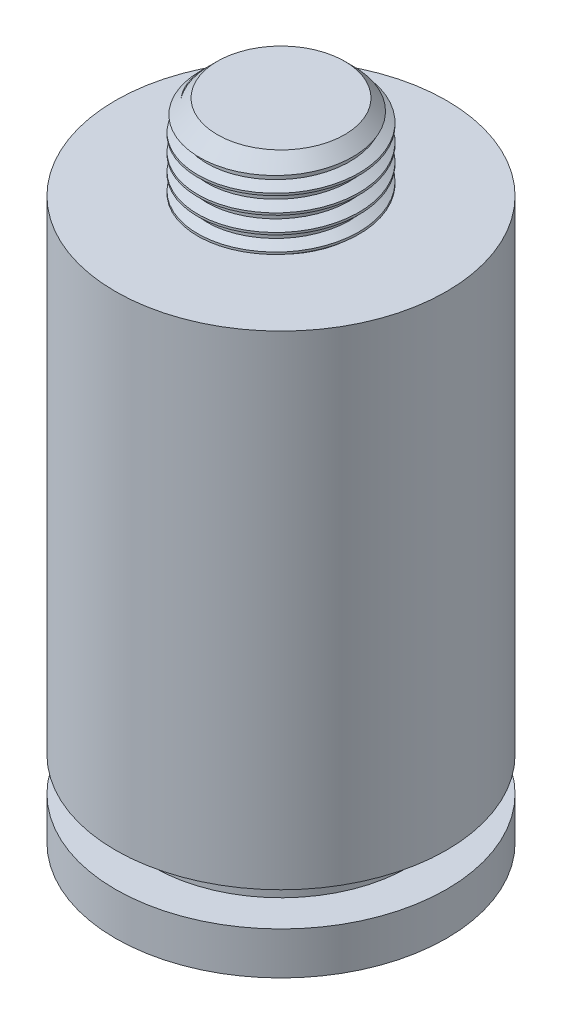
ISO-10303-21;
HEADER;
FILE_DESCRIPTION(('STEP AP214'),'2;1');
FILE_NAME('part.step','',(''),(''),'','','');
FILE_SCHEMA(('AUTOMOTIVE_DESIGN { 1 0 10303 214 1 1 1 1 }'));
ENDSEC;
DATA;
#1=APPLICATION_CONTEXT('core data for automotive mechanical design processes');
#2=APPLICATION_PROTOCOL_DEFINITION('international standard','automotive_design',2000,#1);
#3=PRODUCT_CONTEXT('',#1,'mechanical');
#4=PRODUCT('Part','Part','',(#3));
#5=PRODUCT_RELATED_PRODUCT_CATEGORY('part','',(#4));
#6=PRODUCT_DEFINITION_FORMATION('','',#4);
#7=PRODUCT_DEFINITION_CONTEXT('part definition',#1,'design');
#8=PRODUCT_DEFINITION('design','',#6,#7);
#9=PRODUCT_DEFINITION_SHAPE('','',#8);
#10=(LENGTH_UNIT() NAMED_UNIT(*) SI_UNIT(.MILLI.,.METRE.));
#11=(NAMED_UNIT(*) PLANE_ANGLE_UNIT() SI_UNIT($,.RADIAN.));
#12=(NAMED_UNIT(*) SI_UNIT($,.STERADIAN.) SOLID_ANGLE_UNIT());
#13=UNCERTAINTY_MEASURE_WITH_UNIT(LENGTH_MEASURE(1.E-05),#10,'distance_accuracy_value','');
#14=(GEOMETRIC_REPRESENTATION_CONTEXT(3) GLOBAL_UNCERTAINTY_ASSIGNED_CONTEXT((#13)) GLOBAL_UNIT_ASSIGNED_CONTEXT((#10,
#11,#12)) REPRESENTATION_CONTEXT('',''));
#15=CARTESIAN_POINT('',(0.,0.,0.));
#16=DIRECTION('',(0.,0.,1.));
#17=DIRECTION('',(1.,0.,0.));
#18=AXIS2_PLACEMENT_3D('',#15,#16,#17);
#19=CARTESIAN_POINT('',(0.,38.,0.));
#20=DIRECTION('',(0.,-1.,0.));
#21=DIRECTION('',(0.,0.,-1.));
#22=AXIS2_PLACEMENT_3D('',#19,#20,#21);
#23=CONICAL_SURFACE('',#22,3.75,0.785398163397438);
#24=CARTESIAN_POINT('',(0.,38.,0.));
#25=DIRECTION('',(0.,1.,0.));
#26=DIRECTION('',(0.,0.,1.));
#27=AXIS2_PLACEMENT_3D('',#24,#25,#26);
#28=CIRCLE('',#27,3.75);
#29=CARTESIAN_POINT('',(0.,38.,3.75));
#30=VERTEX_POINT('',#29);
#31=EDGE_CURVE('E109',#30,#30,#28,.T.);
#32=ORIENTED_EDGE('',*,*,#31,.F.);
#33=EDGE_LOOP('',(#32));
#34=FACE_BOUND('',#33,.T.);
#35=CARTESIAN_POINT('',(-2.54081920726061,37.541265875,-3.35524674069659));
#36=CARTESIAN_POINT('',(-2.60735822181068,37.541265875,-3.30486142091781));
#37=CARTESIAN_POINT('',(-2.67238919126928,37.541265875,-3.25249862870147));
#38=CARTESIAN_POINT('',(-2.79933557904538,37.541265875,-3.14390659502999));
#39=CARTESIAN_POINT('',(-2.86124535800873,37.541265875,-3.08767076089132));
#40=CARTESIAN_POINT('',(-3.0065197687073,37.541265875,-2.94758392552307));
#41=CARTESIAN_POINT('',(-3.0881620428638,37.541265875,-2.8619347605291));
#42=CARTESIAN_POINT('',(-3.24397793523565,37.541265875,-2.68403450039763));
#43=CARTESIAN_POINT('',(-3.31814809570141,37.541265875,-2.59178038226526));
#44=CARTESIAN_POINT('',(-3.45852740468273,37.541265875,-2.40125886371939));
#45=CARTESIAN_POINT('',(-3.52472868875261,37.541265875,-2.30298566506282));
#46=CARTESIAN_POINT('',(-3.6486352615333,37.541265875,-2.10117388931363));
#47=CARTESIAN_POINT('',(-3.70633735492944,37.541265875,-1.99763335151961));
#48=CARTESIAN_POINT('',(-3.81275862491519,37.541265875,-1.78614351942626));
#49=CARTESIAN_POINT('',(-3.86148588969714,37.541265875,-1.67819830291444));
#50=CARTESIAN_POINT('',(-3.94968699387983,37.541265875,-1.4585755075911));
#51=CARTESIAN_POINT('',(-3.98915736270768,37.541265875,-1.34689654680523));
#52=CARTESIAN_POINT('',(-4.09316182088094,37.541265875,-1.00761757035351));
#53=CARTESIAN_POINT('',(-4.14344067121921,37.541265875,-0.775473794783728));
#54=CARTESIAN_POINT('',(-4.20425932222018,37.541265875,-0.306042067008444));
#55=CARTESIAN_POINT('',(-4.21479984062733,37.541265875,-0.0687542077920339));
#56=CARTESIAN_POINT('',(-4.20069175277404,37.541265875,0.285825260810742));
#57=CARTESIAN_POINT('',(-4.19098474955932,37.541265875,0.403877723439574));
#58=CARTESIAN_POINT('',(-4.16166389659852,37.541265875,0.638730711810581));
#59=CARTESIAN_POINT('',(-4.14205375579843,37.541265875,0.755531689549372));
#60=CARTESIAN_POINT('',(-4.09303931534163,37.541265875,0.987171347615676));
#61=CARTESIAN_POINT('',(-4.06362547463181,37.541265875,1.10200800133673));
#62=CARTESIAN_POINT('',(-3.99523157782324,37.541265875,1.32875211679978));
#63=CARTESIAN_POINT('',(-3.95625512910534,37.541265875,1.4406606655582));
#64=CARTESIAN_POINT('',(-3.86905912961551,37.541265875,1.66066622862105));
#65=CARTESIAN_POINT('',(-3.82085008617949,37.541265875,1.76876741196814));
#66=CARTESIAN_POINT('',(-3.71552072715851,37.541265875,1.98048407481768));
#67=CARTESIAN_POINT('',(-3.65840486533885,37.541265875,2.08410176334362));
#68=CARTESIAN_POINT('',(-3.55977652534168,37.541265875,2.24646157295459));
#69=CARTESIAN_POINT('',(-3.5209437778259,37.541265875,2.30684815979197));
#70=CARTESIAN_POINT('',(-3.44030807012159,37.541265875,2.42546041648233));
#71=CARTESIAN_POINT('',(-3.39851006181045,37.541265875,2.48368945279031));
#72=CARTESIAN_POINT('',(-3.35524674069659,37.541265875,2.54081920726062));
#73=B_SPLINE_CURVE_WITH_KNOTS('',3,(#35,#36,#37,#38,#39,#40,#41,#42,#43,#44,#45,#46,#47,#48,#49,
#50,#51,#52,#53,#54,#55,#56,#57,#58,#59,#60,#61,#62,#63,#64,#65,#66,#67,#68,#69,#70,#71,#72),
.UNSPECIFIED.,.F.,.F.,(4,2,2,2,2,2,2,2,2,2,2,2,2,2,2,2,2,2,4),(0.,0.250336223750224,
0.501109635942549,0.855649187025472,1.21035205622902,1.56540215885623,1.92058540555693,
2.27544697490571,2.63044137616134,3.33943048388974,4.0484067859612,4.4034076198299,
4.75827559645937,5.11348994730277,5.46857050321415,5.82324932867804,6.17775136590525,
6.39305069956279,6.60799859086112),.UNSPECIFIED.);
#74=CARTESIAN_POINT('',(-2.54081920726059,37.541265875,-3.3552467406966));
#75=VERTEX_POINT('',#74);
#76=CARTESIAN_POINT('',(-3.35524674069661,37.541265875,2.54081920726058));
#77=VERTEX_POINT('',#76);
#78=EDGE_CURVE('E51',#75,#77,#73,.T.);
#79=ORIENTED_EDGE('',*,*,#78,.T.);
#80=CARTESIAN_POINT('',(-3.35524674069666,37.541265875,2.54081920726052));
#81=CARTESIAN_POINT('',(-3.43059396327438,37.5313432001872,2.45777206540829));
#82=CARTESIAN_POINT('',(-3.50266647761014,37.5213543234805,2.37176392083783));
#83=CARTESIAN_POINT('',(-3.63985224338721,37.5013081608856,2.19438080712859));
#84=CARTESIAN_POINT('',(-3.70496587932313,37.4912508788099,2.10300613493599));
#85=CARTESIAN_POINT('',(-3.82774243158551,37.4711455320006,1.91557328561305));
#86=CARTESIAN_POINT('',(-3.88541612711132,37.461097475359,1.81952216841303));
#87=CARTESIAN_POINT('',(-3.99307651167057,37.4410555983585,1.62319848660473));
#88=CARTESIAN_POINT('',(-4.0430631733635,37.4310617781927,1.52292590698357));
#89=CARTESIAN_POINT('',(-4.13506948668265,37.4111807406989,1.31871284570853));
#90=CARTESIAN_POINT('',(-4.17708472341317,37.4012935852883,1.21477036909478));
#91=CARTESIAN_POINT('',(-4.25285944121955,37.3816844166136,1.00390353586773));
#92=CARTESIAN_POINT('',(-4.28661901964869,37.3719624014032,0.896979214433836));
#93=CARTESIAN_POINT('',(-4.34568267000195,37.3527376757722,0.680758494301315));
#94=CARTESIAN_POINT('',(-4.37098333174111,37.3432350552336,0.571461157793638));
#95=CARTESIAN_POINT('',(-4.41298013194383,37.3244775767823,0.351190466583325));
#96=CARTESIAN_POINT('',(-4.42967627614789,37.3152227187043,0.240217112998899));
#97=CARTESIAN_POINT('',(-4.44860556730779,37.3012729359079,0.0686665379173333));
#98=CARTESIAN_POINT('',(-4.45395811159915,37.2964417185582,0.008427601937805));
#99=CARTESIAN_POINT('',(-4.46226233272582,37.2867337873,-0.112216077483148));
#100=CARTESIAN_POINT('',(-4.46521390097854,37.2818570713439,-0.172620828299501));
#101=CARTESIAN_POINT('',(-4.46873252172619,37.2720446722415,-0.293507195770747));
#102=CARTESIAN_POINT('',(-4.46929910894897,37.2671089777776,-0.353988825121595));
#103=CARTESIAN_POINT('',(-4.4680406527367,37.2571944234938,-0.474918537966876));
#104=CARTESIAN_POINT('',(-4.46621567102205,37.252215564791,-0.535366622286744));
#105=CARTESIAN_POINT('',(-4.45716015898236,37.2372297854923,-0.716461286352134));
#106=CARTESIAN_POINT('',(-4.44635158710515,37.2271665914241,-0.836945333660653));
#107=CARTESIAN_POINT('',(-4.41526242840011,37.2069679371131,-1.07661516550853));
#108=CARTESIAN_POINT('',(-4.39498521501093,37.1968325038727,-1.19580139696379));
#109=CARTESIAN_POINT('',(-4.34116934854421,37.1749580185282,-1.45073684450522));
#110=CARTESIAN_POINT('',(-4.30605101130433,37.1632164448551,-1.58615631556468));
#111=CARTESIAN_POINT('',(-4.22362164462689,37.1398187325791,-1.85315267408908));
#112=CARTESIAN_POINT('',(-4.17631621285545,37.1281625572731,-1.98473129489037));
#113=CARTESIAN_POINT('',(-4.05461294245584,37.1016981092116,-2.28011057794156));
#114=CARTESIAN_POINT('',(-3.97633607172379,37.0869443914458,-2.4423319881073));
#115=CARTESIAN_POINT('',(-3.80125820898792,37.0578989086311,-2.75651250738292));
#116=CARTESIAN_POINT('',(-3.70445938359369,37.0436070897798,-2.90847281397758));
#117=CARTESIAN_POINT('',(-3.56122453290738,37.0246085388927,-3.10663455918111));
#118=CARTESIAN_POINT('',(-3.52220232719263,37.0196209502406,-3.15828209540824));
#119=CARTESIAN_POINT('',(-3.44205243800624,37.009740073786,-3.25982963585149));
#120=CARTESIAN_POINT('',(-3.40092721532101,37.0048466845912,-3.30973157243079));
#121=CARTESIAN_POINT('',(-3.35875714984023,37.,-3.35875727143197));
#122=B_SPLINE_CURVE_WITH_KNOTS('',3,(#80,#81,#82,#83,#84,#85,#86,#87,#88,#89,#90,#91,#92,#93,
#94,#95,#96,#97,#98,#99,#100,#101,#102,#103,#104,#105,#106,#107,#108,#109,#110,#111,#112,#113,
#114,#115,#116,#117,#118,#119,#120,#121),.UNSPECIFIED.,.F.,.F.,(4,2,2,2,2,2,2,2,2,2,2,2,2,2,2,2,
2,2,2,2,4),(0.,0.337628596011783,0.675238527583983,1.0123536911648,1.3494700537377,
1.6867725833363,2.02407113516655,2.3615055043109,2.69893964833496,2.88090291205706,
3.06287440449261,3.24488139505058,3.42688368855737,3.79062686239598,4.15424054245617,
4.57480728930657,4.99518120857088,5.53609536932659,6.07694629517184,6.2716731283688,
6.46617710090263),.UNSPECIFIED.);
#123=CARTESIAN_POINT('',(-3.35875714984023,37.,-3.35875727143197));
#124=VERTEX_POINT('',#123);
#125=EDGE_CURVE('E11',#77,#124,#122,.T.);
#126=ORIENTED_EDGE('',*,*,#125,.T.);
#127=CARTESIAN_POINT('',(0.,37.,0.));
#128=DIRECTION('',(0.,1.,0.));
#129=DIRECTION('',(0.,0.,1.));
#130=AXIS2_PLACEMENT_3D('',#127,#128,#129);
#131=CIRCLE('',#130,4.75);
#132=CARTESIAN_POINT('',(-4.75,37.,0.));
#133=VERTEX_POINT('',#132);
#134=EDGE_CURVE('E98',#124,#133,#131,.T.);
#135=ORIENTED_EDGE('',*,*,#134,.T.);
#136=CARTESIAN_POINT('',(-4.75,37.,0.));
#137=CARTESIAN_POINT('',(-4.74773919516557,37.0022599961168,0.112220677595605));
#138=CARTESIAN_POINT('',(-4.74146721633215,37.00455397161,0.224320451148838));
#139=CARTESIAN_POINT('',(-4.72093944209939,37.0092001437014,0.447781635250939));
#140=CARTESIAN_POINT('',(-4.70668390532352,37.0115523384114,0.559143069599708));
#141=CARTESIAN_POINT('',(-4.65205545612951,37.0186745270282,0.891043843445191));
#142=CARTESIAN_POINT('',(-4.59981344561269,37.0235171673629,1.10974938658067));
#143=CARTESIAN_POINT('',(-4.46474455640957,37.0332923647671,1.53744431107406));
#144=CARTESIAN_POINT('',(-4.38191104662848,37.0382249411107,1.74643157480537));
#145=CARTESIAN_POINT('',(-4.18723185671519,37.0480870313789,2.15065863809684));
#146=CARTESIAN_POINT('',(-4.07537197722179,37.0530165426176,2.345891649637));
#147=CARTESIAN_POINT('',(-3.8763808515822,37.0607625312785,2.64200745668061));
#148=CARTESIAN_POINT('',(-3.7978751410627,37.0636178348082,2.74879377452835));
#149=CARTESIAN_POINT('',(-3.63214998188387,37.069274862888,2.95536487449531));
#150=CARTESIAN_POINT('',(-3.54493260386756,37.0720765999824,3.05515131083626));
#151=CARTESIAN_POINT('',(-3.36236568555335,37.0775798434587,3.24708281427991));
#152=CARTESIAN_POINT('',(-3.26701246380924,37.0802813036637,3.33922438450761));
#153=CARTESIAN_POINT('',(-3.06878646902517,37.0857868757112,3.51496667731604));
#154=CARTESIAN_POINT('',(-2.96591421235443,37.088590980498,3.59856798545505));
#155=CARTESIAN_POINT('',(-2.64838670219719,37.0970733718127,3.83469764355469));
#156=CARTESIAN_POINT('',(-2.42356782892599,37.1028582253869,3.97386652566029));
#157=CARTESIAN_POINT('',(-1.95353640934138,37.1145514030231,4.21194085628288));
#158=CARTESIAN_POINT('',(-1.70832390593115,37.1204597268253,4.31084638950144));
#159=CARTESIAN_POINT('',(-1.33225508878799,37.1292451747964,4.42645252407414));
#160=CARTESIAN_POINT('',(-1.2062048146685,37.1321458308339,4.45944049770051));
#161=CARTESIAN_POINT('',(-0.951742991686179,37.1379150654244,4.51469105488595));
#162=CARTESIAN_POINT('',(-0.823331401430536,37.1407836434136,4.536953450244));
#163=CARTESIAN_POINT('',(-0.565089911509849,37.1464655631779,4.57057439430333));
#164=CARTESIAN_POINT('',(-0.435260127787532,37.1492789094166,4.5819338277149));
#165=CARTESIAN_POINT('',(-0.24017515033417,37.1534453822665,4.59073731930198));
#166=CARTESIAN_POINT('',(-0.175083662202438,37.1548254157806,4.59229895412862));
#167=CARTESIAN_POINT('',(-0.0448921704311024,37.1575584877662,4.59268336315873));
#168=CARTESIAN_POINT('',(0.0202078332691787,37.1589115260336,4.59150611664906));
#169=CARTESIAN_POINT('',(0.215318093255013,37.1630084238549,4.5837812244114));
#170=CARTESIAN_POINT('',(0.345191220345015,37.165791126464,4.57304285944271));
#171=CARTESIAN_POINT('',(0.603488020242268,37.1714304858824,4.54049188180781));
#172=CARTESIAN_POINT('',(0.731911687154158,37.1742871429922,4.51867922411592));
#173=CARTESIAN_POINT('',(1.11360047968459,37.1829408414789,4.43682849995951));
#174=CARTESIAN_POINT('',(1.3635440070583,37.1888270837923,4.36036708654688));
#175=CARTESIAN_POINT('',(1.84258137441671,37.2005565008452,4.16747614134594));
#176=CARTESIAN_POINT('',(2.07195526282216,37.2063987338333,4.05174074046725));
#177=CARTESIAN_POINT('',(2.39884449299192,37.2150711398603,3.85065610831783));
#178=CARTESIAN_POINT('',(2.50499207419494,37.2179481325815,3.77900697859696));
#179=CARTESIAN_POINT('',(2.71089957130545,37.2236577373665,3.62700264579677));
#180=CARTESIAN_POINT('',(2.81065927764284,37.226490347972,3.5466471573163));
#181=CARTESIAN_POINT('',(3.00309964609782,37.2320725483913,3.37778726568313));
#182=CARTESIAN_POINT('',(3.09577792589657,37.2348221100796,3.28928014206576));
#183=CARTESIAN_POINT('',(3.2289190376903,37.2389190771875,3.15087836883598));
#184=CARTESIAN_POINT('',(3.27233074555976,37.2402805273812,3.10379104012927));
#185=CARTESIAN_POINT('',(3.35708548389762,37.2430351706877,3.00779110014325));
#186=CARTESIAN_POINT('',(3.39842851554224,37.2444283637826,2.9588784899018));
#187=CARTESIAN_POINT('',(3.51921608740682,37.2486349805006,2.80958601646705));
#188=CARTESIAN_POINT('',(3.59547225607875,37.251477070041,2.70659625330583));
#189=CARTESIAN_POINT('',(3.73885666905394,37.2572240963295,2.49446843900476));
#190=CARTESIAN_POINT('',(3.80598490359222,37.2601290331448,2.38533038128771));
#191=CARTESIAN_POINT('',(3.929826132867,37.2659412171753,2.16314689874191));
#192=CARTESIAN_POINT('',(3.98666287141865,37.2688479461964,2.05017047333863));
#193=CARTESIAN_POINT('',(4.09054627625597,37.2746795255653,1.81985440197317));
#194=CARTESIAN_POINT('',(4.13759656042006,37.2776043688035,1.70251638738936));
#195=CARTESIAN_POINT('',(4.22162115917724,37.2834538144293,1.46421061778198));
#196=CARTESIAN_POINT('',(4.25858966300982,37.286378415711,1.34324081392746));
#197=CARTESIAN_POINT('',(4.3221369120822,37.2922038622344,1.09864894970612));
#198=CARTESIAN_POINT('',(4.3487195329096,37.2951047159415,0.975027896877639));
#199=CARTESIAN_POINT('',(4.39123253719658,37.3008486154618,0.726525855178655));
#200=CARTESIAN_POINT('',(4.40720885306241,37.3036918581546,0.601652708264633));
#201=CARTESIAN_POINT('',(4.42857503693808,37.3093177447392,0.35098645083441));
#202=CARTESIAN_POINT('',(4.43396488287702,37.3121003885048,0.225193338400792));
#203=CARTESIAN_POINT('',(4.43409635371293,37.3161991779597,0.0365401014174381));
#204=CARTESIAN_POINT('',(4.43281455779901,37.3175529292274,-0.0263390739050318));
#205=CARTESIAN_POINT('',(4.42755101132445,37.3202873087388,-0.151979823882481));
#206=CARTESIAN_POINT('',(4.42356944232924,37.321667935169,-0.214741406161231));
#207=CARTESIAN_POINT('',(4.40758723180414,37.3258413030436,-0.402677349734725));
#208=CARTESIAN_POINT('',(4.39154911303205,37.3286661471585,-0.52753163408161));
#209=CARTESIAN_POINT('',(4.3489848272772,37.3343609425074,-0.77445049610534));
#210=CARTESIAN_POINT('',(4.32253863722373,37.3372303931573,-0.89652900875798));
#211=CARTESIAN_POINT('',(4.25933438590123,37.343015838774,-1.13805004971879));
#212=CARTESIAN_POINT('',(4.22257163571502,37.3459318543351,-1.25749135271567));
#213=CARTESIAN_POINT('',(4.13900849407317,37.3517883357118,-1.49280092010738));
#214=CARTESIAN_POINT('',(4.09220858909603,37.3547288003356,-1.60866935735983));
#215=CARTESIAN_POINT('',(3.98891013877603,37.3606129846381,-1.8359989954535));
#216=CARTESIAN_POINT('',(3.93241165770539,37.363556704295,-1.94746022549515));
#217=CARTESIAN_POINT('',(3.81077344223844,37.3693953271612,-2.16401351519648));
#218=CARTESIAN_POINT('',(3.7457313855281,37.3722904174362,-2.26916045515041));
#219=CARTESIAN_POINT('',(3.60701589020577,37.3780407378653,-2.47360375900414));
#220=CARTESIAN_POINT('',(3.53334223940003,37.3808959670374,-2.57289997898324));
#221=CARTESIAN_POINT('',(3.37789989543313,37.3865511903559,-2.76490961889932));
#222=CARTESIAN_POINT('',(3.29613268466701,37.3893511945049,-2.85762423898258));
#223=CARTESIAN_POINT('',(3.1250883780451,37.3948528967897,-3.03584828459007));
#224=CARTESIAN_POINT('',(3.03581155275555,37.3975545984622,-3.12135796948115));
#225=CARTESIAN_POINT('',(2.85037810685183,37.403061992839,-3.28426791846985));
#226=CARTESIAN_POINT('',(2.75423198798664,37.405867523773,-3.36168013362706));
#227=CARTESIAN_POINT('',(2.55566443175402,37.4115453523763,-3.50798646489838));
#228=CARTESIAN_POINT('',(2.45324288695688,37.414417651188,-3.57688043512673));
#229=CARTESIAN_POINT('',(2.24288589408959,37.4202139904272,-3.70563171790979));
#230=CARTESIAN_POINT('',(2.13495105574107,37.4231380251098,-3.76549002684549));
#231=CARTESIAN_POINT('',(1.91431182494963,37.4290166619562,-3.87575978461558));
#232=CARTESIAN_POINT('',(1.80160577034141,37.4319712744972,-3.92616790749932));
#233=CARTESIAN_POINT('',(1.57419595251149,37.4378397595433,-4.01638385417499));
#234=CARTESIAN_POINT('',(1.45955648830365,37.4407534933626,-4.0563538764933));
#235=CARTESIAN_POINT('',(1.22731667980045,37.4465682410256,-4.1264903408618));
#236=CARTESIAN_POINT('',(1.10971637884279,37.4494692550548,-4.15665692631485));
#237=CARTESIAN_POINT('',(0.872397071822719,37.4552377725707,-4.20697192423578));
#238=CARTESIAN_POINT('',(0.752678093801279,37.4581052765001,-4.22712046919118));
#239=CARTESIAN_POINT('',(0.511990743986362,37.4637845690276,-4.25725261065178));
#240=CARTESIAN_POINT('',(0.391022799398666,37.4665963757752,-4.26723957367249));
#241=CARTESIAN_POINT('',(0.20924170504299,37.470759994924,-4.27455224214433));
#242=CARTESIAN_POINT('',(0.148561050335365,37.4721395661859,-4.27571042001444));
#243=CARTESIAN_POINT('',(0.0272160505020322,37.4748736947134,-4.27546988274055));
#244=CARTESIAN_POINT('',(-0.0334482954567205,37.4762282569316,-4.27407167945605));
#245=CARTESIAN_POINT('',(-0.21526816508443,37.4803328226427,-4.26596106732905));
#246=CARTESIAN_POINT('',(-0.33627158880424,37.4831241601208,-4.25533352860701));
#247=CARTESIAN_POINT('',(-0.576920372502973,37.488779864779,-4.22372900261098));
#248=CARTESIAN_POINT('',(-0.696565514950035,37.491644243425,-4.20275038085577));
#249=CARTESIAN_POINT('',(-0.933621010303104,37.4974302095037,-4.15059299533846));
#250=CARTESIAN_POINT('',(-1.05103120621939,37.5003518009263,-4.11941351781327));
#251=CARTESIAN_POINT('',(-1.29113805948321,37.5064428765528,-4.04446158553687));
#252=CARTESIAN_POINT('',(-1.41360161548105,37.5096149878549,-3.99994055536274));
#253=CARTESIAN_POINT('',(-1.653914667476,37.5159731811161,-3.89980625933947));
#254=CARTESIAN_POINT('',(-1.77176380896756,37.5191592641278,-3.8441921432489));
#255=CARTESIAN_POINT('',(-2.00208424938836,37.5255249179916,-3.72220967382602));
#256=CARTESIAN_POINT('',(-2.1145434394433,37.5287044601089,-3.6558184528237));
#257=CARTESIAN_POINT('',(-2.33286614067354,37.5350226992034,-3.51295044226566));
#258=CARTESIAN_POINT('',(-2.43872950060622,37.5381613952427,-3.43647342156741));
#259=CARTESIAN_POINT('',(-2.54081920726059,37.541265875,-3.3552467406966));
#260=B_SPLINE_CURVE_WITH_KNOTS('',3,(#136,#137,#138,#139,#140,#141,#142,#143,#144,#145,#146,
#147,#148,#149,#150,#151,#152,#153,#154,#155,#156,#157,#158,#159,#160,#161,#162,#163,#164,#165,
#166,#167,#168,#169,#170,#171,#172,#173,#174,#175,#176,#177,#178,#179,#180,#181,#182,#183,#184,
#185,#186,#187,#188,#189,#190,#191,#192,#193,#194,#195,#196,#197,#198,#199,#200,#201,#202,#203,
#204,#205,#206,#207,#208,#209,#210,#211,#212,#213,#214,#215,#216,#217,#218,#219,#220,#221,#222,
#223,#224,#225,#226,#227,#228,#229,#230,#231,#232,#233,#234,#235,#236,#237,#238,#239,#240,#241,
#242,#243,#244,#245,#246,#247,#248,#249,#250,#251,#252,#253,#254,#255,#256,#257,#258,#259),
.UNSPECIFIED.,.F.,.F.,(4,2,2,2,2,2,2,2,2,2,2,2,2,2,2,2,2,2,2,2,2,2,2,2,2,2,2,2,2,2,2,2,2,2,2,2,
2,2,2,2,2,2,2,2,2,2,2,2,2,2,2,2,2,2,2,2,2,2,2,2,2,4),(0.,0.336648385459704,0.673285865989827,
1.34552078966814,2.01790151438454,2.69061178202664,3.08790654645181,3.4851071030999,
3.88248835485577,4.27984234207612,5.06917232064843,5.85850063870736,6.24909623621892,
6.63969868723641,7.03026944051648,7.22559340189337,7.42091884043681,7.81141216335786,
8.2019070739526,8.98212448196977,9.74921431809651,10.1331249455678,10.5170481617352,
10.9010999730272,11.093227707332,11.285355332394,11.6693812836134,12.053407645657,
12.4324553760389,12.8113627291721,13.1904880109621,13.5694716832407,13.9468032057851,
14.3241355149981,14.5128066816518,14.7014651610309,15.0786962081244,15.453083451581,
15.8276411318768,16.2021806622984,16.5767177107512,16.9472948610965,17.3178811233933,
17.6883996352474,18.0589048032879,18.4288551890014,18.7988119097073,19.1687278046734,
19.5387736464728,19.9026715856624,20.2665642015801,20.6304520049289,20.99421921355,
21.1762949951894,21.358334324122,21.7223499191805,22.0864230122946,22.4505215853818,
22.8409934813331,23.2314953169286,23.6228368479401,24.0141873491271),.UNSPECIFIED.);
#261=EDGE_CURVE('E127',#133,#75,#260,.T.);
#262=ORIENTED_EDGE('',*,*,#261,.T.);
#263=EDGE_LOOP('',(#79,#126,#135,#262));
#264=FACE_BOUND('',#263,.T.);
#265=ADVANCED_FACE('F37',(#34,#264),#23,.T.);
#266=CARTESIAN_POINT('',(0.,0.,0.));
#267=DIRECTION('',(0.,-1.,0.));
#268=DIRECTION('',(0.,0.,-1.));
#269=AXIS2_PLACEMENT_3D('',#266,#267,#268);
#270=PLANE('',#269);
#271=CARTESIAN_POINT('',(0.,0.,0.));
#272=DIRECTION('',(0.,1.,0.));
#273=DIRECTION('',(0.,0.,1.));
#274=AXIS2_PLACEMENT_3D('',#271,#272,#273);
#275=CIRCLE('',#274,9.74999999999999);
#276=CARTESIAN_POINT('',(0.,0.,9.74999999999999));
#277=VERTEX_POINT('',#276);
#278=EDGE_CURVE('E124',#277,#277,#275,.T.);
#279=ORIENTED_EDGE('',*,*,#278,.F.);
#280=EDGE_LOOP('',(#279));
#281=FACE_BOUND('',#280,.T.);
#282=ADVANCED_FACE('F39',(#281),#270,.T.);
#283=CARTESIAN_POINT('',(0.,41.1629665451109,0.));
#284=DIRECTION('',(0.,1.,0.));
#285=DIRECTION('',(0.,0.,1.));
#286=AXIS2_PLACEMENT_3D('',#283,#284,#285);
#287=CYLINDRICAL_SURFACE('',#286,9.74999999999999);
#288=ORIENTED_EDGE('',*,*,#278,.T.);
#289=EDGE_LOOP('',(#288));
#290=FACE_BOUND('',#289,.T.);
#291=CARTESIAN_POINT('',(0.,2.5,0.));
#292=DIRECTION('',(0.,1.,0.));
#293=DIRECTION('',(0.,0.,1.));
#294=AXIS2_PLACEMENT_3D('',#291,#292,#293);
#295=CIRCLE('',#294,9.75);
#296=CARTESIAN_POINT('',(0.,2.5,9.75));
#297=VERTEX_POINT('',#296);
#298=EDGE_CURVE('E121',#297,#297,#295,.T.);
#299=ORIENTED_EDGE('',*,*,#298,.F.);
#300=EDGE_LOOP('',(#299));
#301=FACE_BOUND('',#300,.T.);
#302=ADVANCED_FACE('F207',(#290,#301),#287,.T.);
#303=CARTESIAN_POINT('',(-9.75,2.5,0.));
#304=DIRECTION('',(0.,1.,0.));
#305=DIRECTION('',(0.,0.,1.));
#306=AXIS2_PLACEMENT_3D('',#303,#304,#305);
#307=PLANE('',#306);
#308=ORIENTED_EDGE('',*,*,#298,.T.);
#309=EDGE_LOOP('',(#308));
#310=FACE_BOUND('',#309,.T.);
#311=CARTESIAN_POINT('',(0.,2.5,0.));
#312=DIRECTION('',(0.,1.,0.));
#313=DIRECTION('',(0.,0.,1.));
#314=AXIS2_PLACEMENT_3D('',#311,#312,#313);
#315=CIRCLE('',#314,7.49999999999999);
#316=CARTESIAN_POINT('',(0.,2.5,7.49999999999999));
#317=VERTEX_POINT('',#316);
#318=EDGE_CURVE('E118',#317,#317,#315,.T.);
#319=ORIENTED_EDGE('',*,*,#318,.F.);
#320=EDGE_LOOP('',(#319));
#321=FACE_BOUND('',#320,.T.);
#322=ADVANCED_FACE('F236',(#310,#321),#307,.T.);
#323=CARTESIAN_POINT('',(0.,41.1629665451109,0.));
#324=DIRECTION('',(0.,1.,0.));
#325=DIRECTION('',(0.,0.,1.));
#326=AXIS2_PLACEMENT_3D('',#323,#324,#325);
#327=CYLINDRICAL_SURFACE('',#326,7.49999999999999);
#328=ORIENTED_EDGE('',*,*,#318,.T.);
#329=EDGE_LOOP('',(#328));
#330=FACE_BOUND('',#329,.T.);
#331=CARTESIAN_POINT('',(0.,4.5,0.));
#332=DIRECTION('',(0.,1.,0.));
#333=DIRECTION('',(0.,0.,1.));
#334=AXIS2_PLACEMENT_3D('',#331,#332,#333);
#335=CIRCLE('',#334,7.5);
#336=CARTESIAN_POINT('',(0.,4.5,7.5));
#337=VERTEX_POINT('',#336);
#338=EDGE_CURVE('E115',#337,#337,#335,.T.);
#339=ORIENTED_EDGE('',*,*,#338,.F.);
#340=EDGE_LOOP('',(#339));
#341=FACE_BOUND('',#340,.T.);
#342=ADVANCED_FACE('F244',(#330,#341),#327,.T.);
#343=CARTESIAN_POINT('',(-9.75,4.5,0.));
#344=DIRECTION('',(0.,-1.,0.));
#345=DIRECTION('',(0.,0.,-1.));
#346=AXIS2_PLACEMENT_3D('',#343,#344,#345);
#347=PLANE('',#346);
#348=ORIENTED_EDGE('',*,*,#338,.T.);
#349=EDGE_LOOP('',(#348));
#350=FACE_BOUND('',#349,.T.);
#351=CARTESIAN_POINT('',(0.,4.5,0.));
#352=DIRECTION('',(0.,1.,0.));
#353=DIRECTION('',(0.,0.,1.));
#354=AXIS2_PLACEMENT_3D('',#351,#352,#353);
#355=CIRCLE('',#354,9.75);
#356=CARTESIAN_POINT('',(0.,4.5,9.75));
#357=VERTEX_POINT('',#356);
#358=EDGE_CURVE('E107',#357,#357,#355,.T.);
#359=ORIENTED_EDGE('',*,*,#358,.F.);
#360=EDGE_LOOP('',(#359));
#361=FACE_BOUND('',#360,.T.);
#362=ADVANCED_FACE('F250',(#350,#361),#347,.T.);
#363=CARTESIAN_POINT('',(0.,41.1629665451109,0.));
#364=DIRECTION('',(0.,1.,0.));
#365=DIRECTION('',(0.,0.,1.));
#366=AXIS2_PLACEMENT_3D('',#363,#364,#365);
#367=CYLINDRICAL_SURFACE('',#366,9.75);
#368=ORIENTED_EDGE('',*,*,#358,.T.);
#369=EDGE_LOOP('',(#368));
#370=FACE_BOUND('',#369,.T.);
#371=CARTESIAN_POINT('',(0.,33.,0.));
#372=DIRECTION('',(0.,1.,0.));
#373=DIRECTION('',(0.,0.,1.));
#374=AXIS2_PLACEMENT_3D('',#371,#372,#373);
#375=CIRCLE('',#374,9.75);
#376=CARTESIAN_POINT('',(0.,33.,9.75));
#377=VERTEX_POINT('',#376);
#378=EDGE_CURVE('E104',#377,#377,#375,.T.);
#379=ORIENTED_EDGE('',*,*,#378,.F.);
#380=EDGE_LOOP('',(#379));
#381=FACE_BOUND('',#380,.T.);
#382=ADVANCED_FACE('F176',(#370,#381),#367,.T.);
#383=CARTESIAN_POINT('',(-9.75,33.,0.));
#384=DIRECTION('',(0.,1.,0.));
#385=DIRECTION('',(0.,0.,1.));
#386=AXIS2_PLACEMENT_3D('',#383,#384,#385);
#387=PLANE('',#386);
#388=ORIENTED_EDGE('',*,*,#378,.T.);
#389=EDGE_LOOP('',(#388));
#390=FACE_BOUND('',#389,.T.);
#391=CARTESIAN_POINT('',(0.,33.,0.));
#392=DIRECTION('',(0.,1.,0.));
#393=DIRECTION('',(0.,0.,1.));
#394=AXIS2_PLACEMENT_3D('',#391,#392,#393);
#395=CIRCLE('',#394,4.75);
#396=CARTESIAN_POINT('',(-3.35875714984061,33.,-3.35875727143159));
#397=VERTEX_POINT('',#396);
#398=CARTESIAN_POINT('',(-4.75,33.,0.));
#399=VERTEX_POINT('',#398);
#400=EDGE_CURVE('E96',#397,#399,#395,.T.);
#401=ORIENTED_EDGE('',*,*,#400,.F.);
#402=CARTESIAN_POINT('',(-3.35875714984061,33.,-3.35875727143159));
#403=CARTESIAN_POINT('',(-3.27510294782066,33.,-3.43369561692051));
#404=CARTESIAN_POINT('',(-3.18871986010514,33.,-3.50558253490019));
#405=CARTESIAN_POINT('',(-3.01096941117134,33.,-3.64289852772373));
#406=CARTESIAN_POINT('',(-2.91960221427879,33.,-3.70832781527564));
#407=CARTESIAN_POINT('',(-2.73246506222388,33.,-3.83230329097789));
#408=CARTESIAN_POINT('',(-2.63670058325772,33.,-3.89085773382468));
#409=CARTESIAN_POINT('',(-2.44119677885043,33.,-4.00085972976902));
#410=CARTESIAN_POINT('',(-2.34145745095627,33.,-4.05230727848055));
#411=CARTESIAN_POINT('',(-2.03699523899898,33.,-4.19558839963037));
#412=CARTESIAN_POINT('',(-1.82695737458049,33.,-4.27640725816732));
#413=CARTESIAN_POINT('',(-1.39725083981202,33.,-4.40678910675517));
#414=CARTESIAN_POINT('',(-1.17757559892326,33.,-4.45633040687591));
#415=CARTESIAN_POINT('',(-0.826722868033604,33.,-4.50907805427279));
#416=CARTESIAN_POINT('',(-0.697070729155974,33.,-4.52300320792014));
#417=CARTESIAN_POINT('',(-0.437015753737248,33.,-4.5398791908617));
#418=CARTESIAN_POINT('',(-0.306612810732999,33.,-4.54282842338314));
#419=CARTESIAN_POINT('',(-0.0460177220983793,33.,-4.53776026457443));
#420=CARTESIAN_POINT('',(0.0841744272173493,33.,-4.52974306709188));
#421=CARTESIAN_POINT('',(0.343326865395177,33.,-4.50217792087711));
#422=CARTESIAN_POINT('',(0.472287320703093,33.,-4.48263155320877));
#423=CARTESIAN_POINT('',(0.725794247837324,33.,-4.43266923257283));
#424=CARTESIAN_POINT('',(0.850378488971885,33.,-4.40244429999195));
#425=CARTESIAN_POINT('',(1.0964621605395,33.,-4.33127850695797));
#426=CARTESIAN_POINT('',(1.21796131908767,33.,-4.29033670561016));
#427=CARTESIAN_POINT('',(1.45695688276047,33.,-4.19804615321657));
#428=CARTESIAN_POINT('',(1.57445279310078,33.,-4.1466961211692));
#429=CARTESIAN_POINT('',(1.80453607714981,33.,-4.03397856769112));
#430=CARTESIAN_POINT('',(1.91712352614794,33.,-3.9726111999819));
#431=CARTESIAN_POINT('',(2.13320515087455,33.,-3.84233284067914));
#432=CARTESIAN_POINT('',(2.23687162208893,33.,-3.77370743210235));
#433=CARTESIAN_POINT('',(2.43805847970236,33.,-3.62796312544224));
#434=CARTESIAN_POINT('',(2.53557844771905,33.,-3.55084365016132));
#435=CARTESIAN_POINT('',(2.72373147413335,33.,-3.38868640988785));
#436=CARTESIAN_POINT('',(2.81436798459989,33.,-3.30365266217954));
#437=CARTESIAN_POINT('',(2.94469997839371,33.,-3.17064289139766));
#438=CARTESIAN_POINT('',(2.98720986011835,33.,-3.12539280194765));
#439=CARTESIAN_POINT('',(3.07026410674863,33.,-3.03312377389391));
#440=CARTESIAN_POINT('',(3.11080851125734,33.,-2.98610487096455));
#441=CARTESIAN_POINT('',(3.23110272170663,33.,-2.84014330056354));
#442=CARTESIAN_POINT('',(3.30746370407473,33.,-2.738370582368));
#443=CARTESIAN_POINT('',(3.45065926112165,33.,-2.52834375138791));
#444=CARTESIAN_POINT('',(3.51749308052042,33.,-2.42008912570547));
#445=CARTESIAN_POINT('',(3.64124590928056,33.,-2.19764072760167));
#446=CARTESIAN_POINT('',(3.69813597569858,33.,-2.08343083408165));
#447=CARTESIAN_POINT('',(3.80131605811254,33.,-1.85030743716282));
#448=CARTESIAN_POINT('',(3.8476051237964,33.,-1.73139351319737));
#449=CARTESIAN_POINT('',(3.88836332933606,33.,-1.61061278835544));
#450=B_SPLINE_CURVE_WITH_KNOTS('',3,(#402,#403,#404,#405,#406,#407,#408,#409,#410,#411,#412,
#413,#414,#415,#416,#417,#418,#419,#420,#421,#422,#423,#424,#425,#426,#427,#428,#429,#430,#431,
#432,#433,#434,#435,#436,#437,#438,#439,#440,#441,#442,#443,#444,#445,#446,#447,#448,#449),
.UNSPECIFIED.,.F.,.F.,(4,2,2,2,2,2,2,2,2,2,2,2,2,2,2,2,2,2,2,2,2,2,2,4),(0.,0.336853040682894,
0.673694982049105,1.01012824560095,1.34656171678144,2.01917655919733,2.69225732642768,
3.08303935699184,3.4738782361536,3.86471020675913,4.25548859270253,4.63960380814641,
5.02375275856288,5.40794901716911,5.79213938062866,6.16466591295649,6.53721777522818,
6.909581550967,7.09579170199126,7.28199809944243,7.66312892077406,8.04428994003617,
8.42654255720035,8.80882942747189),.UNSPECIFIED.);
#451=CARTESIAN_POINT('',(3.88836332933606,33.,-1.61061278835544));
#452=VERTEX_POINT('',#451);
#453=EDGE_CURVE('E81',#397,#452,#450,.T.);
#454=ORIENTED_EDGE('',*,*,#453,.T.);
#455=CARTESIAN_POINT('',(3.88836332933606,33.,-1.61061278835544));
#456=CARTESIAN_POINT('',(3.92030519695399,33.,-1.53350352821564));
#457=CARTESIAN_POINT('',(3.94994627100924,33.,-1.45545036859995));
#458=CARTESIAN_POINT('',(4.00458574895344,33.,-1.29758288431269));
#459=CARTESIAN_POINT('',(4.02957595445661,33.,-1.21776572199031));
#460=CARTESIAN_POINT('',(4.0841087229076,33.,-1.02345886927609));
#461=CARTESIAN_POINT('',(4.11125621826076,33.,-0.908288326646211));
#462=CARTESIAN_POINT('',(4.15576977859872,33.,-0.676026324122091));
#463=CARTESIAN_POINT('',(4.17313133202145,33.,-0.558934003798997));
#464=CARTESIAN_POINT('',(4.19794575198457,33.,-0.323585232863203));
#465=CARTESIAN_POINT('',(4.2053889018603,33.,-0.205327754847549));
#466=CARTESIAN_POINT('',(4.21028298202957,33.,0.0314355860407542));
#467=CARTESIAN_POINT('',(4.20773016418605,33.,0.149941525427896));
#468=CARTESIAN_POINT('',(4.19264520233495,33.,0.386216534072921));
#469=CARTESIAN_POINT('',(4.18012209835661,33.,0.503986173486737));
#470=CARTESIAN_POINT('',(4.14520507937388,33.,0.738068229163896));
#471=CARTESIAN_POINT('',(4.12280747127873,33.,0.85438008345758));
#472=CARTESIAN_POINT('',(4.04103982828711,33.,1.19969328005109));
#473=CARTESIAN_POINT('',(3.96707312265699,33.,1.4254090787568));
#474=CARTESIAN_POINT('',(3.78225141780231,33.,1.86119112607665));
#475=CARTESIAN_POINT('',(3.67139708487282,33.,2.07125765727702));
#476=CARTESIAN_POINT('',(3.47998438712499,33.,2.37006665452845));
#477=CARTESIAN_POINT('',(3.41193342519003,33.,2.46701858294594));
#478=CARTESIAN_POINT('',(3.2679164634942,33.,2.65483432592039));
#479=CARTESIAN_POINT('',(3.19195343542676,33.,2.74570040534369));
#480=CARTESIAN_POINT('',(3.03256865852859,33.,2.92078849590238));
#481=CARTESIAN_POINT('',(2.94913970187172,33.,3.00500393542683));
#482=CARTESIAN_POINT('',(2.77550850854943,33.,3.16607170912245));
#483=CARTESIAN_POINT('',(2.68530883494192,33.,3.24292680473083));
#484=CARTESIAN_POINT('',(2.49886102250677,33.,3.38867591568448));
#485=CARTESIAN_POINT('',(2.40261984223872,33.,3.45757883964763));
#486=CARTESIAN_POINT('',(2.20471612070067,33.,3.58700965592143));
#487=CARTESIAN_POINT('',(2.10305630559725,33.,3.64754170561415));
#488=CARTESIAN_POINT('',(1.93588428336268,33.,3.73777347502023));
#489=CARTESIAN_POINT('',(1.87185294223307,33.,3.77024668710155));
#490=CARTESIAN_POINT('',(1.74231982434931,33.,3.8318271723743));
#491=CARTESIAN_POINT('',(1.67682061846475,33.,3.86093985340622));
#492=CARTESIAN_POINT('',(1.6106127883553,33.,3.88836332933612));
#493=B_SPLINE_CURVE_WITH_KNOTS('',3,(#455,#456,#457,#458,#459,#460,#461,#462,#463,#464,#465,
#466,#467,#468,#469,#470,#471,#472,#473,#474,#475,#476,#477,#478,#479,#480,#481,#482,#483,#484,
#485,#486,#487,#488,#489,#490,#491,#492),.UNSPECIFIED.,.F.,.F.,(4,2,2,2,2,2,2,2,2,2,2,2,2,2,2,2,
2,2,4),(0.,0.250336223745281,0.501109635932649,0.85564918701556,1.2103520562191,1.5654021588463,
1.920585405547,2.27544697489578,2.6304413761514,3.3394304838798,4.04840678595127,
4.40340761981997,4.75827559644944,5.11348994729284,5.46857050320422,5.82324932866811,
6.17775136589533,6.39305069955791,6.60799859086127),.UNSPECIFIED.);
#494=CARTESIAN_POINT('',(1.6106127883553,33.,3.88836332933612));
#495=VERTEX_POINT('',#494);
#496=EDGE_CURVE('E89',#452,#495,#493,.T.);
#497=ORIENTED_EDGE('',*,*,#496,.T.);
#498=CARTESIAN_POINT('',(1.6106127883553,33.,3.88836332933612));
#499=CARTESIAN_POINT('',(1.50955624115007,33.,3.93841267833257));
#500=CARTESIAN_POINT('',(1.40652516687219,33.,3.98436092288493));
#501=CARTESIAN_POINT('',(1.1970978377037,33.,4.06783063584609));
#502=CARTESIAN_POINT('',(1.09070140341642,33.,4.10535165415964));
#503=CARTESIAN_POINT('',(0.768081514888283,33.,4.20470633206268));
#504=CARTESIAN_POINT('',(0.547739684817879,33.,4.25367115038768));
#505=CARTESIAN_POINT('',(0.102169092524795,33.,4.31554484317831));
#506=CARTESIAN_POINT('',(-0.12305868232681,33.,4.32846093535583));
#507=CARTESIAN_POINT('',(-0.460298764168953,33.,4.32225290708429));
#508=CARTESIAN_POINT('',(-0.572700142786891,33.,4.31590476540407));
#509=CARTESIAN_POINT('',(-0.79669013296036,33.,4.29464090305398));
#510=CARTESIAN_POINT('',(-0.908278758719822,33.,4.27972533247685));
#511=CARTESIAN_POINT('',(-1.26069308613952,33.,4.21880663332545));
#512=CARTESIAN_POINT('',(-1.49895155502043,33.,4.15687921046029));
#513=CARTESIAN_POINT('',(-1.96180236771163,33.,3.99434209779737));
#514=CARTESIAN_POINT('',(-2.18639885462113,33.,3.89374420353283));
#515=CARTESIAN_POINT('',(-2.50960679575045,33.,3.71541107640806));
#516=CARTESIAN_POINT('',(-2.61570034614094,33.,3.65088719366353));
#517=CARTESIAN_POINT('',(-2.82211984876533,33.,3.51312163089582));
#518=CARTESIAN_POINT('',(-2.9224459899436,33.,3.43988023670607));
#519=CARTESIAN_POINT('',(-3.06804569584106,33.,3.32387825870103));
#520=CARTESIAN_POINT('',(-3.11578385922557,33.,3.2841688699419));
#521=CARTESIAN_POINT('',(-3.2095533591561,33.,3.20278314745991));
#522=CARTESIAN_POINT('',(-3.2555846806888,33.,3.16110679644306));
#523=CARTESIAN_POINT('',(-3.391126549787,33.,3.03336645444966));
#524=CARTESIAN_POINT('',(-3.47809846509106,33.,2.94458037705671));
#525=CARTESIAN_POINT('',(-3.645909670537,33.,2.75887394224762));
#526=CARTESIAN_POINT('',(-3.72663232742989,33.,2.66184841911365));
#527=CARTESIAN_POINT('',(-3.87990194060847,33.,2.46153588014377));
#528=CARTESIAN_POINT('',(-3.95244876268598,33.,2.35824876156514));
#529=CARTESIAN_POINT('',(-4.08878057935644,33.,2.14624641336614));
#530=CARTESIAN_POINT('',(-4.15257748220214,33.,2.0375388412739));
#531=CARTESIAN_POINT('',(-4.27110552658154,33.,1.81528766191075));
#532=CARTESIAN_POINT('',(-4.32583644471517,33.,1.70174393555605));
#533=CARTESIAN_POINT('',(-4.42923497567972,33.,1.46279042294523));
#534=CARTESIAN_POINT('',(-4.47724686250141,33.,1.33709626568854));
#535=CARTESIAN_POINT('',(-4.56213044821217,33.,1.08211649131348));
#536=CARTESIAN_POINT('',(-4.59901103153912,33.,0.952833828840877));
#537=CARTESIAN_POINT('',(-4.66239769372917,33.,0.687388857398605));
#538=CARTESIAN_POINT('',(-4.68853598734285,33.,0.551138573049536));
#539=CARTESIAN_POINT('',(-4.72854177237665,33.,0.276708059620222));
#540=CARTESIAN_POINT('',(-4.74239684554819,33.,0.138526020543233));
#541=CARTESIAN_POINT('',(-4.75,33.,0.));
#542=B_SPLINE_CURVE_WITH_KNOTS('',3,(#498,#499,#500,#501,#502,#503,#504,#505,#506,#507,#508,
#509,#510,#511,#512,#513,#514,#515,#516,#517,#518,#519,#520,#521,#522,#523,#524,#525,#526,#527,
#528,#529,#530,#531,#532,#533,#534,#535,#536,#537,#538,#539,#540,#541),.UNSPECIFIED.,.F.,.F.,(4,
2,2,2,2,2,2,2,2,2,2,2,2,2,2,2,2,2,2,2,2,4),(0.,0.338121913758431,0.67626188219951,
1.35026730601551,2.02413777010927,2.36160495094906,2.69906621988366,3.43395271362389,
4.16861522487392,4.540777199,4.91292697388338,5.09916515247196,5.28540496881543,
5.65783297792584,6.03606239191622,6.41429801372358,6.79201365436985,7.16973860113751,
7.57287806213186,7.97569490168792,8.39133970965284,8.80740425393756),.UNSPECIFIED.);
#543=EDGE_CURVE('E103',#495,#399,#542,.T.);
#544=ORIENTED_EDGE('',*,*,#543,.T.);
#545=EDGE_LOOP('',(#401,#454,#497,#544));
#546=FACE_BOUND('',#545,.T.);
#547=ADVANCED_FACE('F102',(#390,#546),#387,.T.);
#548=CARTESIAN_POINT('',(0.,41.1629665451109,0.));
#549=DIRECTION('',(0.,1.,0.));
#550=DIRECTION('',(0.,0.,1.));
#551=AXIS2_PLACEMENT_3D('',#548,#549,#550);
#552=CYLINDRICAL_SURFACE('',#551,4.75);
#553=CARTESIAN_POINT('',(-4.75,42.,0.));
#554=CARTESIAN_POINT('',(-4.75,41.9375,-1.9675144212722));
#555=CARTESIAN_POINT('',(-3.3587572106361,41.875,-3.3587572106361));
#556=CARTESIAN_POINT('',(-1.9675144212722,41.8125,-4.75));
#557=CARTESIAN_POINT('',(0.,41.75,-4.75));
#558=CARTESIAN_POINT('',(1.9675144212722,41.6875,-4.75));
#559=CARTESIAN_POINT('',(3.3587572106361,41.625,-3.3587572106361));
#560=CARTESIAN_POINT('',(4.75,41.5625,-1.9675144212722));
#561=CARTESIAN_POINT('',(4.75,41.5,0.));
#562=CARTESIAN_POINT('',(4.75,41.4375,1.9675144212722));
#563=CARTESIAN_POINT('',(3.3587572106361,41.375,3.3587572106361));
#564=CARTESIAN_POINT('',(1.9675144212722,41.3125,4.75));
#565=CARTESIAN_POINT('',(0.,41.25,4.75));
#566=CARTESIAN_POINT('',(-1.9675144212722,41.1875,4.75));
#567=CARTESIAN_POINT('',(-3.3587572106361,41.125,3.3587572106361));
#568=CARTESIAN_POINT('',(-4.75,41.0625,1.9675144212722));
#569=CARTESIAN_POINT('',(-4.75,41.,0.));
#570=CARTESIAN_POINT('',(-4.75,40.9375,-1.9675144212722));
#571=CARTESIAN_POINT('',(-3.3587572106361,40.875,-3.3587572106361));
#572=CARTESIAN_POINT('',(-1.9675144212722,40.8125,-4.75));
#573=CARTESIAN_POINT('',(0.,40.75,-4.75));
#574=CARTESIAN_POINT('',(1.9675144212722,40.6875,-4.75));
#575=CARTESIAN_POINT('',(3.3587572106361,40.625,-3.3587572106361));
#576=CARTESIAN_POINT('',(4.75,40.5625,-1.9675144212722));
#577=CARTESIAN_POINT('',(4.75,40.5,0.));
#578=CARTESIAN_POINT('',(4.75,40.4375,1.9675144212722));
#579=CARTESIAN_POINT('',(3.3587572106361,40.375,3.3587572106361));
#580=CARTESIAN_POINT('',(1.9675144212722,40.3125,4.75));
#581=CARTESIAN_POINT('',(0.,40.25,4.75));
#582=CARTESIAN_POINT('',(-1.9675144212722,40.1875,4.75));
#583=CARTESIAN_POINT('',(-3.3587572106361,40.125,3.3587572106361));
#584=CARTESIAN_POINT('',(-4.75,40.0625,1.9675144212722));
#585=CARTESIAN_POINT('',(-4.75,40.,0.));
#586=CARTESIAN_POINT('',(-4.75,39.9375,-1.9675144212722));
#587=CARTESIAN_POINT('',(-3.3587572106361,39.875,-3.3587572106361));
#588=CARTESIAN_POINT('',(-1.9675144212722,39.8125,-4.75));
#589=CARTESIAN_POINT('',(0.,39.75,-4.75));
#590=CARTESIAN_POINT('',(1.9675144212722,39.6875,-4.75));
#591=CARTESIAN_POINT('',(3.3587572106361,39.625,-3.3587572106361));
#592=CARTESIAN_POINT('',(4.75,39.5625,-1.9675144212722));
#593=CARTESIAN_POINT('',(4.75,39.5,0.));
#594=CARTESIAN_POINT('',(4.75,39.4375,1.9675144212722));
#595=CARTESIAN_POINT('',(3.3587572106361,39.375,3.3587572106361));
#596=CARTESIAN_POINT('',(1.9675144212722,39.3125,4.75));
#597=CARTESIAN_POINT('',(0.,39.25,4.75));
#598=CARTESIAN_POINT('',(-1.9675144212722,39.1875,4.75));
#599=CARTESIAN_POINT('',(-3.3587572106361,39.125,3.3587572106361));
#600=CARTESIAN_POINT('',(-4.75,39.0625,1.9675144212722));
#601=CARTESIAN_POINT('',(-4.75,39.,0.));
#602=CARTESIAN_POINT('',(-4.75,38.9375,-1.9675144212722));
#603=CARTESIAN_POINT('',(-3.3587572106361,38.875,-3.3587572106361));
#604=CARTESIAN_POINT('',(-1.9675144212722,38.8125,-4.75));
#605=CARTESIAN_POINT('',(0.,38.75,-4.75));
#606=CARTESIAN_POINT('',(1.9675144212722,38.6875,-4.75));
#607=CARTESIAN_POINT('',(3.3587572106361,38.625,-3.3587572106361));
#608=CARTESIAN_POINT('',(4.75,38.5625,-1.9675144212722));
#609=CARTESIAN_POINT('',(4.75,38.5,0.));
#610=CARTESIAN_POINT('',(4.75,38.4375,1.9675144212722));
#611=CARTESIAN_POINT('',(3.3587572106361,38.375,3.3587572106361));
#612=CARTESIAN_POINT('',(1.9675144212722,38.3125,4.75));
#613=CARTESIAN_POINT('',(0.,38.25,4.75));
#614=CARTESIAN_POINT('',(-1.9675144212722,38.1875,4.75));
#615=CARTESIAN_POINT('',(-3.3587572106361,38.125,3.3587572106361));
#616=CARTESIAN_POINT('',(-4.75,38.0625,1.9675144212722));
#617=CARTESIAN_POINT('',(-4.75,38.,0.));
#618=CARTESIAN_POINT('',(-4.75,37.9375,-1.9675144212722));
#619=CARTESIAN_POINT('',(-3.3587572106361,37.875,-3.3587572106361));
#620=CARTESIAN_POINT('',(-1.9675144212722,37.8125,-4.75));
#621=CARTESIAN_POINT('',(0.,37.75,-4.75));
#622=CARTESIAN_POINT('',(1.9675144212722,37.6875,-4.75));
#623=CARTESIAN_POINT('',(3.3587572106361,37.625,-3.3587572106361));
#624=CARTESIAN_POINT('',(4.75,37.5625,-1.9675144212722));
#625=CARTESIAN_POINT('',(4.75,37.5,0.));
#626=CARTESIAN_POINT('',(4.75,37.4375,1.9675144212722));
#627=CARTESIAN_POINT('',(3.3587572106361,37.375,3.3587572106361));
#628=CARTESIAN_POINT('',(1.9675144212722,37.3125,4.75));
#629=CARTESIAN_POINT('',(0.,37.25,4.75));
#630=CARTESIAN_POINT('',(-1.9675144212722,37.1875,4.75));
#631=CARTESIAN_POINT('',(-3.3587572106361,37.125,3.3587572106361));
#632=CARTESIAN_POINT('',(-4.75,37.0625,1.9675144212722));
#633=CARTESIAN_POINT('',(-4.75,37.,0.));
#634=CARTESIAN_POINT('',(-4.75,36.9375,-1.9675144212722));
#635=CARTESIAN_POINT('',(-3.3587572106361,36.875,-3.3587572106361));
#636=CARTESIAN_POINT('',(-1.9675144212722,36.8125,-4.75));
#637=CARTESIAN_POINT('',(0.,36.75,-4.75));
#638=CARTESIAN_POINT('',(1.9675144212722,36.6875,-4.75));
#639=CARTESIAN_POINT('',(3.3587572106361,36.625,-3.3587572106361));
#640=CARTESIAN_POINT('',(4.75,36.5625,-1.9675144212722));
#641=CARTESIAN_POINT('',(4.75,36.5,0.));
#642=CARTESIAN_POINT('',(4.75,36.4375,1.9675144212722));
#643=CARTESIAN_POINT('',(3.3587572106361,36.375,3.3587572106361));
#644=CARTESIAN_POINT('',(1.9675144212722,36.3125,4.75));
#645=CARTESIAN_POINT('',(0.,36.25,4.75));
#646=CARTESIAN_POINT('',(-1.9675144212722,36.1875,4.75));
#647=CARTESIAN_POINT('',(-3.3587572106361,36.125,3.3587572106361));
#648=CARTESIAN_POINT('',(-4.75,36.0625,1.9675144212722));
#649=CARTESIAN_POINT('',(-4.75,36.,0.));
#650=CARTESIAN_POINT('',(-4.75,35.9375,-1.9675144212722));
#651=CARTESIAN_POINT('',(-3.3587572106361,35.875,-3.3587572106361));
#652=CARTESIAN_POINT('',(-1.9675144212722,35.8125,-4.75));
#653=CARTESIAN_POINT('',(0.,35.75,-4.75));
#654=CARTESIAN_POINT('',(1.9675144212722,35.6875,-4.75));
#655=CARTESIAN_POINT('',(3.3587572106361,35.625,-3.3587572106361));
#656=CARTESIAN_POINT('',(4.75,35.5625,-1.9675144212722));
#657=CARTESIAN_POINT('',(4.75,35.5,0.));
#658=CARTESIAN_POINT('',(4.75,35.4375,1.9675144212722));
#659=CARTESIAN_POINT('',(3.3587572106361,35.375,3.3587572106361));
#660=CARTESIAN_POINT('',(1.9675144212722,35.3125,4.75));
#661=CARTESIAN_POINT('',(0.,35.25,4.75));
#662=CARTESIAN_POINT('',(-1.9675144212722,35.1875,4.75));
#663=CARTESIAN_POINT('',(-3.3587572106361,35.125,3.3587572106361));
#664=CARTESIAN_POINT('',(-4.75,35.0625,1.9675144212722));
#665=CARTESIAN_POINT('',(-4.75,35.,0.));
#666=CARTESIAN_POINT('',(-4.75,34.9375,-1.9675144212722));
#667=CARTESIAN_POINT('',(-3.3587572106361,34.875,-3.3587572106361));
#668=CARTESIAN_POINT('',(-1.9675144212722,34.8125,-4.75));
#669=CARTESIAN_POINT('',(0.,34.75,-4.75));
#670=CARTESIAN_POINT('',(1.9675144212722,34.6875,-4.75));
#671=CARTESIAN_POINT('',(3.3587572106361,34.625,-3.3587572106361));
#672=CARTESIAN_POINT('',(4.75,34.5625,-1.9675144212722));
#673=CARTESIAN_POINT('',(4.75,34.5,0.));
#674=CARTESIAN_POINT('',(4.75,34.4375,1.9675144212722));
#675=CARTESIAN_POINT('',(3.3587572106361,34.375,3.3587572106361));
#676=CARTESIAN_POINT('',(1.9675144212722,34.3125,4.75));
#677=CARTESIAN_POINT('',(0.,34.25,4.75));
#678=CARTESIAN_POINT('',(-1.9675144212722,34.1875,4.75));
#679=CARTESIAN_POINT('',(-3.3587572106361,34.125,3.3587572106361));
#680=CARTESIAN_POINT('',(-4.75,34.0625,1.9675144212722));
#681=CARTESIAN_POINT('',(-4.75,34.,0.));
#682=CARTESIAN_POINT('',(-4.75,33.9375,-1.9675144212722));
#683=CARTESIAN_POINT('',(-3.3587572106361,33.875,-3.3587572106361));
#684=CARTESIAN_POINT('',(-1.9675144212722,33.8125,-4.75));
#685=CARTESIAN_POINT('',(0.,33.75,-4.75));
#686=CARTESIAN_POINT('',(1.9675144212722,33.6875,-4.75));
#687=CARTESIAN_POINT('',(3.3587572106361,33.625,-3.3587572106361));
#688=CARTESIAN_POINT('',(4.75,33.5625,-1.9675144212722));
#689=CARTESIAN_POINT('',(4.75,33.5,0.));
#690=CARTESIAN_POINT('',(4.75,33.4375,1.9675144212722));
#691=CARTESIAN_POINT('',(3.3587572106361,33.375,3.3587572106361));
#692=CARTESIAN_POINT('',(1.9675144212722,33.3125,4.75));
#693=CARTESIAN_POINT('',(0.,33.25,4.75));
#694=CARTESIAN_POINT('',(-1.9675144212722,33.1875,4.75));
#695=CARTESIAN_POINT('',(-3.3587572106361,33.125,3.3587572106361));
#696=CARTESIAN_POINT('',(-4.75,33.0625,1.9675144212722));
#697=CARTESIAN_POINT('',(-4.75,33.,0.));
#698=CARTESIAN_POINT('',(-4.75,32.9375,-1.9675144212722));
#699=CARTESIAN_POINT('',(-3.3587572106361,32.875,-3.3587572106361));
#700=CARTESIAN_POINT('',(-1.9675144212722,32.8125,-4.75));
#701=CARTESIAN_POINT('',(0.,32.75,-4.75));
#702=CARTESIAN_POINT('',(1.9675144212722,32.6875,-4.75));
#703=CARTESIAN_POINT('',(3.3587572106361,32.625,-3.3587572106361));
#704=CARTESIAN_POINT('',(4.75,32.5625,-1.9675144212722));
#705=CARTESIAN_POINT('',(4.75,32.5,0.));
#706=CARTESIAN_POINT('',(4.75,32.4375,1.9675144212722));
#707=CARTESIAN_POINT('',(3.3587572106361,32.375,3.3587572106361));
#708=CARTESIAN_POINT('',(1.9675144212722,32.3125,4.75));
#709=CARTESIAN_POINT('',(0.,32.25,4.75));
#710=CARTESIAN_POINT('',(-1.9675144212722,32.1875,4.75));
#711=CARTESIAN_POINT('',(-3.3587572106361,32.125,3.3587572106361));
#712=CARTESIAN_POINT('',(-4.75,32.0625,1.9675144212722));
#713=CARTESIAN_POINT('',(-4.75,32.,0.));
#714=(BOUNDED_CURVE() B_SPLINE_CURVE(2,(#553,#554,#555,#556,#557,#558,#559,#560,#561,#562,#563,
#564,#565,#566,#567,#568,#569,#570,#571,#572,#573,#574,#575,#576,#577,#578,#579,#580,#581,#582,
#583,#584,#585,#586,#587,#588,#589,#590,#591,#592,#593,#594,#595,#596,#597,#598,#599,#600,#601,
#602,#603,#604,#605,#606,#607,#608,#609,#610,#611,#612,#613,#614,#615,#616,#617,#618,#619,#620,
#621,#622,#623,#624,#625,#626,#627,#628,#629,#630,#631,#632,#633,#634,#635,#636,#637,#638,#639,
#640,#641,#642,#643,#644,#645,#646,#647,#648,#649,#650,#651,#652,#653,#654,#655,#656,#657,#658,
#659,#660,#661,#662,#663,#664,#665,#666,#667,#668,#669,#670,#671,#672,#673,#674,#675,#676,#677,
#678,#679,#680,#681,#682,#683,#684,#685,#686,#687,#688,#689,#690,#691,#692,#693,#694,#695,#696,
#697,#698,#699,#700,#701,#702,#703,#704,#705,#706,#707,#708,#709,#710,#711,#712,#713),
.UNSPECIFIED.,.F.,.F.) B_SPLINE_CURVE_WITH_KNOTS((3,2,2,2,2,2,2,2,2,2,2,2,2,2,2,2,2,2,2,2,2,2,2,
2,2,2,2,2,2,2,2,2,2,2,2,2,2,2,2,2,2,2,2,2,2,2,2,2,2,2,2,2,2,2,2,2,2,2,2,2,2,2,2,2,2,2,2,2,2,2,2,
2,2,2,2,2,2,2,2,2,3),(0.,0.0125,0.025,0.0375,0.05,0.0625,0.075,0.0875,0.1,0.1125,0.125,0.1375,
0.15,0.1625,0.175,0.1875,0.2,0.2125,0.225,0.2375,0.25,0.2625,0.275,0.2875,0.3,0.3125,0.325,
0.3375,0.35,0.3625,0.375,0.3875,0.4,0.4125,0.425,0.4375,0.45,0.4625,0.475,0.4875,0.5,0.5125,
0.525,0.5375,0.55,0.5625,0.575,0.5875,0.6,0.6125,0.625,0.6375,0.65,0.6625,0.675,0.6875,0.7,
0.7125,0.725,0.7375,0.75,0.7625,0.775,0.7875,0.8,0.8125,0.825,0.8375,0.85,0.8625,0.875,0.8875,
0.9,0.9125,0.925,0.9375,0.95,0.9625,0.975,0.9875,1.),
.UNSPECIFIED.) CURVE() GEOMETRIC_REPRESENTATION_ITEM() RATIONAL_B_SPLINE_CURVE((1.,
0.923879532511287,1.,0.923879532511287,1.,0.923879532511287,1.,0.923879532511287,1.,
0.923879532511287,1.,0.923879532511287,1.,0.923879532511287,1.,0.923879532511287,1.,
0.923879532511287,1.,0.923879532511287,1.,0.923879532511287,1.,0.923879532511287,1.,
0.923879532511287,1.,0.923879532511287,1.,0.923879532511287,1.,0.923879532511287,1.,
0.923879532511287,1.,0.923879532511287,1.,0.923879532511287,1.,0.923879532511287,1.,
0.923879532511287,1.,0.923879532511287,1.,0.923879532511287,1.,0.923879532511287,1.,
0.923879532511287,1.,0.923879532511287,1.,0.923879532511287,1.,0.923879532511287,1.,
0.923879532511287,1.,0.923879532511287,1.,0.923879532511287,1.,0.923879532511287,1.,
0.923879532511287,1.,0.923879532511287,1.,0.923879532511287,1.,0.923879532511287,1.,
0.923879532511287,1.,0.923879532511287,1.,0.923879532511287,1.,0.923879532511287,1.,
0.923879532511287,1.,0.923879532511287,1.,0.923879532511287,1.,0.923879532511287,1.,
0.923879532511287,1.,0.923879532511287,1.,0.923879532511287,1.,0.923879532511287,1.,
0.923879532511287,1.,0.923879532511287,1.,0.923879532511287,1.,0.923879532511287,1.,
0.923879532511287,1.,0.923879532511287,1.,0.923879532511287,1.,0.923879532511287,1.,
0.923879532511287,1.,0.923879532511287,1.,0.923879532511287,1.,0.923879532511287,1.,
0.923879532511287,1.,0.923879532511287,1.,0.923879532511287,1.,0.923879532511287,1.,
0.923879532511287,1.,0.923879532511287,1.,0.923879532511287,1.,0.923879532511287,1.,
0.923879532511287,1.,0.923879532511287,1.,0.923879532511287,1.,0.923879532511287,1.,
0.923879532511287,1.,0.923879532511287,1.,0.923879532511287,1.,0.923879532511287,1.,
0.923879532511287,1.,0.923879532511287,1.,0.923879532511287,1.,0.923879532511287,1.)) REPRESENTATION_ITEM(''));
#715=EDGE_CURVE('E99',#133,#399,#714,.T.);
#716=ORIENTED_EDGE('',*,*,#715,.F.);
#717=ORIENTED_EDGE('',*,*,#134,.F.);
#718=CARTESIAN_POINT('',(-4.75,41.1250000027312,0.));
#719=CARTESIAN_POINT('',(-4.75,41.0625000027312,-1.9675144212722));
#720=CARTESIAN_POINT('',(-3.3587572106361,41.0000000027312,-3.3587572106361));
#721=CARTESIAN_POINT('',(-1.9675144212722,40.9375000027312,-4.75));
#722=CARTESIAN_POINT('',(0.,40.8750000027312,-4.75));
#723=CARTESIAN_POINT('',(1.9675144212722,40.8125000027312,-4.75));
#724=CARTESIAN_POINT('',(3.3587572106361,40.7500000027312,-3.3587572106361));
#725=CARTESIAN_POINT('',(4.75,40.6875000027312,-1.9675144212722));
#726=CARTESIAN_POINT('',(4.75,40.6250000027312,0.));
#727=CARTESIAN_POINT('',(4.75,40.5625000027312,1.9675144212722));
#728=CARTESIAN_POINT('',(3.3587572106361,40.5000000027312,3.3587572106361));
#729=CARTESIAN_POINT('',(1.9675144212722,40.4375000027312,4.75));
#730=CARTESIAN_POINT('',(0.,40.3750000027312,4.75));
#731=CARTESIAN_POINT('',(-1.9675144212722,40.3125000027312,4.75));
#732=CARTESIAN_POINT('',(-3.3587572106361,40.2500000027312,3.3587572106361));
#733=CARTESIAN_POINT('',(-4.75,40.1875000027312,1.9675144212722));
#734=CARTESIAN_POINT('',(-4.75,40.1250000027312,0.));
#735=CARTESIAN_POINT('',(-4.75,40.0625000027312,-1.9675144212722));
#736=CARTESIAN_POINT('',(-3.3587572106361,40.0000000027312,-3.3587572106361));
#737=CARTESIAN_POINT('',(-1.9675144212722,39.9375000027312,-4.75));
#738=CARTESIAN_POINT('',(0.,39.8750000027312,-4.75));
#739=CARTESIAN_POINT('',(1.9675144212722,39.8125000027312,-4.75));
#740=CARTESIAN_POINT('',(3.3587572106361,39.7500000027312,-3.3587572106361));
#741=CARTESIAN_POINT('',(4.75,39.6875000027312,-1.9675144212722));
#742=CARTESIAN_POINT('',(4.75,39.6250000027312,0.));
#743=CARTESIAN_POINT('',(4.75,39.5625000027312,1.9675144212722));
#744=CARTESIAN_POINT('',(3.3587572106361,39.5000000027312,3.3587572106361));
#745=CARTESIAN_POINT('',(1.9675144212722,39.4375000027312,4.75));
#746=CARTESIAN_POINT('',(0.,39.3750000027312,4.75));
#747=CARTESIAN_POINT('',(-1.9675144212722,39.3125000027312,4.75));
#748=CARTESIAN_POINT('',(-3.3587572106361,39.2500000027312,3.3587572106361));
#749=CARTESIAN_POINT('',(-4.75,39.1875000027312,1.9675144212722));
#750=CARTESIAN_POINT('',(-4.75,39.1250000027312,0.));
#751=CARTESIAN_POINT('',(-4.75,39.0625000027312,-1.9675144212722));
#752=CARTESIAN_POINT('',(-3.3587572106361,39.0000000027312,-3.3587572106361));
#753=CARTESIAN_POINT('',(-1.9675144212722,38.9375000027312,-4.75));
#754=CARTESIAN_POINT('',(0.,38.8750000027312,-4.75));
#755=CARTESIAN_POINT('',(1.9675144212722,38.8125000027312,-4.75));
#756=CARTESIAN_POINT('',(3.3587572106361,38.7500000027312,-3.3587572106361));
#757=CARTESIAN_POINT('',(4.75,38.6875000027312,-1.9675144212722));
#758=CARTESIAN_POINT('',(4.75,38.6250000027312,0.));
#759=CARTESIAN_POINT('',(4.75,38.5625000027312,1.9675144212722));
#760=CARTESIAN_POINT('',(3.3587572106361,38.5000000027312,3.3587572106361));
#761=CARTESIAN_POINT('',(1.9675144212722,38.4375000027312,4.75));
#762=CARTESIAN_POINT('',(0.,38.3750000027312,4.75));
#763=CARTESIAN_POINT('',(-1.9675144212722,38.3125000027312,4.75));
#764=CARTESIAN_POINT('',(-3.3587572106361,38.2500000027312,3.3587572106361));
#765=CARTESIAN_POINT('',(-4.75,38.1875000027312,1.9675144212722));
#766=CARTESIAN_POINT('',(-4.75,38.1250000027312,0.));
#767=CARTESIAN_POINT('',(-4.75,38.0625000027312,-1.9675144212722));
#768=CARTESIAN_POINT('',(-3.3587572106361,38.0000000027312,-3.3587572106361));
#769=CARTESIAN_POINT('',(-1.9675144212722,37.9375000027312,-4.75));
#770=CARTESIAN_POINT('',(0.,37.8750000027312,-4.75));
#771=CARTESIAN_POINT('',(1.9675144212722,37.8125000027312,-4.75));
#772=CARTESIAN_POINT('',(3.3587572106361,37.7500000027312,-3.3587572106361));
#773=CARTESIAN_POINT('',(4.75,37.6875000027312,-1.9675144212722));
#774=CARTESIAN_POINT('',(4.75,37.6250000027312,0.));
#775=CARTESIAN_POINT('',(4.75,37.5625000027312,1.9675144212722));
#776=CARTESIAN_POINT('',(3.3587572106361,37.5000000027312,3.3587572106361));
#777=CARTESIAN_POINT('',(1.9675144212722,37.4375000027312,4.75));
#778=CARTESIAN_POINT('',(0.,37.3750000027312,4.75));
#779=CARTESIAN_POINT('',(-1.9675144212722,37.3125000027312,4.75));
#780=CARTESIAN_POINT('',(-3.3587572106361,37.2500000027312,3.3587572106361));
#781=CARTESIAN_POINT('',(-4.75,37.1875000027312,1.9675144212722));
#782=CARTESIAN_POINT('',(-4.75,37.1250000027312,0.));
#783=CARTESIAN_POINT('',(-4.75,37.0625000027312,-1.9675144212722));
#784=CARTESIAN_POINT('',(-3.3587572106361,37.0000000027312,-3.3587572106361));
#785=CARTESIAN_POINT('',(-1.9675144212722,36.9375000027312,-4.75));
#786=CARTESIAN_POINT('',(0.,36.8750000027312,-4.75));
#787=CARTESIAN_POINT('',(1.9675144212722,36.8125000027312,-4.75));
#788=CARTESIAN_POINT('',(3.3587572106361,36.7500000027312,-3.3587572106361));
#789=CARTESIAN_POINT('',(4.75,36.6875000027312,-1.9675144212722));
#790=CARTESIAN_POINT('',(4.75,36.6250000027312,0.));
#791=CARTESIAN_POINT('',(4.75,36.5625000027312,1.9675144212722));
#792=CARTESIAN_POINT('',(3.3587572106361,36.5000000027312,3.3587572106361));
#793=CARTESIAN_POINT('',(1.9675144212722,36.4375000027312,4.75));
#794=CARTESIAN_POINT('',(0.,36.3750000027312,4.75));
#795=CARTESIAN_POINT('',(-1.9675144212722,36.3125000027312,4.75));
#796=CARTESIAN_POINT('',(-3.3587572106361,36.2500000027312,3.3587572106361));
#797=CARTESIAN_POINT('',(-4.75,36.1875000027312,1.9675144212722));
#798=CARTESIAN_POINT('',(-4.75,36.1250000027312,0.));
#799=CARTESIAN_POINT('',(-4.75,36.0625000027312,-1.9675144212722));
#800=CARTESIAN_POINT('',(-3.3587572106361,36.0000000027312,-3.3587572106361));
#801=CARTESIAN_POINT('',(-1.9675144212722,35.9375000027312,-4.75));
#802=CARTESIAN_POINT('',(0.,35.8750000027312,-4.75));
#803=CARTESIAN_POINT('',(1.9675144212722,35.8125000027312,-4.75));
#804=CARTESIAN_POINT('',(3.3587572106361,35.7500000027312,-3.3587572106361));
#805=CARTESIAN_POINT('',(4.75,35.6875000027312,-1.9675144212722));
#806=CARTESIAN_POINT('',(4.75,35.6250000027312,0.));
#807=CARTESIAN_POINT('',(4.75,35.5625000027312,1.9675144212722));
#808=CARTESIAN_POINT('',(3.3587572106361,35.5000000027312,3.3587572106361));
#809=CARTESIAN_POINT('',(1.9675144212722,35.4375000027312,4.75));
#810=CARTESIAN_POINT('',(0.,35.3750000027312,4.75));
#811=CARTESIAN_POINT('',(-1.9675144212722,35.3125000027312,4.75));
#812=CARTESIAN_POINT('',(-3.3587572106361,35.2500000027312,3.3587572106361));
#813=CARTESIAN_POINT('',(-4.75,35.1875000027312,1.9675144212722));
#814=CARTESIAN_POINT('',(-4.75,35.1250000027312,0.));
#815=CARTESIAN_POINT('',(-4.75,35.0625000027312,-1.9675144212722));
#816=CARTESIAN_POINT('',(-3.3587572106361,35.0000000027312,-3.3587572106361));
#817=CARTESIAN_POINT('',(-1.9675144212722,34.9375000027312,-4.75));
#818=CARTESIAN_POINT('',(0.,34.8750000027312,-4.75));
#819=CARTESIAN_POINT('',(1.9675144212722,34.8125000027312,-4.75));
#820=CARTESIAN_POINT('',(3.3587572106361,34.7500000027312,-3.3587572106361));
#821=CARTESIAN_POINT('',(4.75,34.6875000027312,-1.9675144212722));
#822=CARTESIAN_POINT('',(4.75,34.6250000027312,0.));
#823=CARTESIAN_POINT('',(4.75,34.5625000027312,1.9675144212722));
#824=CARTESIAN_POINT('',(3.3587572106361,34.5000000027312,3.3587572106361));
#825=CARTESIAN_POINT('',(1.9675144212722,34.4375000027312,4.75));
#826=CARTESIAN_POINT('',(0.,34.3750000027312,4.75));
#827=CARTESIAN_POINT('',(-1.9675144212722,34.3125000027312,4.75));
#828=CARTESIAN_POINT('',(-3.3587572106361,34.2500000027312,3.3587572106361));
#829=CARTESIAN_POINT('',(-4.75,34.1875000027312,1.9675144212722));
#830=CARTESIAN_POINT('',(-4.75,34.1250000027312,0.));
#831=CARTESIAN_POINT('',(-4.75,34.0625000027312,-1.9675144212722));
#832=CARTESIAN_POINT('',(-3.3587572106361,34.0000000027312,-3.3587572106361));
#833=CARTESIAN_POINT('',(-1.9675144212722,33.9375000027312,-4.75));
#834=CARTESIAN_POINT('',(0.,33.8750000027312,-4.75));
#835=CARTESIAN_POINT('',(1.9675144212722,33.8125000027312,-4.75));
#836=CARTESIAN_POINT('',(3.3587572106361,33.7500000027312,-3.3587572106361));
#837=CARTESIAN_POINT('',(4.75,33.6875000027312,-1.9675144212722));
#838=CARTESIAN_POINT('',(4.75,33.6250000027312,0.));
#839=CARTESIAN_POINT('',(4.75,33.5625000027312,1.9675144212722));
#840=CARTESIAN_POINT('',(3.3587572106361,33.5000000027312,3.3587572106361));
#841=CARTESIAN_POINT('',(1.9675144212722,33.4375000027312,4.75));
#842=CARTESIAN_POINT('',(0.,33.3750000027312,4.75));
#843=CARTESIAN_POINT('',(-1.9675144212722,33.3125000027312,4.75));
#844=CARTESIAN_POINT('',(-3.3587572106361,33.2500000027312,3.3587572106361));
#845=CARTESIAN_POINT('',(-4.75,33.1875000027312,1.9675144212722));
#846=CARTESIAN_POINT('',(-4.75,33.1250000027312,0.));
#847=CARTESIAN_POINT('',(-4.75,33.0625000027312,-1.9675144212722));
#848=CARTESIAN_POINT('',(-3.3587572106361,33.0000000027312,-3.3587572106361));
#849=CARTESIAN_POINT('',(-1.9675144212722,32.9375000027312,-4.75));
#850=CARTESIAN_POINT('',(0.,32.8750000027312,-4.75));
#851=CARTESIAN_POINT('',(1.9675144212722,32.8125000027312,-4.75));
#852=CARTESIAN_POINT('',(3.3587572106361,32.7500000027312,-3.3587572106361));
#853=CARTESIAN_POINT('',(4.75,32.6875000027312,-1.9675144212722));
#854=CARTESIAN_POINT('',(4.75,32.6250000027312,0.));
#855=CARTESIAN_POINT('',(4.75,32.5625000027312,1.9675144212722));
#856=CARTESIAN_POINT('',(3.3587572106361,32.5000000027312,3.3587572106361));
#857=CARTESIAN_POINT('',(1.9675144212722,32.4375000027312,4.75));
#858=CARTESIAN_POINT('',(0.,32.3750000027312,4.75));
#859=CARTESIAN_POINT('',(-1.9675144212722,32.3125000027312,4.75));
#860=CARTESIAN_POINT('',(-3.3587572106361,32.2500000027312,3.3587572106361));
#861=CARTESIAN_POINT('',(-4.75,32.1875000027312,1.9675144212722));
#862=CARTESIAN_POINT('',(-4.75,32.1250000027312,0.));
#863=CARTESIAN_POINT('',(-4.75,32.0625000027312,-1.9675144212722));
#864=CARTESIAN_POINT('',(-3.3587572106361,32.0000000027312,-3.3587572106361));
#865=CARTESIAN_POINT('',(-1.9675144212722,31.9375000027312,-4.75));
#866=CARTESIAN_POINT('',(0.,31.8750000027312,-4.75));
#867=CARTESIAN_POINT('',(1.9675144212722,31.8125000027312,-4.75));
#868=CARTESIAN_POINT('',(3.3587572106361,31.7500000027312,-3.3587572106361));
#869=CARTESIAN_POINT('',(4.75,31.6875000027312,-1.9675144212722));
#870=CARTESIAN_POINT('',(4.75,31.6250000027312,0.));
#871=CARTESIAN_POINT('',(4.75,31.5625000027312,1.9675144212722));
#872=CARTESIAN_POINT('',(3.3587572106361,31.5000000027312,3.3587572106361));
#873=CARTESIAN_POINT('',(1.9675144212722,31.4375000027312,4.75));
#874=CARTESIAN_POINT('',(0.,31.3750000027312,4.75));
#875=CARTESIAN_POINT('',(-1.9675144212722,31.3125000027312,4.75));
#876=CARTESIAN_POINT('',(-3.3587572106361,31.2500000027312,3.3587572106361));
#877=CARTESIAN_POINT('',(-4.75,31.1875000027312,1.9675144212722));
#878=CARTESIAN_POINT('',(-4.75,31.1250000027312,0.));
#879=(BOUNDED_CURVE() B_SPLINE_CURVE(2,(#718,#719,#720,#721,#722,#723,#724,#725,#726,#727,#728,
#729,#730,#731,#732,#733,#734,#735,#736,#737,#738,#739,#740,#741,#742,#743,#744,#745,#746,#747,
#748,#749,#750,#751,#752,#753,#754,#755,#756,#757,#758,#759,#760,#761,#762,#763,#764,#765,#766,
#767,#768,#769,#770,#771,#772,#773,#774,#775,#776,#777,#778,#779,#780,#781,#782,#783,#784,#785,
#786,#787,#788,#789,#790,#791,#792,#793,#794,#795,#796,#797,#798,#799,#800,#801,#802,#803,#804,
#805,#806,#807,#808,#809,#810,#811,#812,#813,#814,#815,#816,#817,#818,#819,#820,#821,#822,#823,
#824,#825,#826,#827,#828,#829,#830,#831,#832,#833,#834,#835,#836,#837,#838,#839,#840,#841,#842,
#843,#844,#845,#846,#847,#848,#849,#850,#851,#852,#853,#854,#855,#856,#857,#858,#859,#860,#861,
#862,#863,#864,#865,#866,#867,#868,#869,#870,#871,#872,#873,#874,#875,#876,#877,#878),
.UNSPECIFIED.,.F.,.F.) B_SPLINE_CURVE_WITH_KNOTS((3,2,2,2,2,2,2,2,2,2,2,2,2,2,2,2,2,2,2,2,2,2,2,
2,2,2,2,2,2,2,2,2,2,2,2,2,2,2,2,2,2,2,2,2,2,2,2,2,2,2,2,2,2,2,2,2,2,2,2,2,2,2,2,2,2,2,2,2,2,2,2,
2,2,2,2,2,2,2,2,2,3),(0.,0.0125,0.025,0.0375,0.05,0.0625,0.075,0.0875,0.1,0.1125,0.125,0.1375,
0.15,0.1625,0.175,0.1875,0.2,0.2125,0.225,0.2375,0.25,0.2625,0.275,0.2875,0.3,0.3125,0.325,
0.3375,0.35,0.3625,0.375,0.3875,0.4,0.4125,0.425,0.4375,0.45,0.4625,0.475,0.4875,0.5,0.5125,
0.525,0.5375,0.55,0.5625,0.575,0.5875,0.6,0.6125,0.625,0.6375,0.65,0.6625,0.675,0.6875,0.7,
0.7125,0.725,0.7375,0.75,0.7625,0.775,0.7875,0.8,0.8125,0.825,0.8375,0.85,0.8625,0.875,0.8875,
0.9,0.9125,0.925,0.9375,0.95,0.9625,0.975,0.9875,1.),
.UNSPECIFIED.) CURVE() GEOMETRIC_REPRESENTATION_ITEM() RATIONAL_B_SPLINE_CURVE((1.,
0.923879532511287,1.,0.923879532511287,1.,0.923879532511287,1.,0.923879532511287,1.,
0.923879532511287,1.,0.923879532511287,1.,0.923879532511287,1.,0.923879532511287,1.,
0.923879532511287,1.,0.923879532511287,1.,0.923879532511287,1.,0.923879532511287,1.,
0.923879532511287,1.,0.923879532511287,1.,0.923879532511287,1.,0.923879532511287,1.,
0.923879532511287,1.,0.923879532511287,1.,0.923879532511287,1.,0.923879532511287,1.,
0.923879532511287,1.,0.923879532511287,1.,0.923879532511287,1.,0.923879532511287,1.,
0.923879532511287,1.,0.923879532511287,1.,0.923879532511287,1.,0.923879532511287,1.,
0.923879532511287,1.,0.923879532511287,1.,0.923879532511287,1.,0.923879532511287,1.,
0.923879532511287,1.,0.923879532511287,1.,0.923879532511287,1.,0.923879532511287,1.,
0.923879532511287,1.,0.923879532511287,1.,0.923879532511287,1.,0.923879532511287,1.,
0.923879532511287,1.,0.923879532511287,1.,0.923879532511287,1.,0.923879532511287,1.,
0.923879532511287,1.,0.923879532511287,1.,0.923879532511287,1.,0.923879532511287,1.,
0.923879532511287,1.,0.923879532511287,1.,0.923879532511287,1.,0.923879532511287,1.,
0.923879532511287,1.,0.923879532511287,1.,0.923879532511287,1.,0.923879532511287,1.,
0.923879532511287,1.,0.923879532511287,1.,0.923879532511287,1.,0.923879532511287,1.,
0.923879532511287,1.,0.923879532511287,1.,0.923879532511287,1.,0.923879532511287,1.,
0.923879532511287,1.,0.923879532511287,1.,0.923879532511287,1.,0.923879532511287,1.,
0.923879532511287,1.,0.923879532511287,1.,0.923879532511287,1.,0.923879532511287,1.,
0.923879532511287,1.,0.923879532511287,1.,0.923879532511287,1.,0.923879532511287,1.,
0.923879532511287,1.,0.923879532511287,1.,0.923879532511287,1.,0.923879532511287,1.)) REPRESENTATION_ITEM(''));
#880=EDGE_CURVE('E66',#124,#397,#879,.T.);
#881=ORIENTED_EDGE('',*,*,#880,.T.);
#882=ORIENTED_EDGE('',*,*,#400,.T.);
#883=EDGE_LOOP('',(#716,#717,#881,#882));
#884=FACE_BOUND('',#883,.T.);
#885=ADVANCED_FACE('F95',(#884),#552,.T.);
#886=CARTESIAN_POINT('',(0.,38.,0.));
#887=DIRECTION('',(0.,1.,0.));
#888=DIRECTION('',(0.,0.,1.));
#889=AXIS2_PLACEMENT_3D('',#886,#887,#888);
#890=PLANE('',#889);
#891=ORIENTED_EDGE('',*,*,#31,.T.);
#892=EDGE_LOOP('',(#891));
#893=FACE_BOUND('',#892,.T.);
#894=ADVANCED_FACE('F151',(#893),#890,.T.);
#895=CARTESIAN_POINT('',(-4.75,41.1250000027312,0.));
#896=CARTESIAN_POINT('',(-4.75,41.0625000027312,-1.9675144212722));
#897=CARTESIAN_POINT('',(-3.3587572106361,41.0000000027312,-3.3587572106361));
#898=CARTESIAN_POINT('',(-1.9675144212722,40.9375000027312,-4.75));
#899=CARTESIAN_POINT('',(0.,40.8750000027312,-4.75));
#900=CARTESIAN_POINT('',(1.9675144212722,40.8125000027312,-4.75));
#901=CARTESIAN_POINT('',(3.3587572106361,40.7500000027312,-3.3587572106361));
#902=CARTESIAN_POINT('',(4.75,40.6875000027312,-1.9675144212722));
#903=CARTESIAN_POINT('',(4.75,40.6250000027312,0.));
#904=CARTESIAN_POINT('',(4.75,40.5625000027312,1.9675144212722));
#905=CARTESIAN_POINT('',(3.3587572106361,40.5000000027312,3.3587572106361));
#906=CARTESIAN_POINT('',(1.9675144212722,40.4375000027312,4.75));
#907=CARTESIAN_POINT('',(0.,40.3750000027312,4.75));
#908=CARTESIAN_POINT('',(-1.9675144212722,40.3125000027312,4.75));
#909=CARTESIAN_POINT('',(-3.3587572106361,40.2500000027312,3.3587572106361));
#910=CARTESIAN_POINT('',(-4.75,40.1875000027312,1.9675144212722));
#911=CARTESIAN_POINT('',(-4.75,40.1250000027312,0.));
#912=CARTESIAN_POINT('',(-4.75,40.0625000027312,-1.9675144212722));
#913=CARTESIAN_POINT('',(-3.3587572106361,40.0000000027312,-3.3587572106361));
#914=CARTESIAN_POINT('',(-1.9675144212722,39.9375000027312,-4.75));
#915=CARTESIAN_POINT('',(0.,39.8750000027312,-4.75));
#916=CARTESIAN_POINT('',(1.9675144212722,39.8125000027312,-4.75));
#917=CARTESIAN_POINT('',(3.3587572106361,39.7500000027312,-3.3587572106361));
#918=CARTESIAN_POINT('',(4.75,39.6875000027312,-1.9675144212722));
#919=CARTESIAN_POINT('',(4.75,39.6250000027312,0.));
#920=CARTESIAN_POINT('',(4.75,39.5625000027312,1.9675144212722));
#921=CARTESIAN_POINT('',(3.3587572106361,39.5000000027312,3.3587572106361));
#922=CARTESIAN_POINT('',(1.9675144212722,39.4375000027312,4.75));
#923=CARTESIAN_POINT('',(0.,39.3750000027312,4.75));
#924=CARTESIAN_POINT('',(-1.9675144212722,39.3125000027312,4.75));
#925=CARTESIAN_POINT('',(-3.3587572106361,39.2500000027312,3.3587572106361));
#926=CARTESIAN_POINT('',(-4.75,39.1875000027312,1.9675144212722));
#927=CARTESIAN_POINT('',(-4.75,39.1250000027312,0.));
#928=CARTESIAN_POINT('',(-4.75,39.0625000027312,-1.9675144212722));
#929=CARTESIAN_POINT('',(-3.3587572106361,39.0000000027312,-3.3587572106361));
#930=CARTESIAN_POINT('',(-1.9675144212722,38.9375000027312,-4.75));
#931=CARTESIAN_POINT('',(0.,38.8750000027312,-4.75));
#932=CARTESIAN_POINT('',(1.9675144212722,38.8125000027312,-4.75));
#933=CARTESIAN_POINT('',(3.3587572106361,38.7500000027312,-3.3587572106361));
#934=CARTESIAN_POINT('',(4.75,38.6875000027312,-1.9675144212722));
#935=CARTESIAN_POINT('',(4.75,38.6250000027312,0.));
#936=CARTESIAN_POINT('',(4.75,38.5625000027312,1.9675144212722));
#937=CARTESIAN_POINT('',(3.3587572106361,38.5000000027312,3.3587572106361));
#938=CARTESIAN_POINT('',(1.9675144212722,38.4375000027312,4.75));
#939=CARTESIAN_POINT('',(0.,38.3750000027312,4.75));
#940=CARTESIAN_POINT('',(-1.9675144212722,38.3125000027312,4.75));
#941=CARTESIAN_POINT('',(-3.3587572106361,38.2500000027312,3.3587572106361));
#942=CARTESIAN_POINT('',(-4.75,38.1875000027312,1.9675144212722));
#943=CARTESIAN_POINT('',(-4.75,38.1250000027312,0.));
#944=CARTESIAN_POINT('',(-4.75,38.0625000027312,-1.9675144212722));
#945=CARTESIAN_POINT('',(-3.3587572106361,38.0000000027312,-3.3587572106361));
#946=CARTESIAN_POINT('',(-1.9675144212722,37.9375000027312,-4.75));
#947=CARTESIAN_POINT('',(0.,37.8750000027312,-4.75));
#948=CARTESIAN_POINT('',(1.9675144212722,37.8125000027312,-4.75));
#949=CARTESIAN_POINT('',(3.3587572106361,37.7500000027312,-3.3587572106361));
#950=CARTESIAN_POINT('',(4.75,37.6875000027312,-1.9675144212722));
#951=CARTESIAN_POINT('',(4.75,37.6250000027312,0.));
#952=CARTESIAN_POINT('',(4.75,37.5625000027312,1.9675144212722));
#953=CARTESIAN_POINT('',(3.3587572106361,37.5000000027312,3.3587572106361));
#954=CARTESIAN_POINT('',(1.9675144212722,37.4375000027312,4.75));
#955=CARTESIAN_POINT('',(0.,37.3750000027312,4.75));
#956=CARTESIAN_POINT('',(-1.9675144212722,37.3125000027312,4.75));
#957=CARTESIAN_POINT('',(-3.3587572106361,37.2500000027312,3.3587572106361));
#958=CARTESIAN_POINT('',(-4.75,37.1875000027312,1.9675144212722));
#959=CARTESIAN_POINT('',(-4.75,37.1250000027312,0.));
#960=CARTESIAN_POINT('',(-4.75,37.0625000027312,-1.9675144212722));
#961=CARTESIAN_POINT('',(-3.3587572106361,37.0000000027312,-3.3587572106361));
#962=CARTESIAN_POINT('',(-1.9675144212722,36.9375000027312,-4.75));
#963=CARTESIAN_POINT('',(0.,36.8750000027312,-4.75));
#964=CARTESIAN_POINT('',(1.9675144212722,36.8125000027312,-4.75));
#965=CARTESIAN_POINT('',(3.3587572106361,36.7500000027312,-3.3587572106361));
#966=CARTESIAN_POINT('',(4.75,36.6875000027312,-1.9675144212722));
#967=CARTESIAN_POINT('',(4.75,36.6250000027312,0.));
#968=CARTESIAN_POINT('',(4.75,36.5625000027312,1.9675144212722));
#969=CARTESIAN_POINT('',(3.3587572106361,36.5000000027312,3.3587572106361));
#970=CARTESIAN_POINT('',(1.9675144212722,36.4375000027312,4.75));
#971=CARTESIAN_POINT('',(0.,36.3750000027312,4.75));
#972=CARTESIAN_POINT('',(-1.9675144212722,36.3125000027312,4.75));
#973=CARTESIAN_POINT('',(-3.3587572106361,36.2500000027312,3.3587572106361));
#974=CARTESIAN_POINT('',(-4.75,36.1875000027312,1.9675144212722));
#975=CARTESIAN_POINT('',(-4.75,36.1250000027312,0.));
#976=CARTESIAN_POINT('',(-4.75,36.0625000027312,-1.9675144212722));
#977=CARTESIAN_POINT('',(-3.3587572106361,36.0000000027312,-3.3587572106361));
#978=CARTESIAN_POINT('',(-1.9675144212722,35.9375000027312,-4.75));
#979=CARTESIAN_POINT('',(0.,35.8750000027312,-4.75));
#980=CARTESIAN_POINT('',(1.9675144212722,35.8125000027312,-4.75));
#981=CARTESIAN_POINT('',(3.3587572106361,35.7500000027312,-3.3587572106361));
#982=CARTESIAN_POINT('',(4.75,35.6875000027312,-1.9675144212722));
#983=CARTESIAN_POINT('',(4.75,35.6250000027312,0.));
#984=CARTESIAN_POINT('',(4.75,35.5625000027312,1.9675144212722));
#985=CARTESIAN_POINT('',(3.3587572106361,35.5000000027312,3.3587572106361));
#986=CARTESIAN_POINT('',(1.9675144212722,35.4375000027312,4.75));
#987=CARTESIAN_POINT('',(0.,35.3750000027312,4.75));
#988=CARTESIAN_POINT('',(-1.9675144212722,35.3125000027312,4.75));
#989=CARTESIAN_POINT('',(-3.3587572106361,35.2500000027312,3.3587572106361));
#990=CARTESIAN_POINT('',(-4.75,35.1875000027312,1.9675144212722));
#991=CARTESIAN_POINT('',(-4.75,35.1250000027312,0.));
#992=CARTESIAN_POINT('',(-4.75,35.0625000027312,-1.9675144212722));
#993=CARTESIAN_POINT('',(-3.3587572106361,35.0000000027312,-3.3587572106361));
#994=CARTESIAN_POINT('',(-1.9675144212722,34.9375000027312,-4.75));
#995=CARTESIAN_POINT('',(0.,34.8750000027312,-4.75));
#996=CARTESIAN_POINT('',(1.9675144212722,34.8125000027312,-4.75));
#997=CARTESIAN_POINT('',(3.3587572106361,34.7500000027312,-3.3587572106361));
#998=CARTESIAN_POINT('',(4.75,34.6875000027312,-1.9675144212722));
#999=CARTESIAN_POINT('',(4.75,34.6250000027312,0.));
#1000=CARTESIAN_POINT('',(4.75,34.5625000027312,1.9675144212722));
#1001=CARTESIAN_POINT('',(3.3587572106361,34.5000000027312,3.3587572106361));
#1002=CARTESIAN_POINT('',(1.9675144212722,34.4375000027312,4.75));
#1003=CARTESIAN_POINT('',(0.,34.3750000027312,4.75));
#1004=CARTESIAN_POINT('',(-1.9675144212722,34.3125000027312,4.75));
#1005=CARTESIAN_POINT('',(-3.3587572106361,34.2500000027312,3.3587572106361));
#1006=CARTESIAN_POINT('',(-4.75,34.1875000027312,1.9675144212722));
#1007=CARTESIAN_POINT('',(-4.75,34.1250000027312,0.));
#1008=CARTESIAN_POINT('',(-4.75,34.0625000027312,-1.9675144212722));
#1009=CARTESIAN_POINT('',(-3.3587572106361,34.0000000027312,-3.3587572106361));
#1010=CARTESIAN_POINT('',(-1.9675144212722,33.9375000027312,-4.75));
#1011=CARTESIAN_POINT('',(0.,33.8750000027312,-4.75));
#1012=CARTESIAN_POINT('',(1.9675144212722,33.8125000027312,-4.75));
#1013=CARTESIAN_POINT('',(3.3587572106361,33.7500000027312,-3.3587572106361));
#1014=CARTESIAN_POINT('',(4.75,33.6875000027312,-1.9675144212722));
#1015=CARTESIAN_POINT('',(4.75,33.6250000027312,0.));
#1016=CARTESIAN_POINT('',(4.75,33.5625000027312,1.9675144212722));
#1017=CARTESIAN_POINT('',(3.3587572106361,33.5000000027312,3.3587572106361));
#1018=CARTESIAN_POINT('',(1.9675144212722,33.4375000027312,4.75));
#1019=CARTESIAN_POINT('',(0.,33.3750000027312,4.75));
#1020=CARTESIAN_POINT('',(-1.9675144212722,33.3125000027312,4.75));
#1021=CARTESIAN_POINT('',(-3.3587572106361,33.2500000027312,3.3587572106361));
#1022=CARTESIAN_POINT('',(-4.75,33.1875000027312,1.9675144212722));
#1023=CARTESIAN_POINT('',(-4.75,33.1250000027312,0.));
#1024=CARTESIAN_POINT('',(-4.75,33.0625000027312,-1.9675144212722));
#1025=CARTESIAN_POINT('',(-3.3587572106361,33.0000000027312,-3.3587572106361));
#1026=CARTESIAN_POINT('',(-1.9675144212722,32.9375000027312,-4.75));
#1027=CARTESIAN_POINT('',(0.,32.8750000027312,-4.75));
#1028=CARTESIAN_POINT('',(1.9675144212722,32.8125000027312,-4.75));
#1029=CARTESIAN_POINT('',(3.3587572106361,32.7500000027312,-3.3587572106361));
#1030=CARTESIAN_POINT('',(4.75,32.6875000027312,-1.9675144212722));
#1031=CARTESIAN_POINT('',(4.75,32.6250000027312,0.));
#1032=CARTESIAN_POINT('',(4.75,32.5625000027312,1.9675144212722));
#1033=CARTESIAN_POINT('',(3.3587572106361,32.5000000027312,3.3587572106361));
#1034=CARTESIAN_POINT('',(1.9675144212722,32.4375000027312,4.75));
#1035=CARTESIAN_POINT('',(0.,32.3750000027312,4.75));
#1036=CARTESIAN_POINT('',(-1.9675144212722,32.3125000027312,4.75));
#1037=CARTESIAN_POINT('',(-3.3587572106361,32.2500000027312,3.3587572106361));
#1038=CARTESIAN_POINT('',(-4.75,32.1875000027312,1.9675144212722));
#1039=CARTESIAN_POINT('',(-4.75,32.1250000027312,0.));
#1040=CARTESIAN_POINT('',(-4.75,32.0625000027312,-1.9675144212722));
#1041=CARTESIAN_POINT('',(-3.3587572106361,32.0000000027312,-3.3587572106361));
#1042=CARTESIAN_POINT('',(-1.9675144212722,31.9375000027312,-4.75));
#1043=CARTESIAN_POINT('',(0.,31.8750000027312,-4.75));
#1044=CARTESIAN_POINT('',(1.9675144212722,31.8125000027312,-4.75));
#1045=CARTESIAN_POINT('',(3.3587572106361,31.7500000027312,-3.3587572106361));
#1046=CARTESIAN_POINT('',(4.75,31.6875000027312,-1.9675144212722));
#1047=CARTESIAN_POINT('',(4.75,31.6250000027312,0.));
#1048=CARTESIAN_POINT('',(4.75,31.5625000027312,1.9675144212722));
#1049=CARTESIAN_POINT('',(3.3587572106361,31.5000000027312,3.3587572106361));
#1050=CARTESIAN_POINT('',(1.9675144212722,31.4375000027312,4.75));
#1051=CARTESIAN_POINT('',(0.,31.3750000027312,4.75));
#1052=CARTESIAN_POINT('',(-1.9675144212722,31.3125000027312,4.75));
#1053=CARTESIAN_POINT('',(-3.3587572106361,31.2500000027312,3.3587572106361));
#1054=CARTESIAN_POINT('',(-4.75,31.1875000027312,1.9675144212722));
#1055=CARTESIAN_POINT('',(-4.75,31.1250000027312,0.));
#1056=CARTESIAN_POINT('',(-4.208734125,41.4375000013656,0.));
#1057=CARTESIAN_POINT('',(-4.208734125,41.3750000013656,-1.74331475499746));
#1058=CARTESIAN_POINT('',(-2.97602443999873,41.3125000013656,-2.97602443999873));
#1059=CARTESIAN_POINT('',(-1.74331475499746,41.2500000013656,-4.208734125));
#1060=CARTESIAN_POINT('',(0.,41.1875000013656,-4.208734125));
#1061=CARTESIAN_POINT('',(1.74331475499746,41.1250000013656,-4.208734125));
#1062=CARTESIAN_POINT('',(2.97602443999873,41.0625000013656,-2.97602443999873));
#1063=CARTESIAN_POINT('',(4.208734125,41.0000000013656,-1.74331475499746));
#1064=CARTESIAN_POINT('',(4.208734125,40.9375000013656,0.));
#1065=CARTESIAN_POINT('',(4.208734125,40.8750000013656,1.74331475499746));
#1066=CARTESIAN_POINT('',(2.97602443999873,40.8125000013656,2.97602443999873));
#1067=CARTESIAN_POINT('',(1.74331475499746,40.7500000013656,4.208734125));
#1068=CARTESIAN_POINT('',(0.,40.6875000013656,4.208734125));
#1069=CARTESIAN_POINT('',(-1.74331475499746,40.6250000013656,4.208734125));
#1070=CARTESIAN_POINT('',(-2.97602443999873,40.5625000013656,2.97602443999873));
#1071=CARTESIAN_POINT('',(-4.208734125,40.5000000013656,1.74331475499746));
#1072=CARTESIAN_POINT('',(-4.208734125,40.4375000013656,0.));
#1073=CARTESIAN_POINT('',(-4.208734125,40.3750000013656,-1.74331475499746));
#1074=CARTESIAN_POINT('',(-2.97602443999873,40.3125000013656,-2.97602443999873));
#1075=CARTESIAN_POINT('',(-1.74331475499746,40.2500000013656,-4.208734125));
#1076=CARTESIAN_POINT('',(0.,40.1875000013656,-4.208734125));
#1077=CARTESIAN_POINT('',(1.74331475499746,40.1250000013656,-4.208734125));
#1078=CARTESIAN_POINT('',(2.97602443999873,40.0625000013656,-2.97602443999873));
#1079=CARTESIAN_POINT('',(4.208734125,40.0000000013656,-1.74331475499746));
#1080=CARTESIAN_POINT('',(4.208734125,39.9375000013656,0.));
#1081=CARTESIAN_POINT('',(4.208734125,39.8750000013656,1.74331475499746));
#1082=CARTESIAN_POINT('',(2.97602443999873,39.8125000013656,2.97602443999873));
#1083=CARTESIAN_POINT('',(1.74331475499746,39.7500000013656,4.208734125));
#1084=CARTESIAN_POINT('',(0.,39.6875000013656,4.208734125));
#1085=CARTESIAN_POINT('',(-1.74331475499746,39.6250000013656,4.208734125));
#1086=CARTESIAN_POINT('',(-2.97602443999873,39.5625000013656,2.97602443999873));
#1087=CARTESIAN_POINT('',(-4.208734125,39.5000000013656,1.74331475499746));
#1088=CARTESIAN_POINT('',(-4.208734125,39.4375000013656,0.));
#1089=CARTESIAN_POINT('',(-4.208734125,39.3750000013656,-1.74331475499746));
#1090=CARTESIAN_POINT('',(-2.97602443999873,39.3125000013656,-2.97602443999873));
#1091=CARTESIAN_POINT('',(-1.74331475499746,39.2500000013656,-4.208734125));
#1092=CARTESIAN_POINT('',(0.,39.1875000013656,-4.208734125));
#1093=CARTESIAN_POINT('',(1.74331475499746,39.1250000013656,-4.208734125));
#1094=CARTESIAN_POINT('',(2.97602443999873,39.0625000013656,-2.97602443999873));
#1095=CARTESIAN_POINT('',(4.208734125,39.0000000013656,-1.74331475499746));
#1096=CARTESIAN_POINT('',(4.208734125,38.9375000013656,0.));
#1097=CARTESIAN_POINT('',(4.208734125,38.8750000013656,1.74331475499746));
#1098=CARTESIAN_POINT('',(2.97602443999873,38.8125000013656,2.97602443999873));
#1099=CARTESIAN_POINT('',(1.74331475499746,38.7500000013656,4.208734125));
#1100=CARTESIAN_POINT('',(0.,38.6875000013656,4.208734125));
#1101=CARTESIAN_POINT('',(-1.74331475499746,38.6250000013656,4.208734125));
#1102=CARTESIAN_POINT('',(-2.97602443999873,38.5625000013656,2.97602443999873));
#1103=CARTESIAN_POINT('',(-4.208734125,38.5000000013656,1.74331475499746));
#1104=CARTESIAN_POINT('',(-4.208734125,38.4375000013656,0.));
#1105=CARTESIAN_POINT('',(-4.208734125,38.3750000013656,-1.74331475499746));
#1106=CARTESIAN_POINT('',(-2.97602443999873,38.3125000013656,-2.97602443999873));
#1107=CARTESIAN_POINT('',(-1.74331475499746,38.2500000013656,-4.208734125));
#1108=CARTESIAN_POINT('',(0.,38.1875000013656,-4.208734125));
#1109=CARTESIAN_POINT('',(1.74331475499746,38.1250000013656,-4.208734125));
#1110=CARTESIAN_POINT('',(2.97602443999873,38.0625000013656,-2.97602443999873));
#1111=CARTESIAN_POINT('',(4.208734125,38.0000000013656,-1.74331475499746));
#1112=CARTESIAN_POINT('',(4.208734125,37.9375000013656,0.));
#1113=CARTESIAN_POINT('',(4.208734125,37.8750000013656,1.74331475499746));
#1114=CARTESIAN_POINT('',(2.97602443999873,37.8125000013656,2.97602443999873));
#1115=CARTESIAN_POINT('',(1.74331475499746,37.7500000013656,4.208734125));
#1116=CARTESIAN_POINT('',(0.,37.6875000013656,4.208734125));
#1117=CARTESIAN_POINT('',(-1.74331475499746,37.6250000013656,4.208734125));
#1118=CARTESIAN_POINT('',(-2.97602443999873,37.5625000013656,2.97602443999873));
#1119=CARTESIAN_POINT('',(-4.208734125,37.5000000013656,1.74331475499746));
#1120=CARTESIAN_POINT('',(-4.208734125,37.4375000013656,0.));
#1121=CARTESIAN_POINT('',(-4.208734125,37.3750000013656,-1.74331475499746));
#1122=CARTESIAN_POINT('',(-2.97602443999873,37.3125000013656,-2.97602443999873));
#1123=CARTESIAN_POINT('',(-1.74331475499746,37.2500000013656,-4.208734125));
#1124=CARTESIAN_POINT('',(0.,37.1875000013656,-4.208734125));
#1125=CARTESIAN_POINT('',(1.74331475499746,37.1250000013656,-4.208734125));
#1126=CARTESIAN_POINT('',(2.97602443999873,37.0625000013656,-2.97602443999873));
#1127=CARTESIAN_POINT('',(4.208734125,37.0000000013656,-1.74331475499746));
#1128=CARTESIAN_POINT('',(4.208734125,36.9375000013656,0.));
#1129=CARTESIAN_POINT('',(4.208734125,36.8750000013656,1.74331475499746));
#1130=CARTESIAN_POINT('',(2.97602443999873,36.8125000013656,2.97602443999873));
#1131=CARTESIAN_POINT('',(1.74331475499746,36.7500000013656,4.208734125));
#1132=CARTESIAN_POINT('',(0.,36.6875000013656,4.208734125));
#1133=CARTESIAN_POINT('',(-1.74331475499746,36.6250000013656,4.208734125));
#1134=CARTESIAN_POINT('',(-2.97602443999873,36.5625000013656,2.97602443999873));
#1135=CARTESIAN_POINT('',(-4.208734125,36.5000000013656,1.74331475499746));
#1136=CARTESIAN_POINT('',(-4.208734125,36.4375000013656,0.));
#1137=CARTESIAN_POINT('',(-4.208734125,36.3750000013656,-1.74331475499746));
#1138=CARTESIAN_POINT('',(-2.97602443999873,36.3125000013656,-2.97602443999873));
#1139=CARTESIAN_POINT('',(-1.74331475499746,36.2500000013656,-4.208734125));
#1140=CARTESIAN_POINT('',(0.,36.1875000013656,-4.208734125));
#1141=CARTESIAN_POINT('',(1.74331475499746,36.1250000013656,-4.208734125));
#1142=CARTESIAN_POINT('',(2.97602443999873,36.0625000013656,-2.97602443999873));
#1143=CARTESIAN_POINT('',(4.208734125,36.0000000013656,-1.74331475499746));
#1144=CARTESIAN_POINT('',(4.208734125,35.9375000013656,0.));
#1145=CARTESIAN_POINT('',(4.208734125,35.8750000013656,1.74331475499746));
#1146=CARTESIAN_POINT('',(2.97602443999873,35.8125000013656,2.97602443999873));
#1147=CARTESIAN_POINT('',(1.74331475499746,35.7500000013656,4.208734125));
#1148=CARTESIAN_POINT('',(0.,35.6875000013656,4.208734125));
#1149=CARTESIAN_POINT('',(-1.74331475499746,35.6250000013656,4.208734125));
#1150=CARTESIAN_POINT('',(-2.97602443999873,35.5625000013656,2.97602443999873));
#1151=CARTESIAN_POINT('',(-4.208734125,35.5000000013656,1.74331475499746));
#1152=CARTESIAN_POINT('',(-4.208734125,35.4375000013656,0.));
#1153=CARTESIAN_POINT('',(-4.208734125,35.3750000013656,-1.74331475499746));
#1154=CARTESIAN_POINT('',(-2.97602443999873,35.3125000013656,-2.97602443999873));
#1155=CARTESIAN_POINT('',(-1.74331475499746,35.2500000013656,-4.208734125));
#1156=CARTESIAN_POINT('',(0.,35.1875000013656,-4.208734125));
#1157=CARTESIAN_POINT('',(1.74331475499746,35.1250000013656,-4.208734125));
#1158=CARTESIAN_POINT('',(2.97602443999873,35.0625000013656,-2.97602443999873));
#1159=CARTESIAN_POINT('',(4.208734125,35.0000000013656,-1.74331475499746));
#1160=CARTESIAN_POINT('',(4.208734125,34.9375000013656,0.));
#1161=CARTESIAN_POINT('',(4.208734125,34.8750000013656,1.74331475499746));
#1162=CARTESIAN_POINT('',(2.97602443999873,34.8125000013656,2.97602443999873));
#1163=CARTESIAN_POINT('',(1.74331475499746,34.7500000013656,4.208734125));
#1164=CARTESIAN_POINT('',(0.,34.6875000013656,4.208734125));
#1165=CARTESIAN_POINT('',(-1.74331475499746,34.6250000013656,4.208734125));
#1166=CARTESIAN_POINT('',(-2.97602443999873,34.5625000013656,2.97602443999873));
#1167=CARTESIAN_POINT('',(-4.208734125,34.5000000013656,1.74331475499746));
#1168=CARTESIAN_POINT('',(-4.208734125,34.4375000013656,0.));
#1169=CARTESIAN_POINT('',(-4.208734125,34.3750000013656,-1.74331475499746));
#1170=CARTESIAN_POINT('',(-2.97602443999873,34.3125000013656,-2.97602443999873));
#1171=CARTESIAN_POINT('',(-1.74331475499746,34.2500000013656,-4.208734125));
#1172=CARTESIAN_POINT('',(0.,34.1875000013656,-4.208734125));
#1173=CARTESIAN_POINT('',(1.74331475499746,34.1250000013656,-4.208734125));
#1174=CARTESIAN_POINT('',(2.97602443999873,34.0625000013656,-2.97602443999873));
#1175=CARTESIAN_POINT('',(4.208734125,34.0000000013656,-1.74331475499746));
#1176=CARTESIAN_POINT('',(4.208734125,33.9375000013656,0.));
#1177=CARTESIAN_POINT('',(4.208734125,33.8750000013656,1.74331475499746));
#1178=CARTESIAN_POINT('',(2.97602443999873,33.8125000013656,2.97602443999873));
#1179=CARTESIAN_POINT('',(1.74331475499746,33.7500000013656,4.208734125));
#1180=CARTESIAN_POINT('',(0.,33.6875000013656,4.208734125));
#1181=CARTESIAN_POINT('',(-1.74331475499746,33.6250000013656,4.208734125));
#1182=CARTESIAN_POINT('',(-2.97602443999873,33.5625000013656,2.97602443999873));
#1183=CARTESIAN_POINT('',(-4.208734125,33.5000000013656,1.74331475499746));
#1184=CARTESIAN_POINT('',(-4.208734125,33.4375000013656,0.));
#1185=CARTESIAN_POINT('',(-4.208734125,33.3750000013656,-1.74331475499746));
#1186=CARTESIAN_POINT('',(-2.97602443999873,33.3125000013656,-2.97602443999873));
#1187=CARTESIAN_POINT('',(-1.74331475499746,33.2500000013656,-4.208734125));
#1188=CARTESIAN_POINT('',(0.,33.1875000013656,-4.208734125));
#1189=CARTESIAN_POINT('',(1.74331475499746,33.1250000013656,-4.208734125));
#1190=CARTESIAN_POINT('',(2.97602443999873,33.0625000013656,-2.97602443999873));
#1191=CARTESIAN_POINT('',(4.208734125,33.0000000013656,-1.74331475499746));
#1192=CARTESIAN_POINT('',(4.208734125,32.9375000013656,0.));
#1193=CARTESIAN_POINT('',(4.208734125,32.8750000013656,1.74331475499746));
#1194=CARTESIAN_POINT('',(2.97602443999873,32.8125000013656,2.97602443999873));
#1195=CARTESIAN_POINT('',(1.74331475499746,32.7500000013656,4.208734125));
#1196=CARTESIAN_POINT('',(0.,32.6875000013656,4.208734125));
#1197=CARTESIAN_POINT('',(-1.74331475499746,32.6250000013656,4.208734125));
#1198=CARTESIAN_POINT('',(-2.97602443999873,32.5625000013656,2.97602443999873));
#1199=CARTESIAN_POINT('',(-4.208734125,32.5000000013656,1.74331475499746));
#1200=CARTESIAN_POINT('',(-4.208734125,32.4375000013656,0.));
#1201=CARTESIAN_POINT('',(-4.208734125,32.3750000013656,-1.74331475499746));
#1202=CARTESIAN_POINT('',(-2.97602443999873,32.3125000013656,-2.97602443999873));
#1203=CARTESIAN_POINT('',(-1.74331475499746,32.2500000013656,-4.208734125));
#1204=CARTESIAN_POINT('',(0.,32.1875000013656,-4.208734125));
#1205=CARTESIAN_POINT('',(1.74331475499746,32.1250000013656,-4.208734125));
#1206=CARTESIAN_POINT('',(2.97602443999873,32.0625000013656,-2.97602443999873));
#1207=CARTESIAN_POINT('',(4.208734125,32.0000000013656,-1.74331475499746));
#1208=CARTESIAN_POINT('',(4.208734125,31.9375000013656,0.));
#1209=CARTESIAN_POINT('',(4.208734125,31.8750000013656,1.74331475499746));
#1210=CARTESIAN_POINT('',(2.97602443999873,31.8125000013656,2.97602443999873));
#1211=CARTESIAN_POINT('',(1.74331475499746,31.7500000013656,4.208734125));
#1212=CARTESIAN_POINT('',(0.,31.6875000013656,4.208734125));
#1213=CARTESIAN_POINT('',(-1.74331475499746,31.6250000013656,4.208734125));
#1214=CARTESIAN_POINT('',(-2.97602443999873,31.5625000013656,2.97602443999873));
#1215=CARTESIAN_POINT('',(-4.208734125,31.5000000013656,1.74331475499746));
#1216=CARTESIAN_POINT('',(-4.208734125,31.4375000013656,0.));
#1217=(BOUNDED_SURFACE() B_SPLINE_SURFACE(1,2,((#895,#896,#897,#898,#899,#900,#901,#902,#903,
#904,#905,#906,#907,#908,#909,#910,#911,#912,#913,#914,#915,#916,#917,#918,#919,#920,#921,#922,
#923,#924,#925,#926,#927,#928,#929,#930,#931,#932,#933,#934,#935,#936,#937,#938,#939,#940,#941,
#942,#943,#944,#945,#946,#947,#948,#949,#950,#951,#952,#953,#954,#955,#956,#957,#958,#959,#960,
#961,#962,#963,#964,#965,#966,#967,#968,#969,#970,#971,#972,#973,#974,#975,#976,#977,#978,#979,
#980,#981,#982,#983,#984,#985,#986,#987,#988,#989,#990,#991,#992,#993,#994,#995,#996,#997,#998,
#999,#1000,#1001,#1002,#1003,#1004,#1005,#1006,#1007,#1008,#1009,#1010,#1011,#1012,#1013,#1014,
#1015,#1016,#1017,#1018,#1019,#1020,#1021,#1022,#1023,#1024,#1025,#1026,#1027,#1028,#1029,#1030,
#1031,#1032,#1033,#1034,#1035,#1036,#1037,#1038,#1039,#1040,#1041,#1042,#1043,#1044,#1045,#1046,
#1047,#1048,#1049,#1050,#1051,#1052,#1053,#1054,#1055),(#1056,#1057,#1058,#1059,#1060,#1061,
#1062,#1063,#1064,#1065,#1066,#1067,#1068,#1069,#1070,#1071,#1072,#1073,#1074,#1075,#1076,#1077,
#1078,#1079,#1080,#1081,#1082,#1083,#1084,#1085,#1086,#1087,#1088,#1089,#1090,#1091,#1092,#1093,
#1094,#1095,#1096,#1097,#1098,#1099,#1100,#1101,#1102,#1103,#1104,#1105,#1106,#1107,#1108,#1109,
#1110,#1111,#1112,#1113,#1114,#1115,#1116,#1117,#1118,#1119,#1120,#1121,#1122,#1123,#1124,#1125,
#1126,#1127,#1128,#1129,#1130,#1131,#1132,#1133,#1134,#1135,#1136,#1137,#1138,#1139,#1140,#1141,
#1142,#1143,#1144,#1145,#1146,#1147,#1148,#1149,#1150,#1151,#1152,#1153,#1154,#1155,#1156,#1157,
#1158,#1159,#1160,#1161,#1162,#1163,#1164,#1165,#1166,#1167,#1168,#1169,#1170,#1171,#1172,#1173,
#1174,#1175,#1176,#1177,#1178,#1179,#1180,#1181,#1182,#1183,#1184,#1185,#1186,#1187,#1188,#1189,
#1190,#1191,#1192,#1193,#1194,#1195,#1196,#1197,#1198,#1199,#1200,#1201,#1202,#1203,#1204,#1205,
#1206,#1207,#1208,#1209,#1210,#1211,#1212,#1213,#1214,#1215,#1216)),.UNSPECIFIED.,.F.,.F.,
.F.) B_SPLINE_SURFACE_WITH_KNOTS((2,2),(3,2,2,2,2,2,2,2,2,2,2,2,2,2,2,2,2,2,2,2,2,2,2,2,2,2,2,2,
2,2,2,2,2,2,2,2,2,2,2,2,2,2,2,2,2,2,2,2,2,2,2,2,2,2,2,2,2,2,2,2,2,2,2,2,2,2,2,2,2,2,2,2,2,2,2,2,
2,2,2,2,3),(0.,1.),(0.,0.0125,0.025,0.0375,0.05,0.0625,0.075,0.0875,0.1,0.1125,0.125,0.1375,
0.15,0.1625,0.175,0.1875,0.2,0.2125,0.225,0.2375,0.25,0.2625,0.275,0.2875,0.3,0.3125,0.325,
0.3375,0.35,0.3625,0.375,0.3875,0.4,0.4125,0.425,0.4375,0.45,0.4625,0.475,0.4875,0.5,0.5125,
0.525,0.5375,0.55,0.5625,0.575,0.5875,0.6,0.6125,0.625,0.6375,0.65,0.6625,0.675,0.6875,0.7,
0.7125,0.725,0.7375,0.75,0.7625,0.775,0.7875,0.8,0.8125,0.825,0.8375,0.85,0.8625,0.875,0.8875,
0.9,0.9125,0.925,0.9375,0.95,0.9625,0.975,0.9875,1.),
.UNSPECIFIED.) GEOMETRIC_REPRESENTATION_ITEM() RATIONAL_B_SPLINE_SURFACE(((1.,0.923879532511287,
1.,0.923879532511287,1.,0.923879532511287,1.,0.923879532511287,1.,0.923879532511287,1.,
0.923879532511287,1.,0.923879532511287,1.,0.923879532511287,1.,0.923879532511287,1.,
0.923879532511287,1.,0.923879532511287,1.,0.923879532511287,1.,0.923879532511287,1.,
0.923879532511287,1.,0.923879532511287,1.,0.923879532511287,1.,0.923879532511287,1.,
0.923879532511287,1.,0.923879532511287,1.,0.923879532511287,1.,0.923879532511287,1.,
0.923879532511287,1.,0.923879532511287,1.,0.923879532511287,1.,0.923879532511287,1.,
0.923879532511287,1.,0.923879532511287,1.,0.923879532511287,1.,0.923879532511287,1.,
0.923879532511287,1.,0.923879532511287,1.,0.923879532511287,1.,0.923879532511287,1.,
0.923879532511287,1.,0.923879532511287,1.,0.923879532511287,1.,0.923879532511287,1.,
0.923879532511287,1.,0.923879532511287,1.,0.923879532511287,1.,0.923879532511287,1.,
0.923879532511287,1.,0.923879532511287,1.,0.923879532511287,1.,0.923879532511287,1.,
0.923879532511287,1.,0.923879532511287,1.,0.923879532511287,1.,0.923879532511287,1.,
0.923879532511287,1.,0.923879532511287,1.,0.923879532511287,1.,0.923879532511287,1.,
0.923879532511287,1.,0.923879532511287,1.,0.923879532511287,1.,0.923879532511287,1.,
0.923879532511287,1.,0.923879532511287,1.,0.923879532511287,1.,0.923879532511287,1.,
0.923879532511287,1.,0.923879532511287,1.,0.923879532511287,1.,0.923879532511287,1.,
0.923879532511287,1.,0.923879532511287,1.,0.923879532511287,1.,0.923879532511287,1.,
0.923879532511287,1.,0.923879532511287,1.,0.923879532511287,1.,0.923879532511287,1.,
0.923879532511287,1.,0.923879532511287,1.,0.923879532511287,1.,0.923879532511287,1.,
0.923879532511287,1.,0.923879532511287,1.,0.923879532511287,1.),(1.,0.923879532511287,1.,
0.923879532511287,1.,0.923879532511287,1.,0.923879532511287,1.,0.923879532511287,1.,
0.923879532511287,1.,0.923879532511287,1.,0.923879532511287,1.,0.923879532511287,1.,
0.923879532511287,1.,0.923879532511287,1.,0.923879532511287,1.,0.923879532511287,1.,
0.923879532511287,1.,0.923879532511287,1.,0.923879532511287,1.,0.923879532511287,1.,
0.923879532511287,1.,0.923879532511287,1.,0.923879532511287,1.,0.923879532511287,1.,
0.923879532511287,1.,0.923879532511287,1.,0.923879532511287,1.,0.923879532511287,1.,
0.923879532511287,1.,0.923879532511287,1.,0.923879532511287,1.,0.923879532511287,1.,
0.923879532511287,1.,0.923879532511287,1.,0.923879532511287,1.,0.923879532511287,1.,
0.923879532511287,1.,0.923879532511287,1.,0.923879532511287,1.,0.923879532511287,1.,
0.923879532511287,1.,0.923879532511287,1.,0.923879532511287,1.,0.923879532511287,1.,
0.923879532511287,1.,0.923879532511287,1.,0.923879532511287,1.,0.923879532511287,1.,
0.923879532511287,1.,0.923879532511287,1.,0.923879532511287,1.,0.923879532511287,1.,
0.923879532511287,1.,0.923879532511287,1.,0.923879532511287,1.,0.923879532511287,1.,
0.923879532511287,1.,0.923879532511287,1.,0.923879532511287,1.,0.923879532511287,1.,
0.923879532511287,1.,0.923879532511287,1.,0.923879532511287,1.,0.923879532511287,1.,
0.923879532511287,1.,0.923879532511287,1.,0.923879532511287,1.,0.923879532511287,1.,
0.923879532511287,1.,0.923879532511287,1.,0.923879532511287,1.,0.923879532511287,1.,
0.923879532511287,1.,0.923879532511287,1.,0.923879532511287,1.,0.923879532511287,1.,
0.923879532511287,1.,0.923879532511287,1.,0.923879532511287,1.,0.923879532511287,1.,
0.923879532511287,1.,0.923879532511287,1.,0.923879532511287,1.))) REPRESENTATION_ITEM('') SURFACE());
#1218=CARTESIAN_POINT('',(-4.208734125,41.4375000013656,0.));
#1219=CARTESIAN_POINT('',(-4.208734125,41.3750000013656,-1.74331475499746));
#1220=CARTESIAN_POINT('',(-2.97602443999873,41.3125000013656,-2.97602443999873));
#1221=CARTESIAN_POINT('',(-1.74331475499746,41.2500000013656,-4.208734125));
#1222=CARTESIAN_POINT('',(0.,41.1875000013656,-4.208734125));
#1223=CARTESIAN_POINT('',(1.74331475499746,41.1250000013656,-4.208734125));
#1224=CARTESIAN_POINT('',(2.97602443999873,41.0625000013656,-2.97602443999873));
#1225=CARTESIAN_POINT('',(4.208734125,41.0000000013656,-1.74331475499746));
#1226=CARTESIAN_POINT('',(4.208734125,40.9375000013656,0.));
#1227=CARTESIAN_POINT('',(4.208734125,40.8750000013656,1.74331475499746));
#1228=CARTESIAN_POINT('',(2.97602443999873,40.8125000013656,2.97602443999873));
#1229=CARTESIAN_POINT('',(1.74331475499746,40.7500000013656,4.208734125));
#1230=CARTESIAN_POINT('',(0.,40.6875000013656,4.208734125));
#1231=CARTESIAN_POINT('',(-1.74331475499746,40.6250000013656,4.208734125));
#1232=CARTESIAN_POINT('',(-2.97602443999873,40.5625000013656,2.97602443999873));
#1233=CARTESIAN_POINT('',(-4.208734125,40.5000000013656,1.74331475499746));
#1234=CARTESIAN_POINT('',(-4.208734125,40.4375000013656,0.));
#1235=CARTESIAN_POINT('',(-4.208734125,40.3750000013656,-1.74331475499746));
#1236=CARTESIAN_POINT('',(-2.97602443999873,40.3125000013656,-2.97602443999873));
#1237=CARTESIAN_POINT('',(-1.74331475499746,40.2500000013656,-4.208734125));
#1238=CARTESIAN_POINT('',(0.,40.1875000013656,-4.208734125));
#1239=CARTESIAN_POINT('',(1.74331475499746,40.1250000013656,-4.208734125));
#1240=CARTESIAN_POINT('',(2.97602443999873,40.0625000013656,-2.97602443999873));
#1241=CARTESIAN_POINT('',(4.208734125,40.0000000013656,-1.74331475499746));
#1242=CARTESIAN_POINT('',(4.208734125,39.9375000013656,0.));
#1243=CARTESIAN_POINT('',(4.208734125,39.8750000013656,1.74331475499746));
#1244=CARTESIAN_POINT('',(2.97602443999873,39.8125000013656,2.97602443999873));
#1245=CARTESIAN_POINT('',(1.74331475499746,39.7500000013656,4.208734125));
#1246=CARTESIAN_POINT('',(0.,39.6875000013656,4.208734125));
#1247=CARTESIAN_POINT('',(-1.74331475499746,39.6250000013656,4.208734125));
#1248=CARTESIAN_POINT('',(-2.97602443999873,39.5625000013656,2.97602443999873));
#1249=CARTESIAN_POINT('',(-4.208734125,39.5000000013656,1.74331475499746));
#1250=CARTESIAN_POINT('',(-4.208734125,39.4375000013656,0.));
#1251=CARTESIAN_POINT('',(-4.208734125,39.3750000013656,-1.74331475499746));
#1252=CARTESIAN_POINT('',(-2.97602443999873,39.3125000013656,-2.97602443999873));
#1253=CARTESIAN_POINT('',(-1.74331475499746,39.2500000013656,-4.208734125));
#1254=CARTESIAN_POINT('',(0.,39.1875000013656,-4.208734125));
#1255=CARTESIAN_POINT('',(1.74331475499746,39.1250000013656,-4.208734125));
#1256=CARTESIAN_POINT('',(2.97602443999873,39.0625000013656,-2.97602443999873));
#1257=CARTESIAN_POINT('',(4.208734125,39.0000000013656,-1.74331475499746));
#1258=CARTESIAN_POINT('',(4.208734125,38.9375000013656,0.));
#1259=CARTESIAN_POINT('',(4.208734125,38.8750000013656,1.74331475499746));
#1260=CARTESIAN_POINT('',(2.97602443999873,38.8125000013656,2.97602443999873));
#1261=CARTESIAN_POINT('',(1.74331475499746,38.7500000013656,4.208734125));
#1262=CARTESIAN_POINT('',(0.,38.6875000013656,4.208734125));
#1263=CARTESIAN_POINT('',(-1.74331475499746,38.6250000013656,4.208734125));
#1264=CARTESIAN_POINT('',(-2.97602443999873,38.5625000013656,2.97602443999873));
#1265=CARTESIAN_POINT('',(-4.208734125,38.5000000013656,1.74331475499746));
#1266=CARTESIAN_POINT('',(-4.208734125,38.4375000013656,0.));
#1267=CARTESIAN_POINT('',(-4.208734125,38.3750000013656,-1.74331475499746));
#1268=CARTESIAN_POINT('',(-2.97602443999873,38.3125000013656,-2.97602443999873));
#1269=CARTESIAN_POINT('',(-1.74331475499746,38.2500000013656,-4.208734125));
#1270=CARTESIAN_POINT('',(0.,38.1875000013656,-4.208734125));
#1271=CARTESIAN_POINT('',(1.74331475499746,38.1250000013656,-4.208734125));
#1272=CARTESIAN_POINT('',(2.97602443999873,38.0625000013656,-2.97602443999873));
#1273=CARTESIAN_POINT('',(4.208734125,38.0000000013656,-1.74331475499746));
#1274=CARTESIAN_POINT('',(4.208734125,37.9375000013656,0.));
#1275=CARTESIAN_POINT('',(4.208734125,37.8750000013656,1.74331475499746));
#1276=CARTESIAN_POINT('',(2.97602443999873,37.8125000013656,2.97602443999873));
#1277=CARTESIAN_POINT('',(1.74331475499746,37.7500000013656,4.208734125));
#1278=CARTESIAN_POINT('',(0.,37.6875000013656,4.208734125));
#1279=CARTESIAN_POINT('',(-1.74331475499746,37.6250000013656,4.208734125));
#1280=CARTESIAN_POINT('',(-2.97602443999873,37.5625000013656,2.97602443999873));
#1281=CARTESIAN_POINT('',(-4.208734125,37.5000000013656,1.74331475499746));
#1282=CARTESIAN_POINT('',(-4.208734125,37.4375000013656,0.));
#1283=CARTESIAN_POINT('',(-4.208734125,37.3750000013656,-1.74331475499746));
#1284=CARTESIAN_POINT('',(-2.97602443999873,37.3125000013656,-2.97602443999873));
#1285=CARTESIAN_POINT('',(-1.74331475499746,37.2500000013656,-4.208734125));
#1286=CARTESIAN_POINT('',(0.,37.1875000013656,-4.208734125));
#1287=CARTESIAN_POINT('',(1.74331475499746,37.1250000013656,-4.208734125));
#1288=CARTESIAN_POINT('',(2.97602443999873,37.0625000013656,-2.97602443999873));
#1289=CARTESIAN_POINT('',(4.208734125,37.0000000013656,-1.74331475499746));
#1290=CARTESIAN_POINT('',(4.208734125,36.9375000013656,0.));
#1291=CARTESIAN_POINT('',(4.208734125,36.8750000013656,1.74331475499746));
#1292=CARTESIAN_POINT('',(2.97602443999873,36.8125000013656,2.97602443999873));
#1293=CARTESIAN_POINT('',(1.74331475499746,36.7500000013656,4.208734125));
#1294=CARTESIAN_POINT('',(0.,36.6875000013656,4.208734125));
#1295=CARTESIAN_POINT('',(-1.74331475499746,36.6250000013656,4.208734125));
#1296=CARTESIAN_POINT('',(-2.97602443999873,36.5625000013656,2.97602443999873));
#1297=CARTESIAN_POINT('',(-4.208734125,36.5000000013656,1.74331475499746));
#1298=CARTESIAN_POINT('',(-4.208734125,36.4375000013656,0.));
#1299=CARTESIAN_POINT('',(-4.208734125,36.3750000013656,-1.74331475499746));
#1300=CARTESIAN_POINT('',(-2.97602443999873,36.3125000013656,-2.97602443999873));
#1301=CARTESIAN_POINT('',(-1.74331475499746,36.2500000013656,-4.208734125));
#1302=CARTESIAN_POINT('',(0.,36.1875000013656,-4.208734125));
#1303=CARTESIAN_POINT('',(1.74331475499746,36.1250000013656,-4.208734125));
#1304=CARTESIAN_POINT('',(2.97602443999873,36.0625000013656,-2.97602443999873));
#1305=CARTESIAN_POINT('',(4.208734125,36.0000000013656,-1.74331475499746));
#1306=CARTESIAN_POINT('',(4.208734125,35.9375000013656,0.));
#1307=CARTESIAN_POINT('',(4.208734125,35.8750000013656,1.74331475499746));
#1308=CARTESIAN_POINT('',(2.97602443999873,35.8125000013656,2.97602443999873));
#1309=CARTESIAN_POINT('',(1.74331475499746,35.7500000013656,4.208734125));
#1310=CARTESIAN_POINT('',(0.,35.6875000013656,4.208734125));
#1311=CARTESIAN_POINT('',(-1.74331475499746,35.6250000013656,4.208734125));
#1312=CARTESIAN_POINT('',(-2.97602443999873,35.5625000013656,2.97602443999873));
#1313=CARTESIAN_POINT('',(-4.208734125,35.5000000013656,1.74331475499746));
#1314=CARTESIAN_POINT('',(-4.208734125,35.4375000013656,0.));
#1315=CARTESIAN_POINT('',(-4.208734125,35.3750000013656,-1.74331475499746));
#1316=CARTESIAN_POINT('',(-2.97602443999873,35.3125000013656,-2.97602443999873));
#1317=CARTESIAN_POINT('',(-1.74331475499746,35.2500000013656,-4.208734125));
#1318=CARTESIAN_POINT('',(0.,35.1875000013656,-4.208734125));
#1319=CARTESIAN_POINT('',(1.74331475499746,35.1250000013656,-4.208734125));
#1320=CARTESIAN_POINT('',(2.97602443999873,35.0625000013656,-2.97602443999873));
#1321=CARTESIAN_POINT('',(4.208734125,35.0000000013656,-1.74331475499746));
#1322=CARTESIAN_POINT('',(4.208734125,34.9375000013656,0.));
#1323=CARTESIAN_POINT('',(4.208734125,34.8750000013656,1.74331475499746));
#1324=CARTESIAN_POINT('',(2.97602443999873,34.8125000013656,2.97602443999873));
#1325=CARTESIAN_POINT('',(1.74331475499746,34.7500000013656,4.208734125));
#1326=CARTESIAN_POINT('',(0.,34.6875000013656,4.208734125));
#1327=CARTESIAN_POINT('',(-1.74331475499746,34.6250000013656,4.208734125));
#1328=CARTESIAN_POINT('',(-2.97602443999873,34.5625000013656,2.97602443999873));
#1329=CARTESIAN_POINT('',(-4.208734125,34.5000000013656,1.74331475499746));
#1330=CARTESIAN_POINT('',(-4.208734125,34.4375000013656,0.));
#1331=CARTESIAN_POINT('',(-4.208734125,34.3750000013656,-1.74331475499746));
#1332=CARTESIAN_POINT('',(-2.97602443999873,34.3125000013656,-2.97602443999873));
#1333=CARTESIAN_POINT('',(-1.74331475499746,34.2500000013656,-4.208734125));
#1334=CARTESIAN_POINT('',(0.,34.1875000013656,-4.208734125));
#1335=CARTESIAN_POINT('',(1.74331475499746,34.1250000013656,-4.208734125));
#1336=CARTESIAN_POINT('',(2.97602443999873,34.0625000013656,-2.97602443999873));
#1337=CARTESIAN_POINT('',(4.208734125,34.0000000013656,-1.74331475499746));
#1338=CARTESIAN_POINT('',(4.208734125,33.9375000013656,0.));
#1339=CARTESIAN_POINT('',(4.208734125,33.8750000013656,1.74331475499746));
#1340=CARTESIAN_POINT('',(2.97602443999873,33.8125000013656,2.97602443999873));
#1341=CARTESIAN_POINT('',(1.74331475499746,33.7500000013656,4.208734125));
#1342=CARTESIAN_POINT('',(0.,33.6875000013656,4.208734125));
#1343=CARTESIAN_POINT('',(-1.74331475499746,33.6250000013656,4.208734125));
#1344=CARTESIAN_POINT('',(-2.97602443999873,33.5625000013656,2.97602443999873));
#1345=CARTESIAN_POINT('',(-4.208734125,33.5000000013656,1.74331475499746));
#1346=CARTESIAN_POINT('',(-4.208734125,33.4375000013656,0.));
#1347=CARTESIAN_POINT('',(-4.208734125,33.3750000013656,-1.74331475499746));
#1348=CARTESIAN_POINT('',(-2.97602443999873,33.3125000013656,-2.97602443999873));
#1349=CARTESIAN_POINT('',(-1.74331475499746,33.2500000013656,-4.208734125));
#1350=CARTESIAN_POINT('',(0.,33.1875000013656,-4.208734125));
#1351=CARTESIAN_POINT('',(1.74331475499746,33.1250000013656,-4.208734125));
#1352=CARTESIAN_POINT('',(2.97602443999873,33.0625000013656,-2.97602443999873));
#1353=CARTESIAN_POINT('',(4.208734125,33.0000000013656,-1.74331475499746));
#1354=CARTESIAN_POINT('',(4.208734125,32.9375000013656,0.));
#1355=CARTESIAN_POINT('',(4.208734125,32.8750000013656,1.74331475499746));
#1356=CARTESIAN_POINT('',(2.97602443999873,32.8125000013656,2.97602443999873));
#1357=CARTESIAN_POINT('',(1.74331475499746,32.7500000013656,4.208734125));
#1358=CARTESIAN_POINT('',(0.,32.6875000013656,4.208734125));
#1359=CARTESIAN_POINT('',(-1.74331475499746,32.6250000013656,4.208734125));
#1360=CARTESIAN_POINT('',(-2.97602443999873,32.5625000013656,2.97602443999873));
#1361=CARTESIAN_POINT('',(-4.208734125,32.5000000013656,1.74331475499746));
#1362=CARTESIAN_POINT('',(-4.208734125,32.4375000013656,0.));
#1363=CARTESIAN_POINT('',(-4.208734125,32.3750000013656,-1.74331475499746));
#1364=CARTESIAN_POINT('',(-2.97602443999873,32.3125000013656,-2.97602443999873));
#1365=CARTESIAN_POINT('',(-1.74331475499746,32.2500000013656,-4.208734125));
#1366=CARTESIAN_POINT('',(0.,32.1875000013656,-4.208734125));
#1367=CARTESIAN_POINT('',(1.74331475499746,32.1250000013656,-4.208734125));
#1368=CARTESIAN_POINT('',(2.97602443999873,32.0625000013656,-2.97602443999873));
#1369=CARTESIAN_POINT('',(4.208734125,32.0000000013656,-1.74331475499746));
#1370=CARTESIAN_POINT('',(4.208734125,31.9375000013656,0.));
#1371=CARTESIAN_POINT('',(4.208734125,31.8750000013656,1.74331475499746));
#1372=CARTESIAN_POINT('',(2.97602443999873,31.8125000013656,2.97602443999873));
#1373=CARTESIAN_POINT('',(1.74331475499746,31.7500000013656,4.208734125));
#1374=CARTESIAN_POINT('',(0.,31.6875000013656,4.208734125));
#1375=CARTESIAN_POINT('',(-1.74331475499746,31.6250000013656,4.208734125));
#1376=CARTESIAN_POINT('',(-2.97602443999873,31.5625000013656,2.97602443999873));
#1377=CARTESIAN_POINT('',(-4.208734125,31.5000000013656,1.74331475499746));
#1378=CARTESIAN_POINT('',(-4.208734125,31.4375000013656,0.));
#1379=(BOUNDED_CURVE() B_SPLINE_CURVE(2,(#1218,#1219,#1220,#1221,#1222,#1223,#1224,#1225,#1226,
#1227,#1228,#1229,#1230,#1231,#1232,#1233,#1234,#1235,#1236,#1237,#1238,#1239,#1240,#1241,#1242,
#1243,#1244,#1245,#1246,#1247,#1248,#1249,#1250,#1251,#1252,#1253,#1254,#1255,#1256,#1257,#1258,
#1259,#1260,#1261,#1262,#1263,#1264,#1265,#1266,#1267,#1268,#1269,#1270,#1271,#1272,#1273,#1274,
#1275,#1276,#1277,#1278,#1279,#1280,#1281,#1282,#1283,#1284,#1285,#1286,#1287,#1288,#1289,#1290,
#1291,#1292,#1293,#1294,#1295,#1296,#1297,#1298,#1299,#1300,#1301,#1302,#1303,#1304,#1305,#1306,
#1307,#1308,#1309,#1310,#1311,#1312,#1313,#1314,#1315,#1316,#1317,#1318,#1319,#1320,#1321,#1322,
#1323,#1324,#1325,#1326,#1327,#1328,#1329,#1330,#1331,#1332,#1333,#1334,#1335,#1336,#1337,#1338,
#1339,#1340,#1341,#1342,#1343,#1344,#1345,#1346,#1347,#1348,#1349,#1350,#1351,#1352,#1353,#1354,
#1355,#1356,#1357,#1358,#1359,#1360,#1361,#1362,#1363,#1364,#1365,#1366,#1367,#1368,#1369,#1370,
#1371,#1372,#1373,#1374,#1375,#1376,#1377,#1378),.UNSPECIFIED.,.F.,
.F.) B_SPLINE_CURVE_WITH_KNOTS((3,2,2,2,2,2,2,2,2,2,2,2,2,2,2,2,2,2,2,2,2,2,2,2,2,2,2,2,2,2,2,2,
2,2,2,2,2,2,2,2,2,2,2,2,2,2,2,2,2,2,2,2,2,2,2,2,2,2,2,2,2,2,2,2,2,2,2,2,2,2,2,2,2,2,2,2,2,2,2,2,
3),(0.,0.0125,0.025,0.0375,0.05,0.0625,0.075,0.0875,0.1,0.1125,0.125,0.1375,0.15,0.1625,0.175,
0.1875,0.2,0.2125,0.225,0.2375,0.25,0.2625,0.275,0.2875,0.3,0.3125,0.325,0.3375,0.35,0.3625,
0.375,0.3875,0.4,0.4125,0.425,0.4375,0.45,0.4625,0.475,0.4875,0.5,0.5125,0.525,0.5375,0.55,
0.5625,0.575,0.5875,0.6,0.6125,0.625,0.6375,0.65,0.6625,0.675,0.6875,0.7,0.7125,0.725,0.7375,
0.75,0.7625,0.775,0.7875,0.8,0.8125,0.825,0.8375,0.85,0.8625,0.875,0.8875,0.9,0.9125,0.925,
0.9375,0.95,0.9625,0.975,0.9875,1.),
.UNSPECIFIED.) CURVE() GEOMETRIC_REPRESENTATION_ITEM() RATIONAL_B_SPLINE_CURVE((1.,
0.923879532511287,1.,0.923879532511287,1.,0.923879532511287,1.,0.923879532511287,1.,
0.923879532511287,1.,0.923879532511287,1.,0.923879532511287,1.,0.923879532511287,1.,
0.923879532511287,1.,0.923879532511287,1.,0.923879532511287,1.,0.923879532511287,1.,
0.923879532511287,1.,0.923879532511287,1.,0.923879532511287,1.,0.923879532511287,1.,
0.923879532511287,1.,0.923879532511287,1.,0.923879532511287,1.,0.923879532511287,1.,
0.923879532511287,1.,0.923879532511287,1.,0.923879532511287,1.,0.923879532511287,1.,
0.923879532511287,1.,0.923879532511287,1.,0.923879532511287,1.,0.923879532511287,1.,
0.923879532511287,1.,0.923879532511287,1.,0.923879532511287,1.,0.923879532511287,1.,
0.923879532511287,1.,0.923879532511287,1.,0.923879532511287,1.,0.923879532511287,1.,
0.923879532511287,1.,0.923879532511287,1.,0.923879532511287,1.,0.923879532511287,1.,
0.923879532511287,1.,0.923879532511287,1.,0.923879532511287,1.,0.923879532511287,1.,
0.923879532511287,1.,0.923879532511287,1.,0.923879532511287,1.,0.923879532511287,1.,
0.923879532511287,1.,0.923879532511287,1.,0.923879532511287,1.,0.923879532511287,1.,
0.923879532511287,1.,0.923879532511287,1.,0.923879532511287,1.,0.923879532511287,1.,
0.923879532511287,1.,0.923879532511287,1.,0.923879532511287,1.,0.923879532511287,1.,
0.923879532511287,1.,0.923879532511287,1.,0.923879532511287,1.,0.923879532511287,1.,
0.923879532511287,1.,0.923879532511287,1.,0.923879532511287,1.,0.923879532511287,1.,
0.923879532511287,1.,0.923879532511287,1.,0.923879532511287,1.,0.923879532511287,1.,
0.923879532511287,1.,0.923879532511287,1.,0.923879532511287,1.,0.923879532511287,1.,
0.923879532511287,1.,0.923879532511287,1.,0.923879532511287,1.,0.923879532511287,1.)) REPRESENTATION_ITEM(''));
#1380=EDGE_CURVE('E84',#77,#452,#1379,.T.);
#1381=ORIENTED_EDGE('',*,*,#1380,.T.);
#1382=ORIENTED_EDGE('',*,*,#453,.F.);
#1383=ORIENTED_EDGE('',*,*,#880,.F.);
#1384=ORIENTED_EDGE('',*,*,#125,.F.);
#1385=EDGE_LOOP('',(#1381,#1382,#1383,#1384));
#1386=FACE_BOUND('',#1385,.T.);
#1387=ADVANCED_FACE('F82',(#1386),#1217,.T.);
#1388=CARTESIAN_POINT('',(-4.208734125,41.4375000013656,0.));
#1389=CARTESIAN_POINT('',(-4.208734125,41.3750000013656,-1.74331475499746));
#1390=CARTESIAN_POINT('',(-2.97602443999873,41.3125000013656,-2.97602443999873));
#1391=CARTESIAN_POINT('',(-1.74331475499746,41.2500000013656,-4.208734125));
#1392=CARTESIAN_POINT('',(0.,41.1875000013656,-4.208734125));
#1393=CARTESIAN_POINT('',(1.74331475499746,41.1250000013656,-4.208734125));
#1394=CARTESIAN_POINT('',(2.97602443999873,41.0625000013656,-2.97602443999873));
#1395=CARTESIAN_POINT('',(4.208734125,41.0000000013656,-1.74331475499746));
#1396=CARTESIAN_POINT('',(4.208734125,40.9375000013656,0.));
#1397=CARTESIAN_POINT('',(4.208734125,40.8750000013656,1.74331475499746));
#1398=CARTESIAN_POINT('',(2.97602443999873,40.8125000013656,2.97602443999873));
#1399=CARTESIAN_POINT('',(1.74331475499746,40.7500000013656,4.208734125));
#1400=CARTESIAN_POINT('',(0.,40.6875000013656,4.208734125));
#1401=CARTESIAN_POINT('',(-1.74331475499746,40.6250000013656,4.208734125));
#1402=CARTESIAN_POINT('',(-2.97602443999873,40.5625000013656,2.97602443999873));
#1403=CARTESIAN_POINT('',(-4.208734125,40.5000000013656,1.74331475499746));
#1404=CARTESIAN_POINT('',(-4.208734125,40.4375000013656,0.));
#1405=CARTESIAN_POINT('',(-4.208734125,40.3750000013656,-1.74331475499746));
#1406=CARTESIAN_POINT('',(-2.97602443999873,40.3125000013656,-2.97602443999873));
#1407=CARTESIAN_POINT('',(-1.74331475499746,40.2500000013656,-4.208734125));
#1408=CARTESIAN_POINT('',(0.,40.1875000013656,-4.208734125));
#1409=CARTESIAN_POINT('',(1.74331475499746,40.1250000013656,-4.208734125));
#1410=CARTESIAN_POINT('',(2.97602443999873,40.0625000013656,-2.97602443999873));
#1411=CARTESIAN_POINT('',(4.208734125,40.0000000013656,-1.74331475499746));
#1412=CARTESIAN_POINT('',(4.208734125,39.9375000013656,0.));
#1413=CARTESIAN_POINT('',(4.208734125,39.8750000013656,1.74331475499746));
#1414=CARTESIAN_POINT('',(2.97602443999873,39.8125000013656,2.97602443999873));
#1415=CARTESIAN_POINT('',(1.74331475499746,39.7500000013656,4.208734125));
#1416=CARTESIAN_POINT('',(0.,39.6875000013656,4.208734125));
#1417=CARTESIAN_POINT('',(-1.74331475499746,39.6250000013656,4.208734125));
#1418=CARTESIAN_POINT('',(-2.97602443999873,39.5625000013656,2.97602443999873));
#1419=CARTESIAN_POINT('',(-4.208734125,39.5000000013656,1.74331475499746));
#1420=CARTESIAN_POINT('',(-4.208734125,39.4375000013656,0.));
#1421=CARTESIAN_POINT('',(-4.208734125,39.3750000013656,-1.74331475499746));
#1422=CARTESIAN_POINT('',(-2.97602443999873,39.3125000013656,-2.97602443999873));
#1423=CARTESIAN_POINT('',(-1.74331475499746,39.2500000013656,-4.208734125));
#1424=CARTESIAN_POINT('',(0.,39.1875000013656,-4.208734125));
#1425=CARTESIAN_POINT('',(1.74331475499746,39.1250000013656,-4.208734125));
#1426=CARTESIAN_POINT('',(2.97602443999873,39.0625000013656,-2.97602443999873));
#1427=CARTESIAN_POINT('',(4.208734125,39.0000000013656,-1.74331475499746));
#1428=CARTESIAN_POINT('',(4.208734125,38.9375000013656,0.));
#1429=CARTESIAN_POINT('',(4.208734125,38.8750000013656,1.74331475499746));
#1430=CARTESIAN_POINT('',(2.97602443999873,38.8125000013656,2.97602443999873));
#1431=CARTESIAN_POINT('',(1.74331475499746,38.7500000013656,4.208734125));
#1432=CARTESIAN_POINT('',(0.,38.6875000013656,4.208734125));
#1433=CARTESIAN_POINT('',(-1.74331475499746,38.6250000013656,4.208734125));
#1434=CARTESIAN_POINT('',(-2.97602443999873,38.5625000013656,2.97602443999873));
#1435=CARTESIAN_POINT('',(-4.208734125,38.5000000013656,1.74331475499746));
#1436=CARTESIAN_POINT('',(-4.208734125,38.4375000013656,0.));
#1437=CARTESIAN_POINT('',(-4.208734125,38.3750000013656,-1.74331475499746));
#1438=CARTESIAN_POINT('',(-2.97602443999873,38.3125000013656,-2.97602443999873));
#1439=CARTESIAN_POINT('',(-1.74331475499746,38.2500000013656,-4.208734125));
#1440=CARTESIAN_POINT('',(0.,38.1875000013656,-4.208734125));
#1441=CARTESIAN_POINT('',(1.74331475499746,38.1250000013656,-4.208734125));
#1442=CARTESIAN_POINT('',(2.97602443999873,38.0625000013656,-2.97602443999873));
#1443=CARTESIAN_POINT('',(4.208734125,38.0000000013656,-1.74331475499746));
#1444=CARTESIAN_POINT('',(4.208734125,37.9375000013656,0.));
#1445=CARTESIAN_POINT('',(4.208734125,37.8750000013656,1.74331475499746));
#1446=CARTESIAN_POINT('',(2.97602443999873,37.8125000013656,2.97602443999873));
#1447=CARTESIAN_POINT('',(1.74331475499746,37.7500000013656,4.208734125));
#1448=CARTESIAN_POINT('',(0.,37.6875000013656,4.208734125));
#1449=CARTESIAN_POINT('',(-1.74331475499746,37.6250000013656,4.208734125));
#1450=CARTESIAN_POINT('',(-2.97602443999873,37.5625000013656,2.97602443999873));
#1451=CARTESIAN_POINT('',(-4.208734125,37.5000000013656,1.74331475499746));
#1452=CARTESIAN_POINT('',(-4.208734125,37.4375000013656,0.));
#1453=CARTESIAN_POINT('',(-4.208734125,37.3750000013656,-1.74331475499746));
#1454=CARTESIAN_POINT('',(-2.97602443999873,37.3125000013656,-2.97602443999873));
#1455=CARTESIAN_POINT('',(-1.74331475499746,37.2500000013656,-4.208734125));
#1456=CARTESIAN_POINT('',(0.,37.1875000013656,-4.208734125));
#1457=CARTESIAN_POINT('',(1.74331475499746,37.1250000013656,-4.208734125));
#1458=CARTESIAN_POINT('',(2.97602443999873,37.0625000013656,-2.97602443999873));
#1459=CARTESIAN_POINT('',(4.208734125,37.0000000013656,-1.74331475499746));
#1460=CARTESIAN_POINT('',(4.208734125,36.9375000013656,0.));
#1461=CARTESIAN_POINT('',(4.208734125,36.8750000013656,1.74331475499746));
#1462=CARTESIAN_POINT('',(2.97602443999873,36.8125000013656,2.97602443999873));
#1463=CARTESIAN_POINT('',(1.74331475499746,36.7500000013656,4.208734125));
#1464=CARTESIAN_POINT('',(0.,36.6875000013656,4.208734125));
#1465=CARTESIAN_POINT('',(-1.74331475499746,36.6250000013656,4.208734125));
#1466=CARTESIAN_POINT('',(-2.97602443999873,36.5625000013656,2.97602443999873));
#1467=CARTESIAN_POINT('',(-4.208734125,36.5000000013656,1.74331475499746));
#1468=CARTESIAN_POINT('',(-4.208734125,36.4375000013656,0.));
#1469=CARTESIAN_POINT('',(-4.208734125,36.3750000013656,-1.74331475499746));
#1470=CARTESIAN_POINT('',(-2.97602443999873,36.3125000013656,-2.97602443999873));
#1471=CARTESIAN_POINT('',(-1.74331475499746,36.2500000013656,-4.208734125));
#1472=CARTESIAN_POINT('',(0.,36.1875000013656,-4.208734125));
#1473=CARTESIAN_POINT('',(1.74331475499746,36.1250000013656,-4.208734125));
#1474=CARTESIAN_POINT('',(2.97602443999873,36.0625000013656,-2.97602443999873));
#1475=CARTESIAN_POINT('',(4.208734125,36.0000000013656,-1.74331475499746));
#1476=CARTESIAN_POINT('',(4.208734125,35.9375000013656,0.));
#1477=CARTESIAN_POINT('',(4.208734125,35.8750000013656,1.74331475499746));
#1478=CARTESIAN_POINT('',(2.97602443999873,35.8125000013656,2.97602443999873));
#1479=CARTESIAN_POINT('',(1.74331475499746,35.7500000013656,4.208734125));
#1480=CARTESIAN_POINT('',(0.,35.6875000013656,4.208734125));
#1481=CARTESIAN_POINT('',(-1.74331475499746,35.6250000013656,4.208734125));
#1482=CARTESIAN_POINT('',(-2.97602443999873,35.5625000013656,2.97602443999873));
#1483=CARTESIAN_POINT('',(-4.208734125,35.5000000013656,1.74331475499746));
#1484=CARTESIAN_POINT('',(-4.208734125,35.4375000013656,0.));
#1485=CARTESIAN_POINT('',(-4.208734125,35.3750000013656,-1.74331475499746));
#1486=CARTESIAN_POINT('',(-2.97602443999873,35.3125000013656,-2.97602443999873));
#1487=CARTESIAN_POINT('',(-1.74331475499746,35.2500000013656,-4.208734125));
#1488=CARTESIAN_POINT('',(0.,35.1875000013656,-4.208734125));
#1489=CARTESIAN_POINT('',(1.74331475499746,35.1250000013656,-4.208734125));
#1490=CARTESIAN_POINT('',(2.97602443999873,35.0625000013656,-2.97602443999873));
#1491=CARTESIAN_POINT('',(4.208734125,35.0000000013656,-1.74331475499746));
#1492=CARTESIAN_POINT('',(4.208734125,34.9375000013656,0.));
#1493=CARTESIAN_POINT('',(4.208734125,34.8750000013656,1.74331475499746));
#1494=CARTESIAN_POINT('',(2.97602443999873,34.8125000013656,2.97602443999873));
#1495=CARTESIAN_POINT('',(1.74331475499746,34.7500000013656,4.208734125));
#1496=CARTESIAN_POINT('',(0.,34.6875000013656,4.208734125));
#1497=CARTESIAN_POINT('',(-1.74331475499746,34.6250000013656,4.208734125));
#1498=CARTESIAN_POINT('',(-2.97602443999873,34.5625000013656,2.97602443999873));
#1499=CARTESIAN_POINT('',(-4.208734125,34.5000000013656,1.74331475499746));
#1500=CARTESIAN_POINT('',(-4.208734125,34.4375000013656,0.));
#1501=CARTESIAN_POINT('',(-4.208734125,34.3750000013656,-1.74331475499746));
#1502=CARTESIAN_POINT('',(-2.97602443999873,34.3125000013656,-2.97602443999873));
#1503=CARTESIAN_POINT('',(-1.74331475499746,34.2500000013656,-4.208734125));
#1504=CARTESIAN_POINT('',(0.,34.1875000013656,-4.208734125));
#1505=CARTESIAN_POINT('',(1.74331475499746,34.1250000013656,-4.208734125));
#1506=CARTESIAN_POINT('',(2.97602443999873,34.0625000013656,-2.97602443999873));
#1507=CARTESIAN_POINT('',(4.208734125,34.0000000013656,-1.74331475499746));
#1508=CARTESIAN_POINT('',(4.208734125,33.9375000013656,0.));
#1509=CARTESIAN_POINT('',(4.208734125,33.8750000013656,1.74331475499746));
#1510=CARTESIAN_POINT('',(2.97602443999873,33.8125000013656,2.97602443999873));
#1511=CARTESIAN_POINT('',(1.74331475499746,33.7500000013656,4.208734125));
#1512=CARTESIAN_POINT('',(0.,33.6875000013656,4.208734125));
#1513=CARTESIAN_POINT('',(-1.74331475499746,33.6250000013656,4.208734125));
#1514=CARTESIAN_POINT('',(-2.97602443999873,33.5625000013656,2.97602443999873));
#1515=CARTESIAN_POINT('',(-4.208734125,33.5000000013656,1.74331475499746));
#1516=CARTESIAN_POINT('',(-4.208734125,33.4375000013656,0.));
#1517=CARTESIAN_POINT('',(-4.208734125,33.3750000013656,-1.74331475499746));
#1518=CARTESIAN_POINT('',(-2.97602443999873,33.3125000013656,-2.97602443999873));
#1519=CARTESIAN_POINT('',(-1.74331475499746,33.2500000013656,-4.208734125));
#1520=CARTESIAN_POINT('',(0.,33.1875000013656,-4.208734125));
#1521=CARTESIAN_POINT('',(1.74331475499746,33.1250000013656,-4.208734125));
#1522=CARTESIAN_POINT('',(2.97602443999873,33.0625000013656,-2.97602443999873));
#1523=CARTESIAN_POINT('',(4.208734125,33.0000000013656,-1.74331475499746));
#1524=CARTESIAN_POINT('',(4.208734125,32.9375000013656,0.));
#1525=CARTESIAN_POINT('',(4.208734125,32.8750000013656,1.74331475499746));
#1526=CARTESIAN_POINT('',(2.97602443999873,32.8125000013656,2.97602443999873));
#1527=CARTESIAN_POINT('',(1.74331475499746,32.7500000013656,4.208734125));
#1528=CARTESIAN_POINT('',(0.,32.6875000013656,4.208734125));
#1529=CARTESIAN_POINT('',(-1.74331475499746,32.6250000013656,4.208734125));
#1530=CARTESIAN_POINT('',(-2.97602443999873,32.5625000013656,2.97602443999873));
#1531=CARTESIAN_POINT('',(-4.208734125,32.5000000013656,1.74331475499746));
#1532=CARTESIAN_POINT('',(-4.208734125,32.4375000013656,0.));
#1533=CARTESIAN_POINT('',(-4.208734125,32.3750000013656,-1.74331475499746));
#1534=CARTESIAN_POINT('',(-2.97602443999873,32.3125000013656,-2.97602443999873));
#1535=CARTESIAN_POINT('',(-1.74331475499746,32.2500000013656,-4.208734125));
#1536=CARTESIAN_POINT('',(0.,32.1875000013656,-4.208734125));
#1537=CARTESIAN_POINT('',(1.74331475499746,32.1250000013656,-4.208734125));
#1538=CARTESIAN_POINT('',(2.97602443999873,32.0625000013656,-2.97602443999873));
#1539=CARTESIAN_POINT('',(4.208734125,32.0000000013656,-1.74331475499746));
#1540=CARTESIAN_POINT('',(4.208734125,31.9375000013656,0.));
#1541=CARTESIAN_POINT('',(4.208734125,31.8750000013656,1.74331475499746));
#1542=CARTESIAN_POINT('',(2.97602443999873,31.8125000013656,2.97602443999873));
#1543=CARTESIAN_POINT('',(1.74331475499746,31.7500000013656,4.208734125));
#1544=CARTESIAN_POINT('',(0.,31.6875000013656,4.208734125));
#1545=CARTESIAN_POINT('',(-1.74331475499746,31.6250000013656,4.208734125));
#1546=CARTESIAN_POINT('',(-2.97602443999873,31.5625000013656,2.97602443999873));
#1547=CARTESIAN_POINT('',(-4.208734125,31.5000000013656,1.74331475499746));
#1548=CARTESIAN_POINT('',(-4.208734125,31.4375000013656,0.));
#1549=CARTESIAN_POINT('',(-4.208734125,41.6875000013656,0.));
#1550=CARTESIAN_POINT('',(-4.208734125,41.6250000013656,-1.74331475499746));
#1551=CARTESIAN_POINT('',(-2.97602443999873,41.5625000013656,-2.97602443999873));
#1552=CARTESIAN_POINT('',(-1.74331475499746,41.5000000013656,-4.208734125));
#1553=CARTESIAN_POINT('',(0.,41.4375000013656,-4.208734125));
#1554=CARTESIAN_POINT('',(1.74331475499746,41.3750000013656,-4.208734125));
#1555=CARTESIAN_POINT('',(2.97602443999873,41.3125000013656,-2.97602443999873));
#1556=CARTESIAN_POINT('',(4.208734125,41.2500000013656,-1.74331475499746));
#1557=CARTESIAN_POINT('',(4.208734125,41.1875000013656,0.));
#1558=CARTESIAN_POINT('',(4.208734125,41.1250000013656,1.74331475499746));
#1559=CARTESIAN_POINT('',(2.97602443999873,41.0625000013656,2.97602443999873));
#1560=CARTESIAN_POINT('',(1.74331475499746,41.0000000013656,4.208734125));
#1561=CARTESIAN_POINT('',(0.,40.9375000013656,4.208734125));
#1562=CARTESIAN_POINT('',(-1.74331475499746,40.8750000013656,4.208734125));
#1563=CARTESIAN_POINT('',(-2.97602443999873,40.8125000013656,2.97602443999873));
#1564=CARTESIAN_POINT('',(-4.208734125,40.7500000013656,1.74331475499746));
#1565=CARTESIAN_POINT('',(-4.208734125,40.6875000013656,0.));
#1566=CARTESIAN_POINT('',(-4.208734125,40.6250000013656,-1.74331475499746));
#1567=CARTESIAN_POINT('',(-2.97602443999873,40.5625000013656,-2.97602443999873));
#1568=CARTESIAN_POINT('',(-1.74331475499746,40.5000000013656,-4.208734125));
#1569=CARTESIAN_POINT('',(0.,40.4375000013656,-4.208734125));
#1570=CARTESIAN_POINT('',(1.74331475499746,40.3750000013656,-4.208734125));
#1571=CARTESIAN_POINT('',(2.97602443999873,40.3125000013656,-2.97602443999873));
#1572=CARTESIAN_POINT('',(4.208734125,40.2500000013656,-1.74331475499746));
#1573=CARTESIAN_POINT('',(4.208734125,40.1875000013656,0.));
#1574=CARTESIAN_POINT('',(4.208734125,40.1250000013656,1.74331475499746));
#1575=CARTESIAN_POINT('',(2.97602443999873,40.0625000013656,2.97602443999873));
#1576=CARTESIAN_POINT('',(1.74331475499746,40.0000000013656,4.208734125));
#1577=CARTESIAN_POINT('',(0.,39.9375000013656,4.208734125));
#1578=CARTESIAN_POINT('',(-1.74331475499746,39.8750000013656,4.208734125));
#1579=CARTESIAN_POINT('',(-2.97602443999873,39.8125000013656,2.97602443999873));
#1580=CARTESIAN_POINT('',(-4.208734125,39.7500000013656,1.74331475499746));
#1581=CARTESIAN_POINT('',(-4.208734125,39.6875000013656,0.));
#1582=CARTESIAN_POINT('',(-4.208734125,39.6250000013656,-1.74331475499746));
#1583=CARTESIAN_POINT('',(-2.97602443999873,39.5625000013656,-2.97602443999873));
#1584=CARTESIAN_POINT('',(-1.74331475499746,39.5000000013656,-4.208734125));
#1585=CARTESIAN_POINT('',(0.,39.4375000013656,-4.208734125));
#1586=CARTESIAN_POINT('',(1.74331475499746,39.3750000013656,-4.208734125));
#1587=CARTESIAN_POINT('',(2.97602443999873,39.3125000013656,-2.97602443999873));
#1588=CARTESIAN_POINT('',(4.208734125,39.2500000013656,-1.74331475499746));
#1589=CARTESIAN_POINT('',(4.208734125,39.1875000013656,0.));
#1590=CARTESIAN_POINT('',(4.208734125,39.1250000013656,1.74331475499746));
#1591=CARTESIAN_POINT('',(2.97602443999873,39.0625000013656,2.97602443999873));
#1592=CARTESIAN_POINT('',(1.74331475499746,39.0000000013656,4.208734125));
#1593=CARTESIAN_POINT('',(0.,38.9375000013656,4.208734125));
#1594=CARTESIAN_POINT('',(-1.74331475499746,38.8750000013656,4.208734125));
#1595=CARTESIAN_POINT('',(-2.97602443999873,38.8125000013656,2.97602443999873));
#1596=CARTESIAN_POINT('',(-4.208734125,38.7500000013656,1.74331475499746));
#1597=CARTESIAN_POINT('',(-4.208734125,38.6875000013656,0.));
#1598=CARTESIAN_POINT('',(-4.208734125,38.6250000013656,-1.74331475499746));
#1599=CARTESIAN_POINT('',(-2.97602443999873,38.5625000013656,-2.97602443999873));
#1600=CARTESIAN_POINT('',(-1.74331475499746,38.5000000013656,-4.208734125));
#1601=CARTESIAN_POINT('',(0.,38.4375000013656,-4.208734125));
#1602=CARTESIAN_POINT('',(1.74331475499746,38.3750000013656,-4.208734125));
#1603=CARTESIAN_POINT('',(2.97602443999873,38.3125000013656,-2.97602443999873));
#1604=CARTESIAN_POINT('',(4.208734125,38.2500000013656,-1.74331475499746));
#1605=CARTESIAN_POINT('',(4.208734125,38.1875000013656,0.));
#1606=CARTESIAN_POINT('',(4.208734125,38.1250000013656,1.74331475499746));
#1607=CARTESIAN_POINT('',(2.97602443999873,38.0625000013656,2.97602443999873));
#1608=CARTESIAN_POINT('',(1.74331475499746,38.0000000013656,4.208734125));
#1609=CARTESIAN_POINT('',(0.,37.9375000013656,4.208734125));
#1610=CARTESIAN_POINT('',(-1.74331475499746,37.8750000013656,4.208734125));
#1611=CARTESIAN_POINT('',(-2.97602443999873,37.8125000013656,2.97602443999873));
#1612=CARTESIAN_POINT('',(-4.208734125,37.7500000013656,1.74331475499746));
#1613=CARTESIAN_POINT('',(-4.208734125,37.6875000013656,0.));
#1614=CARTESIAN_POINT('',(-4.208734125,37.6250000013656,-1.74331475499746));
#1615=CARTESIAN_POINT('',(-2.97602443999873,37.5625000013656,-2.97602443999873));
#1616=CARTESIAN_POINT('',(-1.74331475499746,37.5000000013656,-4.208734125));
#1617=CARTESIAN_POINT('',(0.,37.4375000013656,-4.208734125));
#1618=CARTESIAN_POINT('',(1.74331475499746,37.3750000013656,-4.208734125));
#1619=CARTESIAN_POINT('',(2.97602443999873,37.3125000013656,-2.97602443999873));
#1620=CARTESIAN_POINT('',(4.208734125,37.2500000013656,-1.74331475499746));
#1621=CARTESIAN_POINT('',(4.208734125,37.1875000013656,0.));
#1622=CARTESIAN_POINT('',(4.208734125,37.1250000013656,1.74331475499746));
#1623=CARTESIAN_POINT('',(2.97602443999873,37.0625000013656,2.97602443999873));
#1624=CARTESIAN_POINT('',(1.74331475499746,37.0000000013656,4.208734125));
#1625=CARTESIAN_POINT('',(0.,36.9375000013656,4.208734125));
#1626=CARTESIAN_POINT('',(-1.74331475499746,36.8750000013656,4.208734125));
#1627=CARTESIAN_POINT('',(-2.97602443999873,36.8125000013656,2.97602443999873));
#1628=CARTESIAN_POINT('',(-4.208734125,36.7500000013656,1.74331475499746));
#1629=CARTESIAN_POINT('',(-4.208734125,36.6875000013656,0.));
#1630=CARTESIAN_POINT('',(-4.208734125,36.6250000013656,-1.74331475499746));
#1631=CARTESIAN_POINT('',(-2.97602443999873,36.5625000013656,-2.97602443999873));
#1632=CARTESIAN_POINT('',(-1.74331475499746,36.5000000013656,-4.208734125));
#1633=CARTESIAN_POINT('',(0.,36.4375000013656,-4.208734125));
#1634=CARTESIAN_POINT('',(1.74331475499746,36.3750000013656,-4.208734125));
#1635=CARTESIAN_POINT('',(2.97602443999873,36.3125000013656,-2.97602443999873));
#1636=CARTESIAN_POINT('',(4.208734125,36.2500000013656,-1.74331475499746));
#1637=CARTESIAN_POINT('',(4.208734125,36.1875000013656,0.));
#1638=CARTESIAN_POINT('',(4.208734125,36.1250000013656,1.74331475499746));
#1639=CARTESIAN_POINT('',(2.97602443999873,36.0625000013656,2.97602443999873));
#1640=CARTESIAN_POINT('',(1.74331475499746,36.0000000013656,4.208734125));
#1641=CARTESIAN_POINT('',(0.,35.9375000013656,4.208734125));
#1642=CARTESIAN_POINT('',(-1.74331475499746,35.8750000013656,4.208734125));
#1643=CARTESIAN_POINT('',(-2.97602443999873,35.8125000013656,2.97602443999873));
#1644=CARTESIAN_POINT('',(-4.208734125,35.7500000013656,1.74331475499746));
#1645=CARTESIAN_POINT('',(-4.208734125,35.6875000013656,0.));
#1646=CARTESIAN_POINT('',(-4.208734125,35.6250000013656,-1.74331475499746));
#1647=CARTESIAN_POINT('',(-2.97602443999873,35.5625000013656,-2.97602443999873));
#1648=CARTESIAN_POINT('',(-1.74331475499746,35.5000000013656,-4.208734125));
#1649=CARTESIAN_POINT('',(0.,35.4375000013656,-4.208734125));
#1650=CARTESIAN_POINT('',(1.74331475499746,35.3750000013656,-4.208734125));
#1651=CARTESIAN_POINT('',(2.97602443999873,35.3125000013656,-2.97602443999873));
#1652=CARTESIAN_POINT('',(4.208734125,35.2500000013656,-1.74331475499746));
#1653=CARTESIAN_POINT('',(4.208734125,35.1875000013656,0.));
#1654=CARTESIAN_POINT('',(4.208734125,35.1250000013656,1.74331475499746));
#1655=CARTESIAN_POINT('',(2.97602443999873,35.0625000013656,2.97602443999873));
#1656=CARTESIAN_POINT('',(1.74331475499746,35.0000000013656,4.208734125));
#1657=CARTESIAN_POINT('',(0.,34.9375000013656,4.208734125));
#1658=CARTESIAN_POINT('',(-1.74331475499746,34.8750000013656,4.208734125));
#1659=CARTESIAN_POINT('',(-2.97602443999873,34.8125000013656,2.97602443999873));
#1660=CARTESIAN_POINT('',(-4.208734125,34.7500000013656,1.74331475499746));
#1661=CARTESIAN_POINT('',(-4.208734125,34.6875000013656,0.));
#1662=CARTESIAN_POINT('',(-4.208734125,34.6250000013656,-1.74331475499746));
#1663=CARTESIAN_POINT('',(-2.97602443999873,34.5625000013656,-2.97602443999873));
#1664=CARTESIAN_POINT('',(-1.74331475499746,34.5000000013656,-4.208734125));
#1665=CARTESIAN_POINT('',(0.,34.4375000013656,-4.208734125));
#1666=CARTESIAN_POINT('',(1.74331475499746,34.3750000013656,-4.208734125));
#1667=CARTESIAN_POINT('',(2.97602443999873,34.3125000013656,-2.97602443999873));
#1668=CARTESIAN_POINT('',(4.208734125,34.2500000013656,-1.74331475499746));
#1669=CARTESIAN_POINT('',(4.208734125,34.1875000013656,0.));
#1670=CARTESIAN_POINT('',(4.208734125,34.1250000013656,1.74331475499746));
#1671=CARTESIAN_POINT('',(2.97602443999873,34.0625000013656,2.97602443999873));
#1672=CARTESIAN_POINT('',(1.74331475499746,34.0000000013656,4.208734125));
#1673=CARTESIAN_POINT('',(0.,33.9375000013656,4.208734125));
#1674=CARTESIAN_POINT('',(-1.74331475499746,33.8750000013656,4.208734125));
#1675=CARTESIAN_POINT('',(-2.97602443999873,33.8125000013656,2.97602443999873));
#1676=CARTESIAN_POINT('',(-4.208734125,33.7500000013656,1.74331475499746));
#1677=CARTESIAN_POINT('',(-4.208734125,33.6875000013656,0.));
#1678=CARTESIAN_POINT('',(-4.208734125,33.6250000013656,-1.74331475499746));
#1679=CARTESIAN_POINT('',(-2.97602443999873,33.5625000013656,-2.97602443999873));
#1680=CARTESIAN_POINT('',(-1.74331475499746,33.5000000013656,-4.208734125));
#1681=CARTESIAN_POINT('',(0.,33.4375000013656,-4.208734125));
#1682=CARTESIAN_POINT('',(1.74331475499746,33.3750000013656,-4.208734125));
#1683=CARTESIAN_POINT('',(2.97602443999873,33.3125000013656,-2.97602443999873));
#1684=CARTESIAN_POINT('',(4.208734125,33.2500000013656,-1.74331475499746));
#1685=CARTESIAN_POINT('',(4.208734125,33.1875000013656,0.));
#1686=CARTESIAN_POINT('',(4.208734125,33.1250000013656,1.74331475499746));
#1687=CARTESIAN_POINT('',(2.97602443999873,33.0625000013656,2.97602443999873));
#1688=CARTESIAN_POINT('',(1.74331475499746,33.0000000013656,4.208734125));
#1689=CARTESIAN_POINT('',(0.,32.9375000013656,4.208734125));
#1690=CARTESIAN_POINT('',(-1.74331475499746,32.8750000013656,4.208734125));
#1691=CARTESIAN_POINT('',(-2.97602443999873,32.8125000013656,2.97602443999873));
#1692=CARTESIAN_POINT('',(-4.208734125,32.7500000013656,1.74331475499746));
#1693=CARTESIAN_POINT('',(-4.208734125,32.6875000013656,0.));
#1694=CARTESIAN_POINT('',(-4.208734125,32.6250000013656,-1.74331475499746));
#1695=CARTESIAN_POINT('',(-2.97602443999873,32.5625000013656,-2.97602443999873));
#1696=CARTESIAN_POINT('',(-1.74331475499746,32.5000000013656,-4.208734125));
#1697=CARTESIAN_POINT('',(0.,32.4375000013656,-4.208734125));
#1698=CARTESIAN_POINT('',(1.74331475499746,32.3750000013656,-4.208734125));
#1699=CARTESIAN_POINT('',(2.97602443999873,32.3125000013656,-2.97602443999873));
#1700=CARTESIAN_POINT('',(4.208734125,32.2500000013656,-1.74331475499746));
#1701=CARTESIAN_POINT('',(4.208734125,32.1875000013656,0.));
#1702=CARTESIAN_POINT('',(4.208734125,32.1250000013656,1.74331475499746));
#1703=CARTESIAN_POINT('',(2.97602443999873,32.0625000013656,2.97602443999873));
#1704=CARTESIAN_POINT('',(1.74331475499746,32.0000000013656,4.208734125));
#1705=CARTESIAN_POINT('',(0.,31.9375000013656,4.208734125));
#1706=CARTESIAN_POINT('',(-1.74331475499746,31.8750000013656,4.208734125));
#1707=CARTESIAN_POINT('',(-2.97602443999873,31.8125000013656,2.97602443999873));
#1708=CARTESIAN_POINT('',(-4.208734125,31.7500000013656,1.74331475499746));
#1709=CARTESIAN_POINT('',(-4.208734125,31.6875000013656,0.));
#1710=(BOUNDED_SURFACE() B_SPLINE_SURFACE(1,2,((#1388,#1389,#1390,#1391,#1392,#1393,#1394,#1395,
#1396,#1397,#1398,#1399,#1400,#1401,#1402,#1403,#1404,#1405,#1406,#1407,#1408,#1409,#1410,#1411,
#1412,#1413,#1414,#1415,#1416,#1417,#1418,#1419,#1420,#1421,#1422,#1423,#1424,#1425,#1426,#1427,
#1428,#1429,#1430,#1431,#1432,#1433,#1434,#1435,#1436,#1437,#1438,#1439,#1440,#1441,#1442,#1443,
#1444,#1445,#1446,#1447,#1448,#1449,#1450,#1451,#1452,#1453,#1454,#1455,#1456,#1457,#1458,#1459,
#1460,#1461,#1462,#1463,#1464,#1465,#1466,#1467,#1468,#1469,#1470,#1471,#1472,#1473,#1474,#1475,
#1476,#1477,#1478,#1479,#1480,#1481,#1482,#1483,#1484,#1485,#1486,#1487,#1488,#1489,#1490,#1491,
#1492,#1493,#1494,#1495,#1496,#1497,#1498,#1499,#1500,#1501,#1502,#1503,#1504,#1505,#1506,#1507,
#1508,#1509,#1510,#1511,#1512,#1513,#1514,#1515,#1516,#1517,#1518,#1519,#1520,#1521,#1522,#1523,
#1524,#1525,#1526,#1527,#1528,#1529,#1530,#1531,#1532,#1533,#1534,#1535,#1536,#1537,#1538,#1539,
#1540,#1541,#1542,#1543,#1544,#1545,#1546,#1547,#1548),(#1549,#1550,#1551,#1552,#1553,#1554,
#1555,#1556,#1557,#1558,#1559,#1560,#1561,#1562,#1563,#1564,#1565,#1566,#1567,#1568,#1569,#1570,
#1571,#1572,#1573,#1574,#1575,#1576,#1577,#1578,#1579,#1580,#1581,#1582,#1583,#1584,#1585,#1586,
#1587,#1588,#1589,#1590,#1591,#1592,#1593,#1594,#1595,#1596,#1597,#1598,#1599,#1600,#1601,#1602,
#1603,#1604,#1605,#1606,#1607,#1608,#1609,#1610,#1611,#1612,#1613,#1614,#1615,#1616,#1617,#1618,
#1619,#1620,#1621,#1622,#1623,#1624,#1625,#1626,#1627,#1628,#1629,#1630,#1631,#1632,#1633,#1634,
#1635,#1636,#1637,#1638,#1639,#1640,#1641,#1642,#1643,#1644,#1645,#1646,#1647,#1648,#1649,#1650,
#1651,#1652,#1653,#1654,#1655,#1656,#1657,#1658,#1659,#1660,#1661,#1662,#1663,#1664,#1665,#1666,
#1667,#1668,#1669,#1670,#1671,#1672,#1673,#1674,#1675,#1676,#1677,#1678,#1679,#1680,#1681,#1682,
#1683,#1684,#1685,#1686,#1687,#1688,#1689,#1690,#1691,#1692,#1693,#1694,#1695,#1696,#1697,#1698,
#1699,#1700,#1701,#1702,#1703,#1704,#1705,#1706,#1707,#1708,#1709)),.UNSPECIFIED.,.F.,.F.,
.F.) B_SPLINE_SURFACE_WITH_KNOTS((2,2),(3,2,2,2,2,2,2,2,2,2,2,2,2,2,2,2,2,2,2,2,2,2,2,2,2,2,2,2,
2,2,2,2,2,2,2,2,2,2,2,2,2,2,2,2,2,2,2,2,2,2,2,2,2,2,2,2,2,2,2,2,2,2,2,2,2,2,2,2,2,2,2,2,2,2,2,2,
2,2,2,2,3),(0.,1.),(0.,0.0125,0.025,0.0375,0.05,0.0625,0.075,0.0875,0.1,0.1125,0.125,0.1375,
0.15,0.1625,0.175,0.1875,0.2,0.2125,0.225,0.2375,0.25,0.2625,0.275,0.2875,0.3,0.3125,0.325,
0.3375,0.35,0.3625,0.375,0.3875,0.4,0.4125,0.425,0.4375,0.45,0.4625,0.475,0.4875,0.5,0.5125,
0.525,0.5375,0.55,0.5625,0.575,0.5875,0.6,0.6125,0.625,0.6375,0.65,0.6625,0.675,0.6875,0.7,
0.7125,0.725,0.7375,0.75,0.7625,0.775,0.7875,0.8,0.8125,0.825,0.8375,0.85,0.8625,0.875,0.8875,
0.9,0.9125,0.925,0.9375,0.95,0.9625,0.975,0.9875,1.),
.UNSPECIFIED.) GEOMETRIC_REPRESENTATION_ITEM() RATIONAL_B_SPLINE_SURFACE(((1.,0.923879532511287,
1.,0.923879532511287,1.,0.923879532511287,1.,0.923879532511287,1.,0.923879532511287,1.,
0.923879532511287,1.,0.923879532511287,1.,0.923879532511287,1.,0.923879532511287,1.,
0.923879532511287,1.,0.923879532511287,1.,0.923879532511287,1.,0.923879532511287,1.,
0.923879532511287,1.,0.923879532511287,1.,0.923879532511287,1.,0.923879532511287,1.,
0.923879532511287,1.,0.923879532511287,1.,0.923879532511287,1.,0.923879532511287,1.,
0.923879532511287,1.,0.923879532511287,1.,0.923879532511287,1.,0.923879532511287,1.,
0.923879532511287,1.,0.923879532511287,1.,0.923879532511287,1.,0.923879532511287,1.,
0.923879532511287,1.,0.923879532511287,1.,0.923879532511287,1.,0.923879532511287,1.,
0.923879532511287,1.,0.923879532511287,1.,0.923879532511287,1.,0.923879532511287,1.,
0.923879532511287,1.,0.923879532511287,1.,0.923879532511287,1.,0.923879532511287,1.,
0.923879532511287,1.,0.923879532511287,1.,0.923879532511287,1.,0.923879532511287,1.,
0.923879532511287,1.,0.923879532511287,1.,0.923879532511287,1.,0.923879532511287,1.,
0.923879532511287,1.,0.923879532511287,1.,0.923879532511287,1.,0.923879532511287,1.,
0.923879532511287,1.,0.923879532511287,1.,0.923879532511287,1.,0.923879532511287,1.,
0.923879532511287,1.,0.923879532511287,1.,0.923879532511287,1.,0.923879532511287,1.,
0.923879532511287,1.,0.923879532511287,1.,0.923879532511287,1.,0.923879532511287,1.,
0.923879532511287,1.,0.923879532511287,1.,0.923879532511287,1.,0.923879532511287,1.,
0.923879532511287,1.,0.923879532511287,1.,0.923879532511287,1.,0.923879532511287,1.,
0.923879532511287,1.,0.923879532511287,1.,0.923879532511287,1.,0.923879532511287,1.,
0.923879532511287,1.,0.923879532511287,1.,0.923879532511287,1.),(1.,0.923879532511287,1.,
0.923879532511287,1.,0.923879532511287,1.,0.923879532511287,1.,0.923879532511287,1.,
0.923879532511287,1.,0.923879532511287,1.,0.923879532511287,1.,0.923879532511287,1.,
0.923879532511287,1.,0.923879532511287,1.,0.923879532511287,1.,0.923879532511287,1.,
0.923879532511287,1.,0.923879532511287,1.,0.923879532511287,1.,0.923879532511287,1.,
0.923879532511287,1.,0.923879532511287,1.,0.923879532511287,1.,0.923879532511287,1.,
0.923879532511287,1.,0.923879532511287,1.,0.923879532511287,1.,0.923879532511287,1.,
0.923879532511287,1.,0.923879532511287,1.,0.923879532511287,1.,0.923879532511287,1.,
0.923879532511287,1.,0.923879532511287,1.,0.923879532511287,1.,0.923879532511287,1.,
0.923879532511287,1.,0.923879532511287,1.,0.923879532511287,1.,0.923879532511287,1.,
0.923879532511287,1.,0.923879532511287,1.,0.923879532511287,1.,0.923879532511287,1.,
0.923879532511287,1.,0.923879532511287,1.,0.923879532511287,1.,0.923879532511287,1.,
0.923879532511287,1.,0.923879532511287,1.,0.923879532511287,1.,0.923879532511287,1.,
0.923879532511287,1.,0.923879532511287,1.,0.923879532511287,1.,0.923879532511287,1.,
0.923879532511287,1.,0.923879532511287,1.,0.923879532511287,1.,0.923879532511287,1.,
0.923879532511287,1.,0.923879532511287,1.,0.923879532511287,1.,0.923879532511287,1.,
0.923879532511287,1.,0.923879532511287,1.,0.923879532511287,1.,0.923879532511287,1.,
0.923879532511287,1.,0.923879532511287,1.,0.923879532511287,1.,0.923879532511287,1.,
0.923879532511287,1.,0.923879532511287,1.,0.923879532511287,1.,0.923879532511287,1.,
0.923879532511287,1.,0.923879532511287,1.,0.923879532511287,1.,0.923879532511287,1.,
0.923879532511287,1.,0.923879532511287,1.,0.923879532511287,1.))) REPRESENTATION_ITEM('') SURFACE());
#1711=CARTESIAN_POINT('',(-4.208734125,41.6875000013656,0.));
#1712=CARTESIAN_POINT('',(-4.208734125,41.6250000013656,-1.74331475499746));
#1713=CARTESIAN_POINT('',(-2.97602443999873,41.5625000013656,-2.97602443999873));
#1714=CARTESIAN_POINT('',(-1.74331475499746,41.5000000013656,-4.208734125));
#1715=CARTESIAN_POINT('',(0.,41.4375000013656,-4.208734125));
#1716=CARTESIAN_POINT('',(1.74331475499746,41.3750000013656,-4.208734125));
#1717=CARTESIAN_POINT('',(2.97602443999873,41.3125000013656,-2.97602443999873));
#1718=CARTESIAN_POINT('',(4.208734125,41.2500000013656,-1.74331475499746));
#1719=CARTESIAN_POINT('',(4.208734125,41.1875000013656,0.));
#1720=CARTESIAN_POINT('',(4.208734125,41.1250000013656,1.74331475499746));
#1721=CARTESIAN_POINT('',(2.97602443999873,41.0625000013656,2.97602443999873));
#1722=CARTESIAN_POINT('',(1.74331475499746,41.0000000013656,4.208734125));
#1723=CARTESIAN_POINT('',(0.,40.9375000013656,4.208734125));
#1724=CARTESIAN_POINT('',(-1.74331475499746,40.8750000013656,4.208734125));
#1725=CARTESIAN_POINT('',(-2.97602443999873,40.8125000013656,2.97602443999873));
#1726=CARTESIAN_POINT('',(-4.208734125,40.7500000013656,1.74331475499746));
#1727=CARTESIAN_POINT('',(-4.208734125,40.6875000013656,0.));
#1728=CARTESIAN_POINT('',(-4.208734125,40.6250000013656,-1.74331475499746));
#1729=CARTESIAN_POINT('',(-2.97602443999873,40.5625000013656,-2.97602443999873));
#1730=CARTESIAN_POINT('',(-1.74331475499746,40.5000000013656,-4.208734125));
#1731=CARTESIAN_POINT('',(0.,40.4375000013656,-4.208734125));
#1732=CARTESIAN_POINT('',(1.74331475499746,40.3750000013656,-4.208734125));
#1733=CARTESIAN_POINT('',(2.97602443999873,40.3125000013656,-2.97602443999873));
#1734=CARTESIAN_POINT('',(4.208734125,40.2500000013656,-1.74331475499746));
#1735=CARTESIAN_POINT('',(4.208734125,40.1875000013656,0.));
#1736=CARTESIAN_POINT('',(4.208734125,40.1250000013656,1.74331475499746));
#1737=CARTESIAN_POINT('',(2.97602443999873,40.0625000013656,2.97602443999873));
#1738=CARTESIAN_POINT('',(1.74331475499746,40.0000000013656,4.208734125));
#1739=CARTESIAN_POINT('',(0.,39.9375000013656,4.208734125));
#1740=CARTESIAN_POINT('',(-1.74331475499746,39.8750000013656,4.208734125));
#1741=CARTESIAN_POINT('',(-2.97602443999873,39.8125000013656,2.97602443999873));
#1742=CARTESIAN_POINT('',(-4.208734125,39.7500000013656,1.74331475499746));
#1743=CARTESIAN_POINT('',(-4.208734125,39.6875000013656,0.));
#1744=CARTESIAN_POINT('',(-4.208734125,39.6250000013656,-1.74331475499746));
#1745=CARTESIAN_POINT('',(-2.97602443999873,39.5625000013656,-2.97602443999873));
#1746=CARTESIAN_POINT('',(-1.74331475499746,39.5000000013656,-4.208734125));
#1747=CARTESIAN_POINT('',(0.,39.4375000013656,-4.208734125));
#1748=CARTESIAN_POINT('',(1.74331475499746,39.3750000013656,-4.208734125));
#1749=CARTESIAN_POINT('',(2.97602443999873,39.3125000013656,-2.97602443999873));
#1750=CARTESIAN_POINT('',(4.208734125,39.2500000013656,-1.74331475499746));
#1751=CARTESIAN_POINT('',(4.208734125,39.1875000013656,0.));
#1752=CARTESIAN_POINT('',(4.208734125,39.1250000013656,1.74331475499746));
#1753=CARTESIAN_POINT('',(2.97602443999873,39.0625000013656,2.97602443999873));
#1754=CARTESIAN_POINT('',(1.74331475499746,39.0000000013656,4.208734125));
#1755=CARTESIAN_POINT('',(0.,38.9375000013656,4.208734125));
#1756=CARTESIAN_POINT('',(-1.74331475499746,38.8750000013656,4.208734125));
#1757=CARTESIAN_POINT('',(-2.97602443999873,38.8125000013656,2.97602443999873));
#1758=CARTESIAN_POINT('',(-4.208734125,38.7500000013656,1.74331475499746));
#1759=CARTESIAN_POINT('',(-4.208734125,38.6875000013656,0.));
#1760=CARTESIAN_POINT('',(-4.208734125,38.6250000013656,-1.74331475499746));
#1761=CARTESIAN_POINT('',(-2.97602443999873,38.5625000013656,-2.97602443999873));
#1762=CARTESIAN_POINT('',(-1.74331475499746,38.5000000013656,-4.208734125));
#1763=CARTESIAN_POINT('',(0.,38.4375000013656,-4.208734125));
#1764=CARTESIAN_POINT('',(1.74331475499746,38.3750000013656,-4.208734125));
#1765=CARTESIAN_POINT('',(2.97602443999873,38.3125000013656,-2.97602443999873));
#1766=CARTESIAN_POINT('',(4.208734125,38.2500000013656,-1.74331475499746));
#1767=CARTESIAN_POINT('',(4.208734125,38.1875000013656,0.));
#1768=CARTESIAN_POINT('',(4.208734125,38.1250000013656,1.74331475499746));
#1769=CARTESIAN_POINT('',(2.97602443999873,38.0625000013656,2.97602443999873));
#1770=CARTESIAN_POINT('',(1.74331475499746,38.0000000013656,4.208734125));
#1771=CARTESIAN_POINT('',(0.,37.9375000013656,4.208734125));
#1772=CARTESIAN_POINT('',(-1.74331475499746,37.8750000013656,4.208734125));
#1773=CARTESIAN_POINT('',(-2.97602443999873,37.8125000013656,2.97602443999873));
#1774=CARTESIAN_POINT('',(-4.208734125,37.7500000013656,1.74331475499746));
#1775=CARTESIAN_POINT('',(-4.208734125,37.6875000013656,0.));
#1776=CARTESIAN_POINT('',(-4.208734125,37.6250000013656,-1.74331475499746));
#1777=CARTESIAN_POINT('',(-2.97602443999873,37.5625000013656,-2.97602443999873));
#1778=CARTESIAN_POINT('',(-1.74331475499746,37.5000000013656,-4.208734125));
#1779=CARTESIAN_POINT('',(0.,37.4375000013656,-4.208734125));
#1780=CARTESIAN_POINT('',(1.74331475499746,37.3750000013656,-4.208734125));
#1781=CARTESIAN_POINT('',(2.97602443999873,37.3125000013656,-2.97602443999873));
#1782=CARTESIAN_POINT('',(4.208734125,37.2500000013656,-1.74331475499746));
#1783=CARTESIAN_POINT('',(4.208734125,37.1875000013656,0.));
#1784=CARTESIAN_POINT('',(4.208734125,37.1250000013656,1.74331475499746));
#1785=CARTESIAN_POINT('',(2.97602443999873,37.0625000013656,2.97602443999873));
#1786=CARTESIAN_POINT('',(1.74331475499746,37.0000000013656,4.208734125));
#1787=CARTESIAN_POINT('',(0.,36.9375000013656,4.208734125));
#1788=CARTESIAN_POINT('',(-1.74331475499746,36.8750000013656,4.208734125));
#1789=CARTESIAN_POINT('',(-2.97602443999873,36.8125000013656,2.97602443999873));
#1790=CARTESIAN_POINT('',(-4.208734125,36.7500000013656,1.74331475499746));
#1791=CARTESIAN_POINT('',(-4.208734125,36.6875000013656,0.));
#1792=CARTESIAN_POINT('',(-4.208734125,36.6250000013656,-1.74331475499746));
#1793=CARTESIAN_POINT('',(-2.97602443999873,36.5625000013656,-2.97602443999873));
#1794=CARTESIAN_POINT('',(-1.74331475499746,36.5000000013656,-4.208734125));
#1795=CARTESIAN_POINT('',(0.,36.4375000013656,-4.208734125));
#1796=CARTESIAN_POINT('',(1.74331475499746,36.3750000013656,-4.208734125));
#1797=CARTESIAN_POINT('',(2.97602443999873,36.3125000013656,-2.97602443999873));
#1798=CARTESIAN_POINT('',(4.208734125,36.2500000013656,-1.74331475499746));
#1799=CARTESIAN_POINT('',(4.208734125,36.1875000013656,0.));
#1800=CARTESIAN_POINT('',(4.208734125,36.1250000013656,1.74331475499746));
#1801=CARTESIAN_POINT('',(2.97602443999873,36.0625000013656,2.97602443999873));
#1802=CARTESIAN_POINT('',(1.74331475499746,36.0000000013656,4.208734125));
#1803=CARTESIAN_POINT('',(0.,35.9375000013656,4.208734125));
#1804=CARTESIAN_POINT('',(-1.74331475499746,35.8750000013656,4.208734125));
#1805=CARTESIAN_POINT('',(-2.97602443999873,35.8125000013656,2.97602443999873));
#1806=CARTESIAN_POINT('',(-4.208734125,35.7500000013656,1.74331475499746));
#1807=CARTESIAN_POINT('',(-4.208734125,35.6875000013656,0.));
#1808=CARTESIAN_POINT('',(-4.208734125,35.6250000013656,-1.74331475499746));
#1809=CARTESIAN_POINT('',(-2.97602443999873,35.5625000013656,-2.97602443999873));
#1810=CARTESIAN_POINT('',(-1.74331475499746,35.5000000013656,-4.208734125));
#1811=CARTESIAN_POINT('',(0.,35.4375000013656,-4.208734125));
#1812=CARTESIAN_POINT('',(1.74331475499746,35.3750000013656,-4.208734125));
#1813=CARTESIAN_POINT('',(2.97602443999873,35.3125000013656,-2.97602443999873));
#1814=CARTESIAN_POINT('',(4.208734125,35.2500000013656,-1.74331475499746));
#1815=CARTESIAN_POINT('',(4.208734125,35.1875000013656,0.));
#1816=CARTESIAN_POINT('',(4.208734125,35.1250000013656,1.74331475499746));
#1817=CARTESIAN_POINT('',(2.97602443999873,35.0625000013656,2.97602443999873));
#1818=CARTESIAN_POINT('',(1.74331475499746,35.0000000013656,4.208734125));
#1819=CARTESIAN_POINT('',(0.,34.9375000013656,4.208734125));
#1820=CARTESIAN_POINT('',(-1.74331475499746,34.8750000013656,4.208734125));
#1821=CARTESIAN_POINT('',(-2.97602443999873,34.8125000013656,2.97602443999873));
#1822=CARTESIAN_POINT('',(-4.208734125,34.7500000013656,1.74331475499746));
#1823=CARTESIAN_POINT('',(-4.208734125,34.6875000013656,0.));
#1824=CARTESIAN_POINT('',(-4.208734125,34.6250000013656,-1.74331475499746));
#1825=CARTESIAN_POINT('',(-2.97602443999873,34.5625000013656,-2.97602443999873));
#1826=CARTESIAN_POINT('',(-1.74331475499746,34.5000000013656,-4.208734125));
#1827=CARTESIAN_POINT('',(0.,34.4375000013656,-4.208734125));
#1828=CARTESIAN_POINT('',(1.74331475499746,34.3750000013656,-4.208734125));
#1829=CARTESIAN_POINT('',(2.97602443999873,34.3125000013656,-2.97602443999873));
#1830=CARTESIAN_POINT('',(4.208734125,34.2500000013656,-1.74331475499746));
#1831=CARTESIAN_POINT('',(4.208734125,34.1875000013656,0.));
#1832=CARTESIAN_POINT('',(4.208734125,34.1250000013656,1.74331475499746));
#1833=CARTESIAN_POINT('',(2.97602443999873,34.0625000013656,2.97602443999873));
#1834=CARTESIAN_POINT('',(1.74331475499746,34.0000000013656,4.208734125));
#1835=CARTESIAN_POINT('',(0.,33.9375000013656,4.208734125));
#1836=CARTESIAN_POINT('',(-1.74331475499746,33.8750000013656,4.208734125));
#1837=CARTESIAN_POINT('',(-2.97602443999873,33.8125000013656,2.97602443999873));
#1838=CARTESIAN_POINT('',(-4.208734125,33.7500000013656,1.74331475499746));
#1839=CARTESIAN_POINT('',(-4.208734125,33.6875000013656,0.));
#1840=CARTESIAN_POINT('',(-4.208734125,33.6250000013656,-1.74331475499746));
#1841=CARTESIAN_POINT('',(-2.97602443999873,33.5625000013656,-2.97602443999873));
#1842=CARTESIAN_POINT('',(-1.74331475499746,33.5000000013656,-4.208734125));
#1843=CARTESIAN_POINT('',(0.,33.4375000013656,-4.208734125));
#1844=CARTESIAN_POINT('',(1.74331475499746,33.3750000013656,-4.208734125));
#1845=CARTESIAN_POINT('',(2.97602443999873,33.3125000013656,-2.97602443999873));
#1846=CARTESIAN_POINT('',(4.208734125,33.2500000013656,-1.74331475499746));
#1847=CARTESIAN_POINT('',(4.208734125,33.1875000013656,0.));
#1848=CARTESIAN_POINT('',(4.208734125,33.1250000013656,1.74331475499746));
#1849=CARTESIAN_POINT('',(2.97602443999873,33.0625000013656,2.97602443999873));
#1850=CARTESIAN_POINT('',(1.74331475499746,33.0000000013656,4.208734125));
#1851=CARTESIAN_POINT('',(0.,32.9375000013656,4.208734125));
#1852=CARTESIAN_POINT('',(-1.74331475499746,32.8750000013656,4.208734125));
#1853=CARTESIAN_POINT('',(-2.97602443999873,32.8125000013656,2.97602443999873));
#1854=CARTESIAN_POINT('',(-4.208734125,32.7500000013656,1.74331475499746));
#1855=CARTESIAN_POINT('',(-4.208734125,32.6875000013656,0.));
#1856=CARTESIAN_POINT('',(-4.208734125,32.6250000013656,-1.74331475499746));
#1857=CARTESIAN_POINT('',(-2.97602443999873,32.5625000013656,-2.97602443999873));
#1858=CARTESIAN_POINT('',(-1.74331475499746,32.5000000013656,-4.208734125));
#1859=CARTESIAN_POINT('',(0.,32.4375000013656,-4.208734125));
#1860=CARTESIAN_POINT('',(1.74331475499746,32.3750000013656,-4.208734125));
#1861=CARTESIAN_POINT('',(2.97602443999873,32.3125000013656,-2.97602443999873));
#1862=CARTESIAN_POINT('',(4.208734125,32.2500000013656,-1.74331475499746));
#1863=CARTESIAN_POINT('',(4.208734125,32.1875000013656,0.));
#1864=CARTESIAN_POINT('',(4.208734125,32.1250000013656,1.74331475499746));
#1865=CARTESIAN_POINT('',(2.97602443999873,32.0625000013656,2.97602443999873));
#1866=CARTESIAN_POINT('',(1.74331475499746,32.0000000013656,4.208734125));
#1867=CARTESIAN_POINT('',(0.,31.9375000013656,4.208734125));
#1868=CARTESIAN_POINT('',(-1.74331475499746,31.8750000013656,4.208734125));
#1869=CARTESIAN_POINT('',(-2.97602443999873,31.8125000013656,2.97602443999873));
#1870=CARTESIAN_POINT('',(-4.208734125,31.7500000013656,1.74331475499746));
#1871=CARTESIAN_POINT('',(-4.208734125,31.6875000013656,0.));
#1872=(BOUNDED_CURVE() B_SPLINE_CURVE(2,(#1711,#1712,#1713,#1714,#1715,#1716,#1717,#1718,#1719,
#1720,#1721,#1722,#1723,#1724,#1725,#1726,#1727,#1728,#1729,#1730,#1731,#1732,#1733,#1734,#1735,
#1736,#1737,#1738,#1739,#1740,#1741,#1742,#1743,#1744,#1745,#1746,#1747,#1748,#1749,#1750,#1751,
#1752,#1753,#1754,#1755,#1756,#1757,#1758,#1759,#1760,#1761,#1762,#1763,#1764,#1765,#1766,#1767,
#1768,#1769,#1770,#1771,#1772,#1773,#1774,#1775,#1776,#1777,#1778,#1779,#1780,#1781,#1782,#1783,
#1784,#1785,#1786,#1787,#1788,#1789,#1790,#1791,#1792,#1793,#1794,#1795,#1796,#1797,#1798,#1799,
#1800,#1801,#1802,#1803,#1804,#1805,#1806,#1807,#1808,#1809,#1810,#1811,#1812,#1813,#1814,#1815,
#1816,#1817,#1818,#1819,#1820,#1821,#1822,#1823,#1824,#1825,#1826,#1827,#1828,#1829,#1830,#1831,
#1832,#1833,#1834,#1835,#1836,#1837,#1838,#1839,#1840,#1841,#1842,#1843,#1844,#1845,#1846,#1847,
#1848,#1849,#1850,#1851,#1852,#1853,#1854,#1855,#1856,#1857,#1858,#1859,#1860,#1861,#1862,#1863,
#1864,#1865,#1866,#1867,#1868,#1869,#1870,#1871),.UNSPECIFIED.,.F.,
.F.) B_SPLINE_CURVE_WITH_KNOTS((3,2,2,2,2,2,2,2,2,2,2,2,2,2,2,2,2,2,2,2,2,2,2,2,2,2,2,2,2,2,2,2,
2,2,2,2,2,2,2,2,2,2,2,2,2,2,2,2,2,2,2,2,2,2,2,2,2,2,2,2,2,2,2,2,2,2,2,2,2,2,2,2,2,2,2,2,2,2,2,2,
3),(0.,0.0125,0.025,0.0375,0.05,0.0625,0.075,0.0875,0.1,0.1125,0.125,0.1375,0.15,0.1625,0.175,
0.1875,0.2,0.2125,0.225,0.2375,0.25,0.2625,0.275,0.2875,0.3,0.3125,0.325,0.3375,0.35,0.3625,
0.375,0.3875,0.4,0.4125,0.425,0.4375,0.45,0.4625,0.475,0.4875,0.5,0.5125,0.525,0.5375,0.55,
0.5625,0.575,0.5875,0.6,0.6125,0.625,0.6375,0.65,0.6625,0.675,0.6875,0.7,0.7125,0.725,0.7375,
0.75,0.7625,0.775,0.7875,0.8,0.8125,0.825,0.8375,0.85,0.8625,0.875,0.8875,0.9,0.9125,0.925,
0.9375,0.95,0.9625,0.975,0.9875,1.),
.UNSPECIFIED.) CURVE() GEOMETRIC_REPRESENTATION_ITEM() RATIONAL_B_SPLINE_CURVE((1.,
0.923879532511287,1.,0.923879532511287,1.,0.923879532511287,1.,0.923879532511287,1.,
0.923879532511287,1.,0.923879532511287,1.,0.923879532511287,1.,0.923879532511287,1.,
0.923879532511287,1.,0.923879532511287,1.,0.923879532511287,1.,0.923879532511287,1.,
0.923879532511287,1.,0.923879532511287,1.,0.923879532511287,1.,0.923879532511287,1.,
0.923879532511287,1.,0.923879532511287,1.,0.923879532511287,1.,0.923879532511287,1.,
0.923879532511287,1.,0.923879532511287,1.,0.923879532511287,1.,0.923879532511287,1.,
0.923879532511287,1.,0.923879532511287,1.,0.923879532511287,1.,0.923879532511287,1.,
0.923879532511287,1.,0.923879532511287,1.,0.923879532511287,1.,0.923879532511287,1.,
0.923879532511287,1.,0.923879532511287,1.,0.923879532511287,1.,0.923879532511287,1.,
0.923879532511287,1.,0.923879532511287,1.,0.923879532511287,1.,0.923879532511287,1.,
0.923879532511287,1.,0.923879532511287,1.,0.923879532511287,1.,0.923879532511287,1.,
0.923879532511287,1.,0.923879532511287,1.,0.923879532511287,1.,0.923879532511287,1.,
0.923879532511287,1.,0.923879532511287,1.,0.923879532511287,1.,0.923879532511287,1.,
0.923879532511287,1.,0.923879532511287,1.,0.923879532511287,1.,0.923879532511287,1.,
0.923879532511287,1.,0.923879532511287,1.,0.923879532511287,1.,0.923879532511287,1.,
0.923879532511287,1.,0.923879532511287,1.,0.923879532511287,1.,0.923879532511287,1.,
0.923879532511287,1.,0.923879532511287,1.,0.923879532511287,1.,0.923879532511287,1.,
0.923879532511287,1.,0.923879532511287,1.,0.923879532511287,1.,0.923879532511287,1.,
0.923879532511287,1.,0.923879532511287,1.,0.923879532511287,1.,0.923879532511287,1.,
0.923879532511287,1.,0.923879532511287,1.,0.923879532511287,1.,0.923879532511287,1.)) REPRESENTATION_ITEM(''));
#1873=EDGE_CURVE('E58',#75,#495,#1872,.T.);
#1874=ORIENTED_EDGE('',*,*,#1873,.T.);
#1875=ORIENTED_EDGE('',*,*,#496,.F.);
#1876=ORIENTED_EDGE('',*,*,#1380,.F.);
#1877=ORIENTED_EDGE('',*,*,#78,.F.);
#1878=EDGE_LOOP('',(#1874,#1875,#1876,#1877));
#1879=FACE_BOUND('',#1878,.T.);
#1880=ADVANCED_FACE('F147',(#1879),#1710,.T.);
#1881=CARTESIAN_POINT('',(-4.208734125,41.6875000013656,0.));
#1882=CARTESIAN_POINT('',(-4.208734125,41.6250000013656,-1.74331475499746));
#1883=CARTESIAN_POINT('',(-2.97602443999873,41.5625000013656,-2.97602443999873));
#1884=CARTESIAN_POINT('',(-1.74331475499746,41.5000000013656,-4.208734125));
#1885=CARTESIAN_POINT('',(0.,41.4375000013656,-4.208734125));
#1886=CARTESIAN_POINT('',(1.74331475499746,41.3750000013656,-4.208734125));
#1887=CARTESIAN_POINT('',(2.97602443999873,41.3125000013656,-2.97602443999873));
#1888=CARTESIAN_POINT('',(4.208734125,41.2500000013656,-1.74331475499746));
#1889=CARTESIAN_POINT('',(4.208734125,41.1875000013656,0.));
#1890=CARTESIAN_POINT('',(4.208734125,41.1250000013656,1.74331475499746));
#1891=CARTESIAN_POINT('',(2.97602443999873,41.0625000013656,2.97602443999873));
#1892=CARTESIAN_POINT('',(1.74331475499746,41.0000000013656,4.208734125));
#1893=CARTESIAN_POINT('',(0.,40.9375000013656,4.208734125));
#1894=CARTESIAN_POINT('',(-1.74331475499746,40.8750000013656,4.208734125));
#1895=CARTESIAN_POINT('',(-2.97602443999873,40.8125000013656,2.97602443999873));
#1896=CARTESIAN_POINT('',(-4.208734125,40.7500000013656,1.74331475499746));
#1897=CARTESIAN_POINT('',(-4.208734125,40.6875000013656,0.));
#1898=CARTESIAN_POINT('',(-4.208734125,40.6250000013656,-1.74331475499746));
#1899=CARTESIAN_POINT('',(-2.97602443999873,40.5625000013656,-2.97602443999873));
#1900=CARTESIAN_POINT('',(-1.74331475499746,40.5000000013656,-4.208734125));
#1901=CARTESIAN_POINT('',(0.,40.4375000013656,-4.208734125));
#1902=CARTESIAN_POINT('',(1.74331475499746,40.3750000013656,-4.208734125));
#1903=CARTESIAN_POINT('',(2.97602443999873,40.3125000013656,-2.97602443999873));
#1904=CARTESIAN_POINT('',(4.208734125,40.2500000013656,-1.74331475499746));
#1905=CARTESIAN_POINT('',(4.208734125,40.1875000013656,0.));
#1906=CARTESIAN_POINT('',(4.208734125,40.1250000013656,1.74331475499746));
#1907=CARTESIAN_POINT('',(2.97602443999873,40.0625000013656,2.97602443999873));
#1908=CARTESIAN_POINT('',(1.74331475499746,40.0000000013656,4.208734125));
#1909=CARTESIAN_POINT('',(0.,39.9375000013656,4.208734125));
#1910=CARTESIAN_POINT('',(-1.74331475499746,39.8750000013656,4.208734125));
#1911=CARTESIAN_POINT('',(-2.97602443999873,39.8125000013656,2.97602443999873));
#1912=CARTESIAN_POINT('',(-4.208734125,39.7500000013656,1.74331475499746));
#1913=CARTESIAN_POINT('',(-4.208734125,39.6875000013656,0.));
#1914=CARTESIAN_POINT('',(-4.208734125,39.6250000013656,-1.74331475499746));
#1915=CARTESIAN_POINT('',(-2.97602443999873,39.5625000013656,-2.97602443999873));
#1916=CARTESIAN_POINT('',(-1.74331475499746,39.5000000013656,-4.208734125));
#1917=CARTESIAN_POINT('',(0.,39.4375000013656,-4.208734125));
#1918=CARTESIAN_POINT('',(1.74331475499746,39.3750000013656,-4.208734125));
#1919=CARTESIAN_POINT('',(2.97602443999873,39.3125000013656,-2.97602443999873));
#1920=CARTESIAN_POINT('',(4.208734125,39.2500000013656,-1.74331475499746));
#1921=CARTESIAN_POINT('',(4.208734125,39.1875000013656,0.));
#1922=CARTESIAN_POINT('',(4.208734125,39.1250000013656,1.74331475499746));
#1923=CARTESIAN_POINT('',(2.97602443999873,39.0625000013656,2.97602443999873));
#1924=CARTESIAN_POINT('',(1.74331475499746,39.0000000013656,4.208734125));
#1925=CARTESIAN_POINT('',(0.,38.9375000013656,4.208734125));
#1926=CARTESIAN_POINT('',(-1.74331475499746,38.8750000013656,4.208734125));
#1927=CARTESIAN_POINT('',(-2.97602443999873,38.8125000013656,2.97602443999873));
#1928=CARTESIAN_POINT('',(-4.208734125,38.7500000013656,1.74331475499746));
#1929=CARTESIAN_POINT('',(-4.208734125,38.6875000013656,0.));
#1930=CARTESIAN_POINT('',(-4.208734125,38.6250000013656,-1.74331475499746));
#1931=CARTESIAN_POINT('',(-2.97602443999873,38.5625000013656,-2.97602443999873));
#1932=CARTESIAN_POINT('',(-1.74331475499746,38.5000000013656,-4.208734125));
#1933=CARTESIAN_POINT('',(0.,38.4375000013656,-4.208734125));
#1934=CARTESIAN_POINT('',(1.74331475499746,38.3750000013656,-4.208734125));
#1935=CARTESIAN_POINT('',(2.97602443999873,38.3125000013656,-2.97602443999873));
#1936=CARTESIAN_POINT('',(4.208734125,38.2500000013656,-1.74331475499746));
#1937=CARTESIAN_POINT('',(4.208734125,38.1875000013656,0.));
#1938=CARTESIAN_POINT('',(4.208734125,38.1250000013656,1.74331475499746));
#1939=CARTESIAN_POINT('',(2.97602443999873,38.0625000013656,2.97602443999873));
#1940=CARTESIAN_POINT('',(1.74331475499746,38.0000000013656,4.208734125));
#1941=CARTESIAN_POINT('',(0.,37.9375000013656,4.208734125));
#1942=CARTESIAN_POINT('',(-1.74331475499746,37.8750000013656,4.208734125));
#1943=CARTESIAN_POINT('',(-2.97602443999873,37.8125000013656,2.97602443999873));
#1944=CARTESIAN_POINT('',(-4.208734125,37.7500000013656,1.74331475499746));
#1945=CARTESIAN_POINT('',(-4.208734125,37.6875000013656,0.));
#1946=CARTESIAN_POINT('',(-4.208734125,37.6250000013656,-1.74331475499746));
#1947=CARTESIAN_POINT('',(-2.97602443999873,37.5625000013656,-2.97602443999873));
#1948=CARTESIAN_POINT('',(-1.74331475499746,37.5000000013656,-4.208734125));
#1949=CARTESIAN_POINT('',(0.,37.4375000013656,-4.208734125));
#1950=CARTESIAN_POINT('',(1.74331475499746,37.3750000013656,-4.208734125));
#1951=CARTESIAN_POINT('',(2.97602443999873,37.3125000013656,-2.97602443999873));
#1952=CARTESIAN_POINT('',(4.208734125,37.2500000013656,-1.74331475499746));
#1953=CARTESIAN_POINT('',(4.208734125,37.1875000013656,0.));
#1954=CARTESIAN_POINT('',(4.208734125,37.1250000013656,1.74331475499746));
#1955=CARTESIAN_POINT('',(2.97602443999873,37.0625000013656,2.97602443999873));
#1956=CARTESIAN_POINT('',(1.74331475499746,37.0000000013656,4.208734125));
#1957=CARTESIAN_POINT('',(0.,36.9375000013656,4.208734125));
#1958=CARTESIAN_POINT('',(-1.74331475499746,36.8750000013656,4.208734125));
#1959=CARTESIAN_POINT('',(-2.97602443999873,36.8125000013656,2.97602443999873));
#1960=CARTESIAN_POINT('',(-4.208734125,36.7500000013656,1.74331475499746));
#1961=CARTESIAN_POINT('',(-4.208734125,36.6875000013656,0.));
#1962=CARTESIAN_POINT('',(-4.208734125,36.6250000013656,-1.74331475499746));
#1963=CARTESIAN_POINT('',(-2.97602443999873,36.5625000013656,-2.97602443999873));
#1964=CARTESIAN_POINT('',(-1.74331475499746,36.5000000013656,-4.208734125));
#1965=CARTESIAN_POINT('',(0.,36.4375000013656,-4.208734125));
#1966=CARTESIAN_POINT('',(1.74331475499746,36.3750000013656,-4.208734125));
#1967=CARTESIAN_POINT('',(2.97602443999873,36.3125000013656,-2.97602443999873));
#1968=CARTESIAN_POINT('',(4.208734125,36.2500000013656,-1.74331475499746));
#1969=CARTESIAN_POINT('',(4.208734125,36.1875000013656,0.));
#1970=CARTESIAN_POINT('',(4.208734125,36.1250000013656,1.74331475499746));
#1971=CARTESIAN_POINT('',(2.97602443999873,36.0625000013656,2.97602443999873));
#1972=CARTESIAN_POINT('',(1.74331475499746,36.0000000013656,4.208734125));
#1973=CARTESIAN_POINT('',(0.,35.9375000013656,4.208734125));
#1974=CARTESIAN_POINT('',(-1.74331475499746,35.8750000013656,4.208734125));
#1975=CARTESIAN_POINT('',(-2.97602443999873,35.8125000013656,2.97602443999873));
#1976=CARTESIAN_POINT('',(-4.208734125,35.7500000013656,1.74331475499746));
#1977=CARTESIAN_POINT('',(-4.208734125,35.6875000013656,0.));
#1978=CARTESIAN_POINT('',(-4.208734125,35.6250000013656,-1.74331475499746));
#1979=CARTESIAN_POINT('',(-2.97602443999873,35.5625000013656,-2.97602443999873));
#1980=CARTESIAN_POINT('',(-1.74331475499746,35.5000000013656,-4.208734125));
#1981=CARTESIAN_POINT('',(0.,35.4375000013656,-4.208734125));
#1982=CARTESIAN_POINT('',(1.74331475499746,35.3750000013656,-4.208734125));
#1983=CARTESIAN_POINT('',(2.97602443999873,35.3125000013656,-2.97602443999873));
#1984=CARTESIAN_POINT('',(4.208734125,35.2500000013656,-1.74331475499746));
#1985=CARTESIAN_POINT('',(4.208734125,35.1875000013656,0.));
#1986=CARTESIAN_POINT('',(4.208734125,35.1250000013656,1.74331475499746));
#1987=CARTESIAN_POINT('',(2.97602443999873,35.0625000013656,2.97602443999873));
#1988=CARTESIAN_POINT('',(1.74331475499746,35.0000000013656,4.208734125));
#1989=CARTESIAN_POINT('',(0.,34.9375000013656,4.208734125));
#1990=CARTESIAN_POINT('',(-1.74331475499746,34.8750000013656,4.208734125));
#1991=CARTESIAN_POINT('',(-2.97602443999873,34.8125000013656,2.97602443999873));
#1992=CARTESIAN_POINT('',(-4.208734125,34.7500000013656,1.74331475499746));
#1993=CARTESIAN_POINT('',(-4.208734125,34.6875000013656,0.));
#1994=CARTESIAN_POINT('',(-4.208734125,34.6250000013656,-1.74331475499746));
#1995=CARTESIAN_POINT('',(-2.97602443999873,34.5625000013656,-2.97602443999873));
#1996=CARTESIAN_POINT('',(-1.74331475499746,34.5000000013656,-4.208734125));
#1997=CARTESIAN_POINT('',(0.,34.4375000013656,-4.208734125));
#1998=CARTESIAN_POINT('',(1.74331475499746,34.3750000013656,-4.208734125));
#1999=CARTESIAN_POINT('',(2.97602443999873,34.3125000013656,-2.97602443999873));
#2000=CARTESIAN_POINT('',(4.208734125,34.2500000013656,-1.74331475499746));
#2001=CARTESIAN_POINT('',(4.208734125,34.1875000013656,0.));
#2002=CARTESIAN_POINT('',(4.208734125,34.1250000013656,1.74331475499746));
#2003=CARTESIAN_POINT('',(2.97602443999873,34.0625000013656,2.97602443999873));
#2004=CARTESIAN_POINT('',(1.74331475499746,34.0000000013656,4.208734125));
#2005=CARTESIAN_POINT('',(0.,33.9375000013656,4.208734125));
#2006=CARTESIAN_POINT('',(-1.74331475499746,33.8750000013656,4.208734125));
#2007=CARTESIAN_POINT('',(-2.97602443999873,33.8125000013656,2.97602443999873));
#2008=CARTESIAN_POINT('',(-4.208734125,33.7500000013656,1.74331475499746));
#2009=CARTESIAN_POINT('',(-4.208734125,33.6875000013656,0.));
#2010=CARTESIAN_POINT('',(-4.208734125,33.6250000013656,-1.74331475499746));
#2011=CARTESIAN_POINT('',(-2.97602443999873,33.5625000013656,-2.97602443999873));
#2012=CARTESIAN_POINT('',(-1.74331475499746,33.5000000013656,-4.208734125));
#2013=CARTESIAN_POINT('',(0.,33.4375000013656,-4.208734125));
#2014=CARTESIAN_POINT('',(1.74331475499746,33.3750000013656,-4.208734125));
#2015=CARTESIAN_POINT('',(2.97602443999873,33.3125000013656,-2.97602443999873));
#2016=CARTESIAN_POINT('',(4.208734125,33.2500000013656,-1.74331475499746));
#2017=CARTESIAN_POINT('',(4.208734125,33.1875000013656,0.));
#2018=CARTESIAN_POINT('',(4.208734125,33.1250000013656,1.74331475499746));
#2019=CARTESIAN_POINT('',(2.97602443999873,33.0625000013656,2.97602443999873));
#2020=CARTESIAN_POINT('',(1.74331475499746,33.0000000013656,4.208734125));
#2021=CARTESIAN_POINT('',(0.,32.9375000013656,4.208734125));
#2022=CARTESIAN_POINT('',(-1.74331475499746,32.8750000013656,4.208734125));
#2023=CARTESIAN_POINT('',(-2.97602443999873,32.8125000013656,2.97602443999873));
#2024=CARTESIAN_POINT('',(-4.208734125,32.7500000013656,1.74331475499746));
#2025=CARTESIAN_POINT('',(-4.208734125,32.6875000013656,0.));
#2026=CARTESIAN_POINT('',(-4.208734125,32.6250000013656,-1.74331475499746));
#2027=CARTESIAN_POINT('',(-2.97602443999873,32.5625000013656,-2.97602443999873));
#2028=CARTESIAN_POINT('',(-1.74331475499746,32.5000000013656,-4.208734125));
#2029=CARTESIAN_POINT('',(0.,32.4375000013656,-4.208734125));
#2030=CARTESIAN_POINT('',(1.74331475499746,32.3750000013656,-4.208734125));
#2031=CARTESIAN_POINT('',(2.97602443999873,32.3125000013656,-2.97602443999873));
#2032=CARTESIAN_POINT('',(4.208734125,32.2500000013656,-1.74331475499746));
#2033=CARTESIAN_POINT('',(4.208734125,32.1875000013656,0.));
#2034=CARTESIAN_POINT('',(4.208734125,32.1250000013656,1.74331475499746));
#2035=CARTESIAN_POINT('',(2.97602443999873,32.0625000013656,2.97602443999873));
#2036=CARTESIAN_POINT('',(1.74331475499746,32.0000000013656,4.208734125));
#2037=CARTESIAN_POINT('',(0.,31.9375000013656,4.208734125));
#2038=CARTESIAN_POINT('',(-1.74331475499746,31.8750000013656,4.208734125));
#2039=CARTESIAN_POINT('',(-2.97602443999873,31.8125000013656,2.97602443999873));
#2040=CARTESIAN_POINT('',(-4.208734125,31.7500000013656,1.74331475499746));
#2041=CARTESIAN_POINT('',(-4.208734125,31.6875000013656,0.));
#2042=CARTESIAN_POINT('',(-4.75,42.,0.));
#2043=CARTESIAN_POINT('',(-4.75,41.9375,-1.9675144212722));
#2044=CARTESIAN_POINT('',(-3.3587572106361,41.875,-3.3587572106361));
#2045=CARTESIAN_POINT('',(-1.9675144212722,41.8125,-4.75));
#2046=CARTESIAN_POINT('',(0.,41.75,-4.75));
#2047=CARTESIAN_POINT('',(1.9675144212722,41.6875,-4.75));
#2048=CARTESIAN_POINT('',(3.3587572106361,41.625,-3.3587572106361));
#2049=CARTESIAN_POINT('',(4.75,41.5625,-1.9675144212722));
#2050=CARTESIAN_POINT('',(4.75,41.5,0.));
#2051=CARTESIAN_POINT('',(4.75,41.4375,1.9675144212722));
#2052=CARTESIAN_POINT('',(3.3587572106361,41.375,3.3587572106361));
#2053=CARTESIAN_POINT('',(1.9675144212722,41.3125,4.75));
#2054=CARTESIAN_POINT('',(0.,41.25,4.75));
#2055=CARTESIAN_POINT('',(-1.9675144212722,41.1875,4.75));
#2056=CARTESIAN_POINT('',(-3.3587572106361,41.125,3.3587572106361));
#2057=CARTESIAN_POINT('',(-4.75,41.0625,1.9675144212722));
#2058=CARTESIAN_POINT('',(-4.75,41.,0.));
#2059=CARTESIAN_POINT('',(-4.75,40.9375,-1.9675144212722));
#2060=CARTESIAN_POINT('',(-3.3587572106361,40.875,-3.3587572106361));
#2061=CARTESIAN_POINT('',(-1.9675144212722,40.8125,-4.75));
#2062=CARTESIAN_POINT('',(0.,40.75,-4.75));
#2063=CARTESIAN_POINT('',(1.9675144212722,40.6875,-4.75));
#2064=CARTESIAN_POINT('',(3.3587572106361,40.625,-3.3587572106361));
#2065=CARTESIAN_POINT('',(4.75,40.5625,-1.9675144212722));
#2066=CARTESIAN_POINT('',(4.75,40.5,0.));
#2067=CARTESIAN_POINT('',(4.75,40.4375,1.9675144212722));
#2068=CARTESIAN_POINT('',(3.3587572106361,40.375,3.3587572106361));
#2069=CARTESIAN_POINT('',(1.9675144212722,40.3125,4.75));
#2070=CARTESIAN_POINT('',(0.,40.25,4.75));
#2071=CARTESIAN_POINT('',(-1.9675144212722,40.1875,4.75));
#2072=CARTESIAN_POINT('',(-3.3587572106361,40.125,3.3587572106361));
#2073=CARTESIAN_POINT('',(-4.75,40.0625,1.9675144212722));
#2074=CARTESIAN_POINT('',(-4.75,40.,0.));
#2075=CARTESIAN_POINT('',(-4.75,39.9375,-1.9675144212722));
#2076=CARTESIAN_POINT('',(-3.3587572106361,39.875,-3.3587572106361));
#2077=CARTESIAN_POINT('',(-1.9675144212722,39.8125,-4.75));
#2078=CARTESIAN_POINT('',(0.,39.75,-4.75));
#2079=CARTESIAN_POINT('',(1.9675144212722,39.6875,-4.75));
#2080=CARTESIAN_POINT('',(3.3587572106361,39.625,-3.3587572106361));
#2081=CARTESIAN_POINT('',(4.75,39.5625,-1.9675144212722));
#2082=CARTESIAN_POINT('',(4.75,39.5,0.));
#2083=CARTESIAN_POINT('',(4.75,39.4375,1.9675144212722));
#2084=CARTESIAN_POINT('',(3.3587572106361,39.375,3.3587572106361));
#2085=CARTESIAN_POINT('',(1.9675144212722,39.3125,4.75));
#2086=CARTESIAN_POINT('',(0.,39.25,4.75));
#2087=CARTESIAN_POINT('',(-1.9675144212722,39.1875,4.75));
#2088=CARTESIAN_POINT('',(-3.3587572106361,39.125,3.3587572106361));
#2089=CARTESIAN_POINT('',(-4.75,39.0625,1.9675144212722));
#2090=CARTESIAN_POINT('',(-4.75,39.,0.));
#2091=CARTESIAN_POINT('',(-4.75,38.9375,-1.9675144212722));
#2092=CARTESIAN_POINT('',(-3.3587572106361,38.875,-3.3587572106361));
#2093=CARTESIAN_POINT('',(-1.9675144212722,38.8125,-4.75));
#2094=CARTESIAN_POINT('',(0.,38.75,-4.75));
#2095=CARTESIAN_POINT('',(1.9675144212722,38.6875,-4.75));
#2096=CARTESIAN_POINT('',(3.3587572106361,38.625,-3.3587572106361));
#2097=CARTESIAN_POINT('',(4.75,38.5625,-1.9675144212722));
#2098=CARTESIAN_POINT('',(4.75,38.5,0.));
#2099=CARTESIAN_POINT('',(4.75,38.4375,1.9675144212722));
#2100=CARTESIAN_POINT('',(3.3587572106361,38.375,3.3587572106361));
#2101=CARTESIAN_POINT('',(1.9675144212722,38.3125,4.75));
#2102=CARTESIAN_POINT('',(0.,38.25,4.75));
#2103=CARTESIAN_POINT('',(-1.9675144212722,38.1875,4.75));
#2104=CARTESIAN_POINT('',(-3.3587572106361,38.125,3.3587572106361));
#2105=CARTESIAN_POINT('',(-4.75,38.0625,1.9675144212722));
#2106=CARTESIAN_POINT('',(-4.75,38.,0.));
#2107=CARTESIAN_POINT('',(-4.75,37.9375,-1.9675144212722));
#2108=CARTESIAN_POINT('',(-3.3587572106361,37.875,-3.3587572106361));
#2109=CARTESIAN_POINT('',(-1.9675144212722,37.8125,-4.75));
#2110=CARTESIAN_POINT('',(0.,37.75,-4.75));
#2111=CARTESIAN_POINT('',(1.9675144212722,37.6875,-4.75));
#2112=CARTESIAN_POINT('',(3.3587572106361,37.625,-3.3587572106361));
#2113=CARTESIAN_POINT('',(4.75,37.5625,-1.9675144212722));
#2114=CARTESIAN_POINT('',(4.75,37.5,0.));
#2115=CARTESIAN_POINT('',(4.75,37.4375,1.9675144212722));
#2116=CARTESIAN_POINT('',(3.3587572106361,37.375,3.3587572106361));
#2117=CARTESIAN_POINT('',(1.9675144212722,37.3125,4.75));
#2118=CARTESIAN_POINT('',(0.,37.25,4.75));
#2119=CARTESIAN_POINT('',(-1.9675144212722,37.1875,4.75));
#2120=CARTESIAN_POINT('',(-3.3587572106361,37.125,3.3587572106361));
#2121=CARTESIAN_POINT('',(-4.75,37.0625,1.9675144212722));
#2122=CARTESIAN_POINT('',(-4.75,37.,0.));
#2123=CARTESIAN_POINT('',(-4.75,36.9375,-1.9675144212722));
#2124=CARTESIAN_POINT('',(-3.3587572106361,36.875,-3.3587572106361));
#2125=CARTESIAN_POINT('',(-1.9675144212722,36.8125,-4.75));
#2126=CARTESIAN_POINT('',(0.,36.75,-4.75));
#2127=CARTESIAN_POINT('',(1.9675144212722,36.6875,-4.75));
#2128=CARTESIAN_POINT('',(3.3587572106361,36.625,-3.3587572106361));
#2129=CARTESIAN_POINT('',(4.75,36.5625,-1.9675144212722));
#2130=CARTESIAN_POINT('',(4.75,36.5,0.));
#2131=CARTESIAN_POINT('',(4.75,36.4375,1.9675144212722));
#2132=CARTESIAN_POINT('',(3.3587572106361,36.375,3.3587572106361));
#2133=CARTESIAN_POINT('',(1.9675144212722,36.3125,4.75));
#2134=CARTESIAN_POINT('',(0.,36.25,4.75));
#2135=CARTESIAN_POINT('',(-1.9675144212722,36.1875,4.75));
#2136=CARTESIAN_POINT('',(-3.3587572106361,36.125,3.3587572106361));
#2137=CARTESIAN_POINT('',(-4.75,36.0625,1.9675144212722));
#2138=CARTESIAN_POINT('',(-4.75,36.,0.));
#2139=CARTESIAN_POINT('',(-4.75,35.9375,-1.9675144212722));
#2140=CARTESIAN_POINT('',(-3.3587572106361,35.875,-3.3587572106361));
#2141=CARTESIAN_POINT('',(-1.9675144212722,35.8125,-4.75));
#2142=CARTESIAN_POINT('',(0.,35.75,-4.75));
#2143=CARTESIAN_POINT('',(1.9675144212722,35.6875,-4.75));
#2144=CARTESIAN_POINT('',(3.3587572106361,35.625,-3.3587572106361));
#2145=CARTESIAN_POINT('',(4.75,35.5625,-1.9675144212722));
#2146=CARTESIAN_POINT('',(4.75,35.5,0.));
#2147=CARTESIAN_POINT('',(4.75,35.4375,1.9675144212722));
#2148=CARTESIAN_POINT('',(3.3587572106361,35.375,3.3587572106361));
#2149=CARTESIAN_POINT('',(1.9675144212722,35.3125,4.75));
#2150=CARTESIAN_POINT('',(0.,35.25,4.75));
#2151=CARTESIAN_POINT('',(-1.9675144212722,35.1875,4.75));
#2152=CARTESIAN_POINT('',(-3.3587572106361,35.125,3.3587572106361));
#2153=CARTESIAN_POINT('',(-4.75,35.0625,1.9675144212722));
#2154=CARTESIAN_POINT('',(-4.75,35.,0.));
#2155=CARTESIAN_POINT('',(-4.75,34.9375,-1.9675144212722));
#2156=CARTESIAN_POINT('',(-3.3587572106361,34.875,-3.3587572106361));
#2157=CARTESIAN_POINT('',(-1.9675144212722,34.8125,-4.75));
#2158=CARTESIAN_POINT('',(0.,34.75,-4.75));
#2159=CARTESIAN_POINT('',(1.9675144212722,34.6875,-4.75));
#2160=CARTESIAN_POINT('',(3.3587572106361,34.625,-3.3587572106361));
#2161=CARTESIAN_POINT('',(4.75,34.5625,-1.9675144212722));
#2162=CARTESIAN_POINT('',(4.75,34.5,0.));
#2163=CARTESIAN_POINT('',(4.75,34.4375,1.9675144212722));
#2164=CARTESIAN_POINT('',(3.3587572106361,34.375,3.3587572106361));
#2165=CARTESIAN_POINT('',(1.9675144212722,34.3125,4.75));
#2166=CARTESIAN_POINT('',(0.,34.25,4.75));
#2167=CARTESIAN_POINT('',(-1.9675144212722,34.1875,4.75));
#2168=CARTESIAN_POINT('',(-3.3587572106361,34.125,3.3587572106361));
#2169=CARTESIAN_POINT('',(-4.75,34.0625,1.9675144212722));
#2170=CARTESIAN_POINT('',(-4.75,34.,0.));
#2171=CARTESIAN_POINT('',(-4.75,33.9375,-1.9675144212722));
#2172=CARTESIAN_POINT('',(-3.3587572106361,33.875,-3.3587572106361));
#2173=CARTESIAN_POINT('',(-1.9675144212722,33.8125,-4.75));
#2174=CARTESIAN_POINT('',(0.,33.75,-4.75));
#2175=CARTESIAN_POINT('',(1.9675144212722,33.6875,-4.75));
#2176=CARTESIAN_POINT('',(3.3587572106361,33.625,-3.3587572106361));
#2177=CARTESIAN_POINT('',(4.75,33.5625,-1.9675144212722));
#2178=CARTESIAN_POINT('',(4.75,33.5,0.));
#2179=CARTESIAN_POINT('',(4.75,33.4375,1.9675144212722));
#2180=CARTESIAN_POINT('',(3.3587572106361,33.375,3.3587572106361));
#2181=CARTESIAN_POINT('',(1.9675144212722,33.3125,4.75));
#2182=CARTESIAN_POINT('',(0.,33.25,4.75));
#2183=CARTESIAN_POINT('',(-1.9675144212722,33.1875,4.75));
#2184=CARTESIAN_POINT('',(-3.3587572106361,33.125,3.3587572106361));
#2185=CARTESIAN_POINT('',(-4.75,33.0625,1.9675144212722));
#2186=CARTESIAN_POINT('',(-4.75,33.,0.));
#2187=CARTESIAN_POINT('',(-4.75,32.9375,-1.9675144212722));
#2188=CARTESIAN_POINT('',(-3.3587572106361,32.875,-3.3587572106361));
#2189=CARTESIAN_POINT('',(-1.9675144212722,32.8125,-4.75));
#2190=CARTESIAN_POINT('',(0.,32.75,-4.75));
#2191=CARTESIAN_POINT('',(1.9675144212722,32.6875,-4.75));
#2192=CARTESIAN_POINT('',(3.3587572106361,32.625,-3.3587572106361));
#2193=CARTESIAN_POINT('',(4.75,32.5625,-1.9675144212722));
#2194=CARTESIAN_POINT('',(4.75,32.5,0.));
#2195=CARTESIAN_POINT('',(4.75,32.4375,1.9675144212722));
#2196=CARTESIAN_POINT('',(3.3587572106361,32.375,3.3587572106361));
#2197=CARTESIAN_POINT('',(1.9675144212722,32.3125,4.75));
#2198=CARTESIAN_POINT('',(0.,32.25,4.75));
#2199=CARTESIAN_POINT('',(-1.9675144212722,32.1875,4.75));
#2200=CARTESIAN_POINT('',(-3.3587572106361,32.125,3.3587572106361));
#2201=CARTESIAN_POINT('',(-4.75,32.0625,1.9675144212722));
#2202=CARTESIAN_POINT('',(-4.75,32.,0.));
#2203=(BOUNDED_SURFACE() B_SPLINE_SURFACE(1,2,((#1881,#1882,#1883,#1884,#1885,#1886,#1887,#1888,
#1889,#1890,#1891,#1892,#1893,#1894,#1895,#1896,#1897,#1898,#1899,#1900,#1901,#1902,#1903,#1904,
#1905,#1906,#1907,#1908,#1909,#1910,#1911,#1912,#1913,#1914,#1915,#1916,#1917,#1918,#1919,#1920,
#1921,#1922,#1923,#1924,#1925,#1926,#1927,#1928,#1929,#1930,#1931,#1932,#1933,#1934,#1935,#1936,
#1937,#1938,#1939,#1940,#1941,#1942,#1943,#1944,#1945,#1946,#1947,#1948,#1949,#1950,#1951,#1952,
#1953,#1954,#1955,#1956,#1957,#1958,#1959,#1960,#1961,#1962,#1963,#1964,#1965,#1966,#1967,#1968,
#1969,#1970,#1971,#1972,#1973,#1974,#1975,#1976,#1977,#1978,#1979,#1980,#1981,#1982,#1983,#1984,
#1985,#1986,#1987,#1988,#1989,#1990,#1991,#1992,#1993,#1994,#1995,#1996,#1997,#1998,#1999,#2000,
#2001,#2002,#2003,#2004,#2005,#2006,#2007,#2008,#2009,#2010,#2011,#2012,#2013,#2014,#2015,#2016,
#2017,#2018,#2019,#2020,#2021,#2022,#2023,#2024,#2025,#2026,#2027,#2028,#2029,#2030,#2031,#2032,
#2033,#2034,#2035,#2036,#2037,#2038,#2039,#2040,#2041),(#2042,#2043,#2044,#2045,#2046,#2047,
#2048,#2049,#2050,#2051,#2052,#2053,#2054,#2055,#2056,#2057,#2058,#2059,#2060,#2061,#2062,#2063,
#2064,#2065,#2066,#2067,#2068,#2069,#2070,#2071,#2072,#2073,#2074,#2075,#2076,#2077,#2078,#2079,
#2080,#2081,#2082,#2083,#2084,#2085,#2086,#2087,#2088,#2089,#2090,#2091,#2092,#2093,#2094,#2095,
#2096,#2097,#2098,#2099,#2100,#2101,#2102,#2103,#2104,#2105,#2106,#2107,#2108,#2109,#2110,#2111,
#2112,#2113,#2114,#2115,#2116,#2117,#2118,#2119,#2120,#2121,#2122,#2123,#2124,#2125,#2126,#2127,
#2128,#2129,#2130,#2131,#2132,#2133,#2134,#2135,#2136,#2137,#2138,#2139,#2140,#2141,#2142,#2143,
#2144,#2145,#2146,#2147,#2148,#2149,#2150,#2151,#2152,#2153,#2154,#2155,#2156,#2157,#2158,#2159,
#2160,#2161,#2162,#2163,#2164,#2165,#2166,#2167,#2168,#2169,#2170,#2171,#2172,#2173,#2174,#2175,
#2176,#2177,#2178,#2179,#2180,#2181,#2182,#2183,#2184,#2185,#2186,#2187,#2188,#2189,#2190,#2191,
#2192,#2193,#2194,#2195,#2196,#2197,#2198,#2199,#2200,#2201,#2202)),.UNSPECIFIED.,.F.,.F.,
.F.) B_SPLINE_SURFACE_WITH_KNOTS((2,2),(3,2,2,2,2,2,2,2,2,2,2,2,2,2,2,2,2,2,2,2,2,2,2,2,2,2,2,2,
2,2,2,2,2,2,2,2,2,2,2,2,2,2,2,2,2,2,2,2,2,2,2,2,2,2,2,2,2,2,2,2,2,2,2,2,2,2,2,2,2,2,2,2,2,2,2,2,
2,2,2,2,3),(0.,1.),(0.,0.0125,0.025,0.0375,0.05,0.0625,0.075,0.0875,0.1,0.1125,0.125,0.1375,
0.15,0.1625,0.175,0.1875,0.2,0.2125,0.225,0.2375,0.25,0.2625,0.275,0.2875,0.3,0.3125,0.325,
0.3375,0.35,0.3625,0.375,0.3875,0.4,0.4125,0.425,0.4375,0.45,0.4625,0.475,0.4875,0.5,0.5125,
0.525,0.5375,0.55,0.5625,0.575,0.5875,0.6,0.6125,0.625,0.6375,0.65,0.6625,0.675,0.6875,0.7,
0.7125,0.725,0.7375,0.75,0.7625,0.775,0.7875,0.8,0.8125,0.825,0.8375,0.85,0.8625,0.875,0.8875,
0.9,0.9125,0.925,0.9375,0.95,0.9625,0.975,0.9875,1.),
.UNSPECIFIED.) GEOMETRIC_REPRESENTATION_ITEM() RATIONAL_B_SPLINE_SURFACE(((1.,0.923879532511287,
1.,0.923879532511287,1.,0.923879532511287,1.,0.923879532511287,1.,0.923879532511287,1.,
0.923879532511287,1.,0.923879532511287,1.,0.923879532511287,1.,0.923879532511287,1.,
0.923879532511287,1.,0.923879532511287,1.,0.923879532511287,1.,0.923879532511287,1.,
0.923879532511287,1.,0.923879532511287,1.,0.923879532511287,1.,0.923879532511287,1.,
0.923879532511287,1.,0.923879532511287,1.,0.923879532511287,1.,0.923879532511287,1.,
0.923879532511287,1.,0.923879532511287,1.,0.923879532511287,1.,0.923879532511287,1.,
0.923879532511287,1.,0.923879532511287,1.,0.923879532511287,1.,0.923879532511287,1.,
0.923879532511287,1.,0.923879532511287,1.,0.923879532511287,1.,0.923879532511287,1.,
0.923879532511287,1.,0.923879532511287,1.,0.923879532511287,1.,0.923879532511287,1.,
0.923879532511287,1.,0.923879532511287,1.,0.923879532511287,1.,0.923879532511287,1.,
0.923879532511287,1.,0.923879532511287,1.,0.923879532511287,1.,0.923879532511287,1.,
0.923879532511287,1.,0.923879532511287,1.,0.923879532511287,1.,0.923879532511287,1.,
0.923879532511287,1.,0.923879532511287,1.,0.923879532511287,1.,0.923879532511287,1.,
0.923879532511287,1.,0.923879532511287,1.,0.923879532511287,1.,0.923879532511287,1.,
0.923879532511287,1.,0.923879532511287,1.,0.923879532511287,1.,0.923879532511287,1.,
0.923879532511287,1.,0.923879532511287,1.,0.923879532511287,1.,0.923879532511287,1.,
0.923879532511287,1.,0.923879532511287,1.,0.923879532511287,1.,0.923879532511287,1.,
0.923879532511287,1.,0.923879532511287,1.,0.923879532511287,1.,0.923879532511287,1.,
0.923879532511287,1.,0.923879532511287,1.,0.923879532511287,1.,0.923879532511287,1.,
0.923879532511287,1.,0.923879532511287,1.,0.923879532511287,1.),(1.,0.923879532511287,1.,
0.923879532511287,1.,0.923879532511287,1.,0.923879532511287,1.,0.923879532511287,1.,
0.923879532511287,1.,0.923879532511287,1.,0.923879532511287,1.,0.923879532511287,1.,
0.923879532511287,1.,0.923879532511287,1.,0.923879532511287,1.,0.923879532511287,1.,
0.923879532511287,1.,0.923879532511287,1.,0.923879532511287,1.,0.923879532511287,1.,
0.923879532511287,1.,0.923879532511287,1.,0.923879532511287,1.,0.923879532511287,1.,
0.923879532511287,1.,0.923879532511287,1.,0.923879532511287,1.,0.923879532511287,1.,
0.923879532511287,1.,0.923879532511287,1.,0.923879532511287,1.,0.923879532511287,1.,
0.923879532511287,1.,0.923879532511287,1.,0.923879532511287,1.,0.923879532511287,1.,
0.923879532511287,1.,0.923879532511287,1.,0.923879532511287,1.,0.923879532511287,1.,
0.923879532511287,1.,0.923879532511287,1.,0.923879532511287,1.,0.923879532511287,1.,
0.923879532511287,1.,0.923879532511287,1.,0.923879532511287,1.,0.923879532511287,1.,
0.923879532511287,1.,0.923879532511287,1.,0.923879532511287,1.,0.923879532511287,1.,
0.923879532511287,1.,0.923879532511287,1.,0.923879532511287,1.,0.923879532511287,1.,
0.923879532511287,1.,0.923879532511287,1.,0.923879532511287,1.,0.923879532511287,1.,
0.923879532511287,1.,0.923879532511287,1.,0.923879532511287,1.,0.923879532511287,1.,
0.923879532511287,1.,0.923879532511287,1.,0.923879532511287,1.,0.923879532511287,1.,
0.923879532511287,1.,0.923879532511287,1.,0.923879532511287,1.,0.923879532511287,1.,
0.923879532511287,1.,0.923879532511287,1.,0.923879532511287,1.,0.923879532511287,1.,
0.923879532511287,1.,0.923879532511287,1.,0.923879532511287,1.,0.923879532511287,1.,
0.923879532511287,1.,0.923879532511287,1.,0.923879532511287,1.))) REPRESENTATION_ITEM('') SURFACE());
#2204=ORIENTED_EDGE('',*,*,#715,.T.);
#2205=ORIENTED_EDGE('',*,*,#543,.F.);
#2206=ORIENTED_EDGE('',*,*,#1873,.F.);
#2207=ORIENTED_EDGE('',*,*,#261,.F.);
#2208=EDGE_LOOP('',(#2204,#2205,#2206,#2207));
#2209=FACE_BOUND('',#2208,.T.);
#2210=ADVANCED_FACE('F142',(#2209),#2203,.T.);
#2211=CLOSED_SHELL('',(#265,#282,#302,#322,#342,#362,#382,#547,#885,#894,#1387,#1880,#2210));
#2212=MANIFOLD_SOLID_BREP('B2',#2211);
#2213=ADVANCED_BREP_SHAPE_REPRESENTATION('',(#18,#2212),#14);
#2214=SHAPE_DEFINITION_REPRESENTATION(#9,#2213);
ENDSEC;
END-ISO-10303-21;
